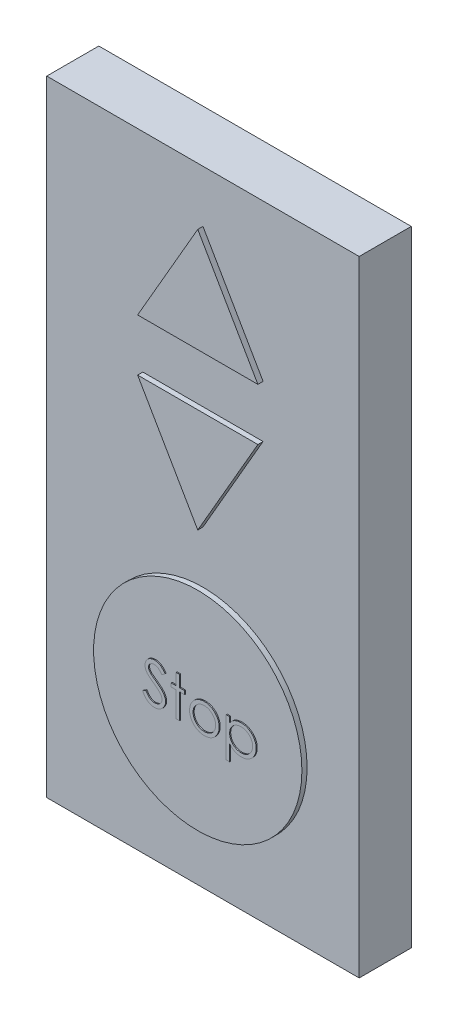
ISO-10303-21;
HEADER;
FILE_DESCRIPTION(('STEP AP214'),'2;1');
FILE_NAME('part.step','',(''),(''),'','','');
FILE_SCHEMA(('AUTOMOTIVE_DESIGN { 1 0 10303 214 1 1 1 1 }'));
ENDSEC;
DATA;
#1=APPLICATION_CONTEXT('core data for automotive mechanical design processes');
#2=APPLICATION_PROTOCOL_DEFINITION('international standard','automotive_design',2000,#1);
#3=PRODUCT_CONTEXT('',#1,'mechanical');
#4=PRODUCT('Part','Part','',(#3));
#5=PRODUCT_RELATED_PRODUCT_CATEGORY('part','',(#4));
#6=PRODUCT_DEFINITION_FORMATION('','',#4);
#7=PRODUCT_DEFINITION_CONTEXT('part definition',#1,'design');
#8=PRODUCT_DEFINITION('design','',#6,#7);
#9=PRODUCT_DEFINITION_SHAPE('','',#8);
#10=(LENGTH_UNIT() NAMED_UNIT(*) SI_UNIT(.MILLI.,.METRE.));
#11=(NAMED_UNIT(*) PLANE_ANGLE_UNIT() SI_UNIT($,.RADIAN.));
#12=(NAMED_UNIT(*) SI_UNIT($,.STERADIAN.) SOLID_ANGLE_UNIT());
#13=UNCERTAINTY_MEASURE_WITH_UNIT(LENGTH_MEASURE(1.E-05),#10,'distance_accuracy_value','');
#14=(GEOMETRIC_REPRESENTATION_CONTEXT(3) GLOBAL_UNCERTAINTY_ASSIGNED_CONTEXT((#13)) GLOBAL_UNIT_ASSIGNED_CONTEXT((#10,
#11,#12)) REPRESENTATION_CONTEXT('',''));
#15=CARTESIAN_POINT('',(0.,0.,0.));
#16=DIRECTION('',(0.,0.,1.));
#17=DIRECTION('',(1.,0.,0.));
#18=AXIS2_PLACEMENT_3D('',#15,#16,#17);
#19=CARTESIAN_POINT('',(-3.77757103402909,-85.115409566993,13.97));
#20=DIRECTION('',(0.,0.,1.));
#21=DIRECTION('',(1.,0.,0.));
#22=AXIS2_PLACEMENT_3D('',#19,#20,#21);
#23=PLANE('',#22);
#24=DIRECTION('',(0.,1.,0.));
#25=VECTOR('',#24,1.);
#26=CARTESIAN_POINT('',(3.40141439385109,-91.8244213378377,13.97));
#27=LINE('',#26,#25);
#28=CARTESIAN_POINT('',(3.40141439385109,-91.8244213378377,13.97));
#29=VERTEX_POINT('',#28);
#30=CARTESIAN_POINT('',(3.40141439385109,-82.2994213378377,13.97));
#31=VERTEX_POINT('',#30);
#32=EDGE_CURVE('E443',#29,#31,#27,.T.);
#33=ORIENTED_EDGE('',*,*,#32,.T.);
#34=DIRECTION('',(1.,0.,0.));
#35=VECTOR('',#34,1.);
#36=CARTESIAN_POINT('',(3.40141439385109,-82.2994213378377,13.97));
#37=LINE('',#36,#35);
#38=CARTESIAN_POINT('',(4.25622208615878,-82.2994213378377,13.97));
#39=VERTEX_POINT('',#38);
#40=EDGE_CURVE('E518',#31,#39,#37,.T.);
#41=ORIENTED_EDGE('',*,*,#40,.T.);
#42=DIRECTION('',(0.,-1.,0.));
#43=VECTOR('',#42,1.);
#44=CARTESIAN_POINT('',(4.25622208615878,-82.2994213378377,13.97));
#45=LINE('',#44,#43);
#46=CARTESIAN_POINT('',(4.25622208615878,-83.5873570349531,13.97));
#47=VERTEX_POINT('',#46);
#48=EDGE_CURVE('E520',#39,#47,#45,.T.);
#49=ORIENTED_EDGE('',*,*,#48,.T.);
#50=CARTESIAN_POINT('',(4.25622208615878,-83.5873570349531,13.97));
#51=CARTESIAN_POINT('',(4.34700209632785,-83.4705050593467,13.97));
#52=CARTESIAN_POINT('',(4.52341487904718,-83.2434266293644,13.97));
#53=CARTESIAN_POINT('',(4.82746622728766,-82.9495392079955,13.97));
#54=CARTESIAN_POINT('',(5.14839561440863,-82.7016842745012,13.97));
#55=CARTESIAN_POINT('',(5.4944617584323,-82.5074218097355,13.97));
#56=CARTESIAN_POINT('',(5.86028622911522,-82.3609523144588,13.97));
#57=CARTESIAN_POINT('',(6.24436775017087,-82.2526953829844,13.97));
#58=CARTESIAN_POINT('',(6.64996610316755,-82.1889010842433,13.97));
#59=CARTESIAN_POINT('',(6.92727002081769,-82.1812221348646,13.97));
#60=CARTESIAN_POINT('',(7.06869203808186,-82.1773059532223,13.97));
#61=B_SPLINE_CURVE_WITH_KNOTS('',3,(#50,#51,#52,#53,#54,#55,#56,#57,#58,#59,#60),.UNSPECIFIED.,
.F.,.F.,(4,1,1,1,1,1,1,1,4),(0.,0.135359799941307,0.263044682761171,0.386061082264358,
0.505770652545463,0.625178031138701,0.746147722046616,0.870538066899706,1.),.UNSPECIFIED.);
#62=CARTESIAN_POINT('',(7.06869203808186,-82.1773059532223,13.97));
#63=VERTEX_POINT('',#62);
#64=EDGE_CURVE('E522',#47,#63,#61,.T.);
#65=ORIENTED_EDGE('',*,*,#64,.T.);
#66=CARTESIAN_POINT('',(7.06869203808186,-82.1773059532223,13.97));
#67=CARTESIAN_POINT('',(7.1922220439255,-82.1808796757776,13.97));
#68=CARTESIAN_POINT('',(7.43638558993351,-82.1879433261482,13.97));
#69=CARTESIAN_POINT('',(7.79578623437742,-82.2357671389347,13.97));
#70=CARTESIAN_POINT('',(8.14188495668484,-82.3177302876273,13.97));
#71=CARTESIAN_POINT('',(8.47272373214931,-82.435842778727,13.97));
#72=CARTESIAN_POINT('',(8.79184678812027,-82.5818623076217,13.97));
#73=CARTESIAN_POINT('',(9.09452978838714,-82.7661493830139,13.97));
#74=CARTESIAN_POINT('',(9.38548739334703,-82.9795262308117,13.97));
#75=CARTESIAN_POINT('',(9.65740216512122,-83.2250865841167,13.97));
#76=CARTESIAN_POINT('',(9.90864817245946,-83.4907749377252,13.97));
#77=CARTESIAN_POINT('',(10.1259438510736,-83.7765856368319,13.97));
#78=CARTESIAN_POINT('',(10.3133738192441,-84.073119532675,13.97));
#79=CARTESIAN_POINT('',(10.4648765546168,-84.3849737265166,13.97));
#80=CARTESIAN_POINT('',(10.5835535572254,-84.7096924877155,13.97));
#81=CARTESIAN_POINT('',(10.6679577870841,-85.0485877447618,13.97));
#82=CARTESIAN_POINT('',(10.7181889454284,-85.400402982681,13.97));
#83=CARTESIAN_POINT('',(10.7249284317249,-85.6396239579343,13.97));
#84=CARTESIAN_POINT('',(10.7283374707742,-85.76062927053,13.97));
#85=B_SPLINE_CURVE_WITH_KNOTS('',3,(#66,#67,#68,#69,#70,#71,#72,#73,#74,#75,#76,#77,#78,#79,#80,
#81,#82,#83,#84),.UNSPECIFIED.,.F.,.F.,(4,1,1,1,1,1,1,1,1,1,1,1,1,1,1,1,4),(0.,
0.0650810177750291,0.12863605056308,0.190652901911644,0.25212503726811,0.313446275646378,
0.375227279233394,0.438498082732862,0.503285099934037,0.56800968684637,0.630878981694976,
0.692153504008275,0.752552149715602,0.81319109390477,0.873985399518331,0.936257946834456,1.),.UNSPECIFIED.);
#86=CARTESIAN_POINT('',(10.7283374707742,-85.76062927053,13.97));
#87=VERTEX_POINT('',#86);
#88=EDGE_CURVE('E526',#63,#87,#85,.T.);
#89=ORIENTED_EDGE('',*,*,#88,.T.);
#90=CARTESIAN_POINT('',(10.7283374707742,-85.76062927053,13.97));
#91=CARTESIAN_POINT('',(10.725002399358,-85.8841884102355,13.97));
#92=CARTESIAN_POINT('',(10.7184251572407,-86.127864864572,13.97));
#93=CARTESIAN_POINT('',(10.6674119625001,-86.4856976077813,13.97));
#94=CARTESIAN_POINT('',(10.585886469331,-86.8299239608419,13.97));
#95=CARTESIAN_POINT('',(10.4687066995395,-87.1599713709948,13.97));
#96=CARTESIAN_POINT('',(10.3172823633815,-87.4756125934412,13.97));
#97=CARTESIAN_POINT('',(10.1330292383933,-87.7766199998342,13.97));
#98=CARTESIAN_POINT('',(9.91562392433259,-88.0628971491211,13.97));
#99=CARTESIAN_POINT('',(9.66715442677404,-88.3305575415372,13.97));
#100=CARTESIAN_POINT('',(9.39758893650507,-88.5771171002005,13.97));
#101=CARTESIAN_POINT('',(9.10945091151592,-88.7927578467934,13.97));
#102=CARTESIAN_POINT('',(8.80721197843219,-88.9738454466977,13.97));
#103=CARTESIAN_POINT('',(8.49241843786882,-89.1251105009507,13.97));
#104=CARTESIAN_POINT('',(8.16237545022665,-89.2391170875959,13.97));
#105=CARTESIAN_POINT('',(7.81862288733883,-89.3213526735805,13.97));
#106=CARTESIAN_POINT('',(7.46134790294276,-89.3720651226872,13.97));
#107=CARTESIAN_POINT('',(7.21832119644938,-89.3787384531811,13.97));
#108=CARTESIAN_POINT('',(7.09540477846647,-89.38211364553,13.97));
#109=B_SPLINE_CURVE_WITH_KNOTS('',3,(#90,#91,#92,#93,#94,#95,#96,#97,#98,#99,#100,#101,#102,
#103,#104,#105,#106,#107,#108),.UNSPECIFIED.,.F.,.F.,(4,1,1,1,1,1,1,1,1,1,1,1,1,1,1,1,4),(0.,
0.064921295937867,0.128034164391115,0.18957372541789,0.250579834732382,0.311733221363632,
0.373250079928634,0.435762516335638,0.500345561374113,0.56494936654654,0.627527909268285,
0.68915728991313,0.749865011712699,0.810760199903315,0.87229976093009,0.935412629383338,1.),.UNSPECIFIED.);
#110=CARTESIAN_POINT('',(7.09540477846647,-89.38211364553,13.97));
#111=VERTEX_POINT('',#110);
#112=EDGE_CURVE('E533',#87,#111,#109,.T.);
#113=ORIENTED_EDGE('',*,*,#112,.T.);
#114=CARTESIAN_POINT('',(7.09540477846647,-89.38211364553,13.97));
#115=CARTESIAN_POINT('',(6.95708117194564,-89.3785899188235,13.97));
#116=CARTESIAN_POINT('',(6.68385149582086,-89.3716295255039,13.97));
#117=CARTESIAN_POINT('',(6.28435212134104,-89.3010917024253,13.97));
#118=CARTESIAN_POINT('',(5.89987726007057,-89.1956718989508,13.97));
#119=CARTESIAN_POINT('',(5.53468651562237,-89.0413696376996,13.97));
#120=CARTESIAN_POINT('',(5.1858869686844,-88.8447314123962,13.97));
#121=CARTESIAN_POINT('',(4.85545164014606,-88.60494578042,13.97));
#122=CARTESIAN_POINT('',(4.54162533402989,-88.3225142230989,13.97));
#123=CARTESIAN_POINT('',(4.35273435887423,-88.1082512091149,13.97));
#124=CARTESIAN_POINT('',(4.25622208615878,-87.9987753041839,13.97));
#125=B_SPLINE_CURVE_WITH_KNOTS('',3,(#114,#115,#116,#117,#118,#119,#120,#121,#122,#123,#124),
.UNSPECIFIED.,.F.,.F.,(4,1,1,1,1,1,1,1,4),(0.,0.1268408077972,0.250547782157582,
0.371230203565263,0.492115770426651,0.613400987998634,0.737997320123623,0.866131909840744,1.),.UNSPECIFIED.);
#126=CARTESIAN_POINT('',(4.25622208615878,-87.9987753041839,13.97));
#127=VERTEX_POINT('',#126);
#128=EDGE_CURVE('E540',#111,#127,#125,.T.);
#129=ORIENTED_EDGE('',*,*,#128,.T.);
#130=DIRECTION('',(0.,-1.,0.));
#131=VECTOR('',#130,1.);
#132=CARTESIAN_POINT('',(4.25622208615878,-87.9987753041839,13.97));
#133=LINE('',#132,#131);
#134=CARTESIAN_POINT('',(4.25622208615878,-91.8244213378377,13.97));
#135=VERTEX_POINT('',#134);
#136=EDGE_CURVE('E55',#127,#135,#133,.T.);
#137=ORIENTED_EDGE('',*,*,#136,.T.);
#138=DIRECTION('',(-1.,0.,0.));
#139=VECTOR('',#138,1.);
#140=CARTESIAN_POINT('',(4.25622208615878,-91.8244213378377,13.97));
#141=LINE('',#140,#139);
#142=EDGE_CURVE('E50',#135,#29,#141,.T.);
#143=ORIENTED_EDGE('',*,*,#142,.T.);
#144=EDGE_LOOP('',(#33,#41,#49,#65,#89,#113,#129,#137,#143));
#145=FACE_BOUND('',#144,.T.);
#146=DIRECTION('',(0.,1.,0.));
#147=VECTOR('',#146,1.);
#148=CARTESIAN_POINT('',(-8.81012406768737,-82.2994213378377,13.97));
#149=LINE('',#148,#147);
#150=CARTESIAN_POINT('',(-8.81012406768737,-82.2994213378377,13.97));
#151=VERTEX_POINT('',#150);
#152=CARTESIAN_POINT('',(-8.81012406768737,-79.4907674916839,13.97));
#153=VERTEX_POINT('',#152);
#154=EDGE_CURVE('E677',#151,#153,#149,.T.);
#155=ORIENTED_EDGE('',*,*,#154,.T.);
#156=DIRECTION('',(1.,0.,0.));
#157=VECTOR('',#156,1.);
#158=CARTESIAN_POINT('',(-8.81012406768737,-79.4907674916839,13.97));
#159=LINE('',#158,#157);
#160=CARTESIAN_POINT('',(-7.95531637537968,-79.4907674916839,13.97));
#161=VERTEX_POINT('',#160);
#162=EDGE_CURVE('E731',#153,#161,#159,.T.);
#163=ORIENTED_EDGE('',*,*,#162,.T.);
#164=DIRECTION('',(0.,-1.,0.));
#165=VECTOR('',#164,1.);
#166=CARTESIAN_POINT('',(-7.95531637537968,-79.4907674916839,13.97));
#167=LINE('',#166,#165);
#168=CARTESIAN_POINT('',(-7.95531637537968,-82.2994213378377,13.97));
#169=VERTEX_POINT('',#168);
#170=EDGE_CURVE('E733',#161,#169,#167,.T.);
#171=ORIENTED_EDGE('',*,*,#170,.T.);
#172=DIRECTION('',(1.,0.,0.));
#173=VECTOR('',#172,1.);
#174=CARTESIAN_POINT('',(-7.95531637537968,-82.2994213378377,13.97));
#175=LINE('',#174,#173);
#176=CARTESIAN_POINT('',(-6.73416252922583,-82.2994213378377,13.97));
#177=VERTEX_POINT('',#176);
#178=EDGE_CURVE('E735',#169,#177,#175,.T.);
#179=ORIENTED_EDGE('',*,*,#178,.T.);
#180=DIRECTION('',(0.,-1.,0.));
#181=VECTOR('',#180,1.);
#182=CARTESIAN_POINT('',(-6.73416252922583,-82.2994213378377,13.97));
#183=LINE('',#182,#181);
#184=CARTESIAN_POINT('',(-6.73416252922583,-83.1542290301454,13.97));
#185=VERTEX_POINT('',#184);
#186=EDGE_CURVE('E737',#177,#185,#183,.T.);
#187=ORIENTED_EDGE('',*,*,#186,.T.);
#188=DIRECTION('',(-1.,0.,0.));
#189=VECTOR('',#188,1.);
#190=CARTESIAN_POINT('',(-6.73416252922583,-83.1542290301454,13.97));
#191=LINE('',#190,#189);
#192=CARTESIAN_POINT('',(-7.95531637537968,-83.1542290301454,13.97));
#193=VERTEX_POINT('',#192);
#194=EDGE_CURVE('E739',#185,#193,#191,.T.);
#195=ORIENTED_EDGE('',*,*,#194,.T.);
#196=DIRECTION('',(0.,-1.,0.));
#197=VECTOR('',#196,1.);
#198=CARTESIAN_POINT('',(-7.95531637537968,-83.1542290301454,13.97));
#199=LINE('',#198,#197);
#200=CARTESIAN_POINT('',(-7.95531637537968,-89.2599982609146,13.97));
#201=VERTEX_POINT('',#200);
#202=EDGE_CURVE('E741',#193,#201,#199,.T.);
#203=ORIENTED_EDGE('',*,*,#202,.T.);
#204=DIRECTION('',(-1.,0.,0.));
#205=VECTOR('',#204,1.);
#206=CARTESIAN_POINT('',(-7.95531637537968,-89.2599982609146,13.97));
#207=LINE('',#206,#205);
#208=CARTESIAN_POINT('',(-8.81012406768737,-89.2599982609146,13.97));
#209=VERTEX_POINT('',#208);
#210=EDGE_CURVE('E743',#201,#209,#207,.T.);
#211=ORIENTED_EDGE('',*,*,#210,.T.);
#212=DIRECTION('',(0.,1.,0.));
#213=VECTOR('',#212,1.);
#214=CARTESIAN_POINT('',(-8.81012406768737,-89.2599982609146,13.97));
#215=LINE('',#214,#213);
#216=CARTESIAN_POINT('',(-8.81012406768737,-83.1542290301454,13.97));
#217=VERTEX_POINT('',#216);
#218=EDGE_CURVE('E745',#209,#217,#215,.T.);
#219=ORIENTED_EDGE('',*,*,#218,.T.);
#220=DIRECTION('',(-1.,0.,0.));
#221=VECTOR('',#220,1.);
#222=CARTESIAN_POINT('',(-8.81012406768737,-83.1542290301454,13.97));
#223=LINE('',#222,#221);
#224=CARTESIAN_POINT('',(-10.0312779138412,-83.1542290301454,13.97));
#225=VERTEX_POINT('',#224);
#226=EDGE_CURVE('E747',#217,#225,#223,.T.);
#227=ORIENTED_EDGE('',*,*,#226,.T.);
#228=DIRECTION('',(0.,1.,0.));
#229=VECTOR('',#228,1.);
#230=CARTESIAN_POINT('',(-10.0312779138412,-83.1542290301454,13.97));
#231=LINE('',#230,#229);
#232=CARTESIAN_POINT('',(-10.0312779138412,-82.2994213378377,13.97));
#233=VERTEX_POINT('',#232);
#234=EDGE_CURVE('E749',#225,#233,#231,.T.);
#235=ORIENTED_EDGE('',*,*,#234,.T.);
#236=DIRECTION('',(1.,0.,0.));
#237=VECTOR('',#236,1.);
#238=CARTESIAN_POINT('',(-10.0312779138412,-82.2994213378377,13.97));
#239=LINE('',#238,#237);
#240=EDGE_CURVE('E696',#233,#151,#239,.T.);
#241=ORIENTED_EDGE('',*,*,#240,.T.);
#242=EDGE_LOOP('',(#155,#163,#171,#179,#187,#195,#203,#211,#219,#227,#235,#241));
#243=FACE_BOUND('',#242,.T.);
#244=CARTESIAN_POINT('',(-14.095430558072,-89.5042290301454,13.97));
#245=CARTESIAN_POINT('',(-14.1673724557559,-89.502837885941,13.97));
#246=CARTESIAN_POINT('',(-14.3103502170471,-89.5000731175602,13.97));
#247=CARTESIAN_POINT('',(-14.5218310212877,-89.4756312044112,13.97));
#248=CARTESIAN_POINT('',(-14.7290394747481,-89.4410497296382,13.97));
#249=CARTESIAN_POINT('',(-14.929375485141,-89.3861474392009,13.97));
#250=CARTESIAN_POINT('',(-15.1254201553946,-89.3195350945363,13.97));
#251=CARTESIAN_POINT('',(-15.3163208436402,-89.2375157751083,13.97));
#252=CARTESIAN_POINT('',(-15.5021700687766,-89.1392253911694,13.97));
#253=CARTESIAN_POINT('',(-15.6840093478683,-89.0268439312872,13.97));
#254=CARTESIAN_POINT('',(-15.8613762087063,-88.8960582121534,13.97));
#255=CARTESIAN_POINT('',(-16.032607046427,-88.7437303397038,13.97));
#256=CARTESIAN_POINT('',(-16.2033200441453,-88.5740615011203,13.97));
#257=CARTESIAN_POINT('',(-16.3684764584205,-88.3824441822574,13.97));
#258=CARTESIAN_POINT('',(-16.5314169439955,-88.1719741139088,13.97));
#259=CARTESIAN_POINT('',(-16.688928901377,-87.9406821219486,13.97));
#260=CARTESIAN_POINT('',(-16.8442727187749,-87.6898280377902,13.97));
#261=CARTESIAN_POINT('',(-16.9417419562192,-87.5133023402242,13.97));
#262=CARTESIAN_POINT('',(-16.9918548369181,-87.42254333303,13.97));
#263=B_SPLINE_CURVE_WITH_KNOTS('',3,(#244,#245,#246,#247,#248,#249,#250,#251,#252,#253,#254,
#255,#256,#257,#258,#259,#260,#261,#262),.UNSPECIFIED.,.F.,.F.,(4,1,1,1,1,1,1,1,1,1,1,1,1,1,1,1,
4),(0.,0.0572082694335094,0.113696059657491,0.169177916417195,0.224159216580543,
0.278719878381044,0.33379421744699,0.389241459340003,0.445822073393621,0.50370428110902,
0.564293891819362,0.627975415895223,0.69503825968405,0.765372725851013,0.839611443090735,
0.917537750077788,1.),.UNSPECIFIED.);
#264=CARTESIAN_POINT('',(-14.095430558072,-89.5042290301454,13.97));
#265=VERTEX_POINT('',#264);
#266=CARTESIAN_POINT('',(-16.9918548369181,-87.42254333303,13.97));
#267=VERTEX_POINT('',#266);
#268=EDGE_CURVE('E755',#265,#267,#263,.T.);
#269=ORIENTED_EDGE('',*,*,#268,.T.);
#270=DIRECTION('',(0.857672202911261,0.514196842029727,0.));
#271=VECTOR('',#270,1.);
#272=CARTESIAN_POINT('',(-16.9918548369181,-87.42254333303,13.97));
#273=LINE('',#272,#271);
#274=CARTESIAN_POINT('',(-16.1866565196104,-86.9398059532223,13.97));
#275=VERTEX_POINT('',#274);
#276=EDGE_CURVE('E1107',#267,#275,#273,.T.);
#277=ORIENTED_EDGE('',*,*,#276,.T.);
#278=CARTESIAN_POINT('',(-16.1866565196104,-86.9398059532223,13.97));
#279=CARTESIAN_POINT('',(-16.1117676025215,-87.0651668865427,13.97));
#280=CARTESIAN_POINT('',(-15.9682833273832,-87.3053535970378,13.97));
#281=CARTESIAN_POINT('',(-15.7289299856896,-87.6299058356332,13.97));
#282=CARTESIAN_POINT('',(-15.4809182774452,-87.9057557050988,13.97));
#283=CARTESIAN_POINT('',(-15.2224115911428,-88.1312984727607,13.97));
#284=CARTESIAN_POINT('',(-14.9549878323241,-88.3088686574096,13.97));
#285=CARTESIAN_POINT('',(-14.6769012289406,-88.4346047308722,13.97));
#286=CARTESIAN_POINT('',(-14.3890889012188,-88.5130253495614,13.97));
#287=CARTESIAN_POINT('',(-14.1932172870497,-88.5225505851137,13.97));
#288=CARTESIAN_POINT('',(-14.095430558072,-88.5273059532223,13.97));
#289=B_SPLINE_CURVE_WITH_KNOTS('',3,(#278,#279,#280,#281,#282,#283,#284,#285,#286,#287,#288),
.UNSPECIFIED.,.F.,.F.,(4,1,1,1,1,1,1,1,4),(0.,0.159004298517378,0.304646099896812,
0.43854690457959,0.562322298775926,0.67743254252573,0.786897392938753,0.893610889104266,1.),.UNSPECIFIED.);
#290=CARTESIAN_POINT('',(-14.095430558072,-88.5273059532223,13.97));
#291=VERTEX_POINT('',#290);
#292=EDGE_CURVE('E1112',#275,#291,#289,.T.);
#293=ORIENTED_EDGE('',*,*,#292,.T.);
#294=CARTESIAN_POINT('',(-14.095430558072,-88.5273059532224,13.97));
#295=CARTESIAN_POINT('',(-14.0119184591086,-88.5249800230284,13.97));
#296=CARTESIAN_POINT('',(-13.8463555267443,-88.5203688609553,13.97));
#297=CARTESIAN_POINT('',(-13.6026182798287,-88.4760618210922,13.97));
#298=CARTESIAN_POINT('',(-13.3659035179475,-88.4079930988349,13.97));
#299=CARTESIAN_POINT('',(-13.1410900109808,-88.3105089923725,13.97));
#300=CARTESIAN_POINT('',(-12.9312798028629,-88.1925663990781,13.97));
#301=CARTESIAN_POINT('',(-12.7472930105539,-88.0501100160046,13.97));
#302=CARTESIAN_POINT('',(-12.5882360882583,-87.8906174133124,13.97));
#303=CARTESIAN_POINT('',(-12.4581269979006,-87.712683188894,13.97));
#304=CARTESIAN_POINT('',(-12.3583049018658,-87.5213200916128,13.97));
#305=CARTESIAN_POINT('',(-12.2815822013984,-87.3248983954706,13.97));
#306=CARTESIAN_POINT('',(-12.2390052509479,-87.1203325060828,13.97));
#307=CARTESIAN_POINT('',(-12.232591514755,-86.9825997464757,13.97));
#308=CARTESIAN_POINT('',(-12.2293548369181,-86.9130932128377,13.97));
#309=B_SPLINE_CURVE_WITH_KNOTS('',3,(#294,#295,#296,#297,#298,#299,#300,#301,#302,#303,#304,
#305,#306,#307,#308),.UNSPECIFIED.,.F.,.F.,(4,1,1,1,1,1,1,1,1,1,1,1,4),(0.,0.0912636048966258,
0.180930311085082,0.270088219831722,0.360156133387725,0.448342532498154,0.532665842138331,
0.613833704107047,0.693981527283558,0.772715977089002,0.849335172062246,0.923967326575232,1.),.UNSPECIFIED.);
#310=CARTESIAN_POINT('',(-12.2293548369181,-86.9130932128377,13.97));
#311=VERTEX_POINT('',#310);
#312=EDGE_CURVE('E1116',#291,#311,#309,.T.);
#313=ORIENTED_EDGE('',*,*,#312,.T.);
#314=CARTESIAN_POINT('',(-12.2293548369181,-86.9130932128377,13.97));
#315=CARTESIAN_POINT('',(-12.2333670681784,-86.8337884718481,13.97));
#316=CARTESIAN_POINT('',(-12.2415233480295,-86.6725735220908,13.97));
#317=CARTESIAN_POINT('',(-12.3104611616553,-86.434721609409,13.97));
#318=CARTESIAN_POINT('',(-12.4189080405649,-86.1993382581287,13.97));
#319=CARTESIAN_POINT('',(-12.5189549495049,-86.0537383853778,13.97));
#320=CARTESIAN_POINT('',(-12.5708963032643,-85.9781472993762,13.97));
#321=B_SPLINE_CURVE_WITH_KNOTS('',3,(#314,#315,#316,#317,#318,#319,#320),.UNSPECIFIED.,.F.,.F.,
(4,1,1,1,4),(0.,0.234723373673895,0.477158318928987,0.728556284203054,1.),.UNSPECIFIED.);
#322=CARTESIAN_POINT('',(-12.5708963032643,-85.9781472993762,13.97));
#323=VERTEX_POINT('',#322);
#324=EDGE_CURVE('E1123',#311,#323,#321,.T.);
#325=ORIENTED_EDGE('',*,*,#324,.T.);
#326=CARTESIAN_POINT('',(-12.5708963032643,-85.9781472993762,13.97));
#327=CARTESIAN_POINT('',(-12.6135427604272,-85.9235913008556,13.97));
#328=CARTESIAN_POINT('',(-12.7030736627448,-85.8090578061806,13.97));
#329=CARTESIAN_POINT('',(-12.8569908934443,-85.6385732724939,13.97));
#330=CARTESIAN_POINT('',(-13.0376015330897,-85.4627188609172,13.97));
#331=CARTESIAN_POINT('',(-13.2387247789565,-85.2747795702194,13.97));
#332=CARTESIAN_POINT('',(-13.4676869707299,-85.0834963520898,13.97));
#333=CARTESIAN_POINT('',(-13.7173168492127,-84.8797476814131,13.97));
#334=CARTESIAN_POINT('',(-13.9939877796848,-84.6712819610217,13.97));
#335=CARTESIAN_POINT('',(-14.1880242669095,-84.5314751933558,13.97));
#336=CARTESIAN_POINT('',(-14.2881438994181,-84.4593372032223,13.97));
#337=B_SPLINE_CURVE_WITH_KNOTS('',3,(#326,#327,#328,#329,#330,#331,#332,#333,#334,#335,#336),
.UNSPECIFIED.,.F.,.F.,(4,1,1,1,1,1,1,1,4),(0.,0.0902792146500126,0.189529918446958,
0.299197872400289,0.418925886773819,0.548376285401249,0.68813636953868,0.839083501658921,1.),.UNSPECIFIED.);
#338=CARTESIAN_POINT('',(-14.2881438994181,-84.4593372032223,13.97));
#339=VERTEX_POINT('',#338);
#340=EDGE_CURVE('E1130',#323,#339,#337,.T.);
#341=ORIENTED_EDGE('',*,*,#340,.T.);
#342=CARTESIAN_POINT('',(-14.2881438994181,-84.4593372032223,13.97));
#343=CARTESIAN_POINT('',(-14.388357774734,-84.3879579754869,13.97));
#344=CARTESIAN_POINT('',(-14.5799590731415,-84.2514863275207,13.97));
#345=CARTESIAN_POINT('',(-14.8479070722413,-84.0489459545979,13.97));
#346=CARTESIAN_POINT('',(-15.0875137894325,-83.863769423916,13.97));
#347=CARTESIAN_POINT('',(-15.2977142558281,-83.6942135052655,13.97));
#348=CARTESIAN_POINT('',(-15.4784160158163,-83.5402552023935,13.97));
#349=CARTESIAN_POINT('',(-15.6310430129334,-83.403372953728,13.97));
#350=CARTESIAN_POINT('',(-15.7517072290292,-83.2798648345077,13.97));
#351=CARTESIAN_POINT('',(-15.8188056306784,-83.1997423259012,13.97));
#352=CARTESIAN_POINT('',(-15.8489311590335,-83.1637692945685,13.97));
#353=B_SPLINE_CURVE_WITH_KNOTS('',3,(#342,#343,#344,#345,#346,#347,#348,#349,#350,#351,#352),
.UNSPECIFIED.,.F.,.F.,(4,1,1,1,1,1,1,1,4),(0.,0.181535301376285,0.347081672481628,
0.495567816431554,0.628357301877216,0.745519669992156,0.845830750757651,0.930781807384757,1.),.UNSPECIFIED.);
#354=CARTESIAN_POINT('',(-15.8489311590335,-83.1637692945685,13.97));
#355=VERTEX_POINT('',#354);
#356=EDGE_CURVE('E1137',#339,#355,#353,.T.);
#357=ORIENTED_EDGE('',*,*,#356,.T.);
#358=CARTESIAN_POINT('',(-15.8489311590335,-83.1637692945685,13.97));
#359=CARTESIAN_POINT('',(-15.8910385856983,-83.1077050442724,13.97));
#360=CARTESIAN_POINT('',(-15.9738484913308,-82.9974471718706,13.97));
#361=CARTESIAN_POINT('',(-16.0831574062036,-82.8251130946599,13.97));
#362=CARTESIAN_POINT('',(-16.1760646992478,-82.6487012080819,13.97));
#363=CARTESIAN_POINT('',(-16.2488964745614,-82.467737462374,13.97));
#364=CARTESIAN_POINT('',(-16.3102271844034,-82.2847624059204,13.97));
#365=CARTESIAN_POINT('',(-16.3514784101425,-82.0973886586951,13.97));
#366=CARTESIAN_POINT('',(-16.3773085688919,-81.9064569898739,13.97));
#367=CARTESIAN_POINT('',(-16.3799537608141,-81.7779688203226,13.97));
#368=CARTESIAN_POINT('',(-16.3812779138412,-81.7136491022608,13.97));
#369=B_SPLINE_CURVE_WITH_KNOTS('',3,(#358,#359,#360,#361,#362,#363,#364,#365,#366,#367,#368),
.UNSPECIFIED.,.F.,.F.,(4,1,1,1,1,1,1,1,4),(0.,0.13350676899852,0.26255897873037,
0.388264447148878,0.512667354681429,0.633722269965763,0.755393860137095,0.877552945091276,1.),.UNSPECIFIED.);
#370=CARTESIAN_POINT('',(-16.3812779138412,-81.7136491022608,13.97));
#371=VERTEX_POINT('',#370);
#372=EDGE_CURVE('E1144',#355,#371,#369,.T.);
#373=ORIENTED_EDGE('',*,*,#372,.T.);
#374=CARTESIAN_POINT('',(-16.3812779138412,-81.7136491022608,13.97));
#375=CARTESIAN_POINT('',(-16.377725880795,-81.6128752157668,13.97));
#376=CARTESIAN_POINT('',(-16.3706977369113,-81.4134814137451,13.97));
#377=CARTESIAN_POINT('',(-16.3112603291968,-81.1222046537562,13.97));
#378=CARTESIAN_POINT('',(-16.2174448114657,-80.8441116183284,13.97));
#379=CARTESIAN_POINT('',(-16.0860137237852,-80.5819554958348,13.97));
#380=CARTESIAN_POINT('',(-15.916584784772,-80.3425623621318,13.97));
#381=CARTESIAN_POINT('',(-15.7205168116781,-80.1231785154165,13.97));
#382=CARTESIAN_POINT('',(-15.4869869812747,-79.9387511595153,13.97));
#383=CARTESIAN_POINT('',(-15.2307573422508,-79.7776097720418,13.97));
#384=CARTESIAN_POINT('',(-14.9502967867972,-79.651482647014,13.97));
#385=CARTESIAN_POINT('',(-14.6564072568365,-79.5563388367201,13.97));
#386=CARTESIAN_POINT('',(-14.3486216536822,-79.5024293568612,13.97));
#387=CARTESIAN_POINT('',(-14.140151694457,-79.494692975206,13.97));
#388=CARTESIAN_POINT('',(-14.0343728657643,-79.4907674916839,13.97));
#389=B_SPLINE_CURVE_WITH_KNOTS('',3,(#374,#375,#376,#377,#378,#379,#380,#381,#382,#383,#384,
#385,#386,#387,#388),.UNSPECIFIED.,.F.,.F.,(4,1,1,1,1,1,1,1,1,1,1,1,4),(0.,0.08378537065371,
0.165779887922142,0.246280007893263,0.32746092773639,0.408796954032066,0.489715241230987,
0.571376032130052,0.655523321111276,0.741019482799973,0.826546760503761,0.911988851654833,1.),.UNSPECIFIED.);
#390=CARTESIAN_POINT('',(-14.0343728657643,-79.4907674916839,13.97));
#391=VERTEX_POINT('',#390);
#392=EDGE_CURVE('E1151',#371,#391,#389,.T.);
#393=ORIENTED_EDGE('',*,*,#392,.T.);
#394=CARTESIAN_POINT('',(-14.0343728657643,-79.4907674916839,13.97));
#395=CARTESIAN_POINT('',(-13.9221299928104,-79.4946388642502,13.97));
#396=CARTESIAN_POINT('',(-13.6989147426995,-79.5023377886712,13.97));
#397=CARTESIAN_POINT('',(-13.3705765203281,-79.5692782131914,13.97));
#398=CARTESIAN_POINT('',(-13.0544534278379,-79.6800421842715,13.97));
#399=CARTESIAN_POINT('',(-12.8001542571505,-79.8057413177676,13.97));
#400=CARTESIAN_POINT('',(-12.6011286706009,-79.9312846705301,13.97));
#401=CARTESIAN_POINT('',(-12.4493471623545,-80.045638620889,13.97));
#402=CARTESIAN_POINT('',(-12.2955389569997,-80.1772880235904,13.97));
#403=CARTESIAN_POINT('',(-12.1384633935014,-80.3265835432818,13.97));
#404=CARTESIAN_POINT('',(-11.9807820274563,-80.4948950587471,13.97));
#405=CARTESIAN_POINT('',(-11.8201539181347,-80.6810698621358,13.97));
#406=CARTESIAN_POINT('',(-11.6562034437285,-80.8839702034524,13.97));
#407=CARTESIAN_POINT('',(-11.550732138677,-81.0288168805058,13.97));
#408=CARTESIAN_POINT('',(-11.4966625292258,-81.1030721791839,13.97));
#409=B_SPLINE_CURVE_WITH_KNOTS('',3,(#394,#395,#396,#397,#398,#399,#400,#401,#402,#403,#404,
#405,#406,#407,#408),.UNSPECIFIED.,.F.,.F.,(4,1,1,1,1,1,1,1,1,1,1,1,4),(0.,0.107232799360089,
0.213251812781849,0.318830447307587,0.426793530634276,0.483645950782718,0.543603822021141,
0.608307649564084,0.677126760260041,0.750685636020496,0.828713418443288,0.912190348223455,1.),.UNSPECIFIED.);
#410=CARTESIAN_POINT('',(-11.4966625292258,-81.1030721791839,13.97));
#411=VERTEX_POINT('',#410);
#412=EDGE_CURVE('E1158',#391,#411,#409,.T.);
#413=ORIENTED_EDGE('',*,*,#412,.T.);
#414=DIRECTION('',(-0.796919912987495,-0.604084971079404,0.));
#415=VECTOR('',#414,1.);
#416=CARTESIAN_POINT('',(-11.4966625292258,-81.1030721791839,13.97));
#417=LINE('',#416,#415);
#418=CARTESIAN_POINT('',(-12.2694239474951,-81.6888444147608,13.97));
#419=VERTEX_POINT('',#418);
#420=EDGE_CURVE('E1165',#411,#419,#417,.T.);
#421=ORIENTED_EDGE('',*,*,#420,.T.);
#422=CARTESIAN_POINT('',(-12.2694239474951,-81.6888444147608,13.97));
#423=CARTESIAN_POINT('',(-12.316085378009,-81.6287316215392,13.97));
#424=CARTESIAN_POINT('',(-12.4059443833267,-81.5129684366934,13.97));
#425=CARTESIAN_POINT('',(-12.54236820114,-81.3508493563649,13.97));
#426=CARTESIAN_POINT('',(-12.6709520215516,-81.2027587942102,13.97));
#427=CARTESIAN_POINT('',(-12.7976356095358,-81.0741301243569,13.97));
#428=CARTESIAN_POINT('',(-12.9157282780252,-80.9579193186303,13.97));
#429=CARTESIAN_POINT('',(-13.0303468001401,-80.8584245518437,13.97));
#430=CARTESIAN_POINT('',(-13.1398417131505,-80.7746709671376,13.97));
#431=CARTESIAN_POINT('',(-13.2778641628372,-80.6852895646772,13.97));
#432=CARTESIAN_POINT('',(-13.4512673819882,-80.5966893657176,13.97));
#433=CARTESIAN_POINT('',(-13.6689395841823,-80.5217165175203,13.97));
#434=CARTESIAN_POINT('',(-13.8964136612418,-80.4766630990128,13.97));
#435=CARTESIAN_POINT('',(-14.0513435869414,-80.470706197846,13.97));
#436=CARTESIAN_POINT('',(-14.1297755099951,-80.467690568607,13.97));
#437=B_SPLINE_CURVE_WITH_KNOTS('',3,(#422,#423,#424,#425,#426,#427,#428,#429,#430,#431,#432,
#433,#434,#435,#436),.UNSPECIFIED.,.F.,.F.,(4,1,1,1,1,1,1,1,1,1,1,1,4),(0.,0.0984694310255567,
0.189629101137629,0.274184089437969,0.352183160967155,0.423198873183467,0.488550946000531,
0.548473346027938,0.601440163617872,0.701198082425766,0.799591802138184,0.898545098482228,1.),.UNSPECIFIED.);
#438=CARTESIAN_POINT('',(-14.1297755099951,-80.467690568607,13.97));
#439=VERTEX_POINT('',#438);
#440=EDGE_CURVE('E1170',#419,#439,#437,.T.);
#441=ORIENTED_EDGE('',*,*,#440,.T.);
#442=CARTESIAN_POINT('',(-14.1297755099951,-80.467690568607,13.97));
#443=CARTESIAN_POINT('',(-14.2281729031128,-80.470988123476,13.97));
#444=CARTESIAN_POINT('',(-14.4179230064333,-80.4773471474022,13.97));
#445=CARTESIAN_POINT('',(-14.6873178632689,-80.5467979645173,13.97));
#446=CARTESIAN_POINT('',(-14.9297806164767,-80.6561500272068,13.97));
#447=CARTESIAN_POINT('',(-15.1381129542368,-80.8094072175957,13.97));
#448=CARTESIAN_POINT('',(-15.3115685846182,-80.9909836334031,13.97));
#449=CARTESIAN_POINT('',(-15.4370412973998,-81.1999318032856,13.97));
#450=CARTESIAN_POINT('',(-15.5125613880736,-81.4306610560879,13.97));
#451=CARTESIAN_POINT('',(-15.5217769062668,-81.5916108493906,13.97));
#452=CARTESIAN_POINT('',(-15.5264702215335,-81.6735799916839,13.97));
#453=B_SPLINE_CURVE_WITH_KNOTS('',3,(#442,#443,#444,#445,#446,#447,#448,#449,#450,#451,#452),
.UNSPECIFIED.,.F.,.F.,(4,1,1,1,1,1,1,1,4),(0.,0.143073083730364,0.27590296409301,
0.402370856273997,0.528413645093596,0.650356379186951,0.765895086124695,0.880774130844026,1.),.UNSPECIFIED.);
#454=CARTESIAN_POINT('',(-15.5264702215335,-81.6735799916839,13.97));
#455=VERTEX_POINT('',#454);
#456=EDGE_CURVE('E1174',#439,#455,#453,.T.);
#457=ORIENTED_EDGE('',*,*,#456,.T.);
#458=CARTESIAN_POINT('',(-15.5264702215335,-81.6735799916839,13.97));
#459=CARTESIAN_POINT('',(-15.5254003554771,-81.7246108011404,13.97));
#460=CARTESIAN_POINT('',(-15.5232588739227,-81.8267558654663,13.97));
#461=CARTESIAN_POINT('',(-15.4933917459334,-81.9776629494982,13.97));
#462=CARTESIAN_POINT('',(-15.4550214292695,-82.128188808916,13.97));
#463=CARTESIAN_POINT('',(-15.3942175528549,-82.2776566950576,13.97));
#464=CARTESIAN_POINT('',(-15.3102742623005,-82.4286806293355,13.97));
#465=CARTESIAN_POINT('',(-15.2000423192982,-82.5838612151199,13.97));
#466=CARTESIAN_POINT('',(-15.0612132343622,-82.7445662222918,13.97));
#467=CARTESIAN_POINT('',(-14.954867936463,-82.8490891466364,13.97));
#468=CARTESIAN_POINT('',(-14.8987208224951,-82.9042741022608,13.97));
#469=B_SPLINE_CURVE_WITH_KNOTS('',3,(#458,#459,#460,#461,#462,#463,#464,#465,#466,#467,#468),
.UNSPECIFIED.,.F.,.F.,(4,1,1,1,1,1,1,1,4),(0.,0.107285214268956,0.214745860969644,
0.32293855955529,0.434116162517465,0.553412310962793,0.686072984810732,0.834255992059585,1.),.UNSPECIFIED.);
#470=CARTESIAN_POINT('',(-14.8987208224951,-82.9042741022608,13.97));
#471=VERTEX_POINT('',#470);
#472=EDGE_CURVE('E1181',#455,#471,#469,.T.);
#473=ORIENTED_EDGE('',*,*,#472,.T.);
#474=CARTESIAN_POINT('',(-14.8987208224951,-82.9042741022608,13.97));
#475=CARTESIAN_POINT('',(-14.8778709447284,-82.9228805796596,13.97));
#476=CARTESIAN_POINT('',(-14.8283364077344,-82.9670853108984,13.97));
#477=CARTESIAN_POINT('',(-14.7377783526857,-83.0394543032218,13.97));
#478=CARTESIAN_POINT('',(-14.6181911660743,-83.1287247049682,13.97));
#479=CARTESIAN_POINT('',(-14.4726976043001,-83.2391801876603,13.97));
#480=CARTESIAN_POINT('',(-14.2986149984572,-83.3673090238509,13.97));
#481=CARTESIAN_POINT('',(-14.0959242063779,-83.5114729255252,13.97));
#482=CARTESIAN_POINT('',(-13.8668846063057,-83.6763519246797,13.97));
#483=CARTESIAN_POINT('',(-13.7043556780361,-83.791624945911,13.97));
#484=CARTESIAN_POINT('',(-13.6184173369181,-83.8525763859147,13.97));
#485=B_SPLINE_CURVE_WITH_KNOTS('',3,(#474,#475,#476,#477,#478,#479,#480,#481,#482,#483,#484),
.UNSPECIFIED.,.F.,.F.,(4,1,1,1,1,1,1,1,4),(0.,0.0525942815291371,0.124951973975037,
0.218093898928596,0.333502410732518,0.468789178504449,0.624937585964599,0.801683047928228,1.),.UNSPECIFIED.);
#486=CARTESIAN_POINT('',(-13.6184173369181,-83.8525763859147,13.97));
#487=VERTEX_POINT('',#486);
#488=EDGE_CURVE('E1188',#471,#487,#485,.T.);
#489=ORIENTED_EDGE('',*,*,#488,.T.);
#490=CARTESIAN_POINT('',(-13.6184173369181,-83.8525763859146,13.97));
#491=CARTESIAN_POINT('',(-13.5150413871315,-83.9278003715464,13.97));
#492=CARTESIAN_POINT('',(-13.3148681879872,-84.0734611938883,13.97));
#493=CARTESIAN_POINT('',(-13.0300500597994,-84.2923067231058,13.97));
#494=CARTESIAN_POINT('',(-12.7718033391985,-84.506341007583,13.97));
#495=CARTESIAN_POINT('',(-12.5392213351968,-84.7141972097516,13.97));
#496=CARTESIAN_POINT('',(-12.3300063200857,-84.9142986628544,13.97));
#497=CARTESIAN_POINT('',(-12.1464793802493,-85.1090527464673,13.97));
#498=CARTESIAN_POINT('',(-11.9867704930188,-85.2970641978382,13.97));
#499=CARTESIAN_POINT('',(-11.8148327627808,-85.5381081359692,13.97));
#500=CARTESIAN_POINT('',(-11.6391432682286,-85.8341480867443,13.97));
#501=CARTESIAN_POINT('',(-11.4882631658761,-86.1968552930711,13.97));
#502=CARTESIAN_POINT('',(-11.3931265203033,-86.5609724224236,13.97));
#503=CARTESIAN_POINT('',(-11.3806854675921,-86.805701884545,13.97));
#504=CARTESIAN_POINT('',(-11.3745471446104,-86.92644958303,13.97));
#505=B_SPLINE_CURVE_WITH_KNOTS('',3,(#490,#491,#492,#493,#494,#495,#496,#497,#498,#499,#500,
#501,#502,#503,#504),.UNSPECIFIED.,.F.,.F.,(4,1,1,1,1,1,1,1,1,1,1,1,4),(0.,0.0969723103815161,
0.187773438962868,0.272396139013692,0.351320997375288,0.424334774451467,0.491908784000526,
0.5542332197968,0.611267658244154,0.716347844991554,0.814540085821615,0.908495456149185,1.),.UNSPECIFIED.);
#506=CARTESIAN_POINT('',(-11.3745471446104,-86.92644958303,13.97));
#507=VERTEX_POINT('',#506);
#508=EDGE_CURVE('E1195',#487,#507,#505,.T.);
#509=ORIENTED_EDGE('',*,*,#508,.T.);
#510=CARTESIAN_POINT('',(-11.3745471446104,-86.92644958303,13.97));
#511=CARTESIAN_POINT('',(-11.3763354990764,-87.0118435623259,13.97));
#512=CARTESIAN_POINT('',(-11.3798774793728,-87.1809732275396,13.97));
#513=CARTESIAN_POINT('',(-11.4205925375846,-87.4293174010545,13.97));
#514=CARTESIAN_POINT('',(-11.4802453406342,-87.670519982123,13.97));
#515=CARTESIAN_POINT('',(-11.5701538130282,-87.9015995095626,13.97));
#516=CARTESIAN_POINT('',(-11.6798904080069,-88.1267834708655,13.97));
#517=CARTESIAN_POINT('',(-11.8191356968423,-88.3401649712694,13.97));
#518=CARTESIAN_POINT('',(-11.9805373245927,-88.5464666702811,13.97));
#519=CARTESIAN_POINT('',(-12.1656863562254,-88.740187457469,13.97));
#520=CARTESIAN_POINT('',(-12.3682855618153,-88.9180224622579,13.97));
#521=CARTESIAN_POINT('',(-12.5824176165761,-89.0762165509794,13.97));
#522=CARTESIAN_POINT('',(-12.8084330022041,-89.2081196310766,13.97));
#523=CARTESIAN_POINT('',(-13.0451056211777,-89.3157544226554,13.97));
#524=CARTESIAN_POINT('',(-13.292489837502,-89.3999377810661,13.97));
#525=CARTESIAN_POINT('',(-13.550502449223,-89.4609328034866,13.97));
#526=CARTESIAN_POINT('',(-13.8195687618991,-89.4983679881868,13.97));
#527=CARTESIAN_POINT('',(-14.0024500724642,-89.5022535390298,13.97));
#528=CARTESIAN_POINT('',(-14.095430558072,-89.5042290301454,13.97));
#529=B_SPLINE_CURVE_WITH_KNOTS('',3,(#510,#511,#512,#513,#514,#515,#516,#517,#518,#519,#520,
#521,#522,#523,#524,#525,#526,#527,#528),.UNSPECIFIED.,.F.,.F.,(4,1,1,1,1,1,1,1,1,1,1,1,1,1,1,1,
4),(0.,0.0614842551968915,0.121774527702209,0.18091955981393,0.24025611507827,0.30011444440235,
0.361145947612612,0.423500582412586,0.48866936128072,0.553954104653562,0.617581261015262,
0.680238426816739,0.742187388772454,0.804663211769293,0.868258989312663,0.933020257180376,1.),.UNSPECIFIED.);
#530=EDGE_CURVE('E795',#507,#265,#529,.T.);
#531=ORIENTED_EDGE('',*,*,#530,.T.);
#532=EDGE_LOOP('',(#269,#277,#293,#313,#325,#341,#357,#373,#393,#413,#421,#441,#457,#473,#489,
#509,#531));
#533=FACE_BOUND('',#532,.T.);
#534=CARTESIAN_POINT('',(-3.77757103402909,-85.115409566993,13.97));
#535=DIRECTION('',(0.,0.,1.));
#536=DIRECTION('',(1.,0.,0.));
#537=AXIS2_PLACEMENT_3D('',#534,#535,#536);
#538=CIRCLE('',#537,25.4);
#539=CARTESIAN_POINT('',(21.6224289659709,-85.115409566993,13.97));
#540=VERTEX_POINT('',#539);
#541=EDGE_CURVE('E1262',#540,#540,#538,.T.);
#542=ORIENTED_EDGE('',*,*,#541,.T.);
#543=EDGE_LOOP('',(#542));
#544=FACE_BOUND('',#543,.T.);
#545=CARTESIAN_POINT('',(-4.55898224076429,-83.32976989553,13.97));
#546=CARTESIAN_POINT('',(-4.47067571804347,-83.237309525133,13.97));
#547=CARTESIAN_POINT('',(-4.29700540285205,-83.0554699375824,13.97));
#548=CARTESIAN_POINT('',(-4.00486350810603,-82.8226992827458,13.97));
#549=CARTESIAN_POINT('',(-3.69871960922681,-82.6215419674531,13.97));
#550=CARTESIAN_POINT('',(-3.37289677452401,-82.4596816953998,13.97));
#551=CARTESIAN_POINT('',(-3.03085985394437,-82.3322140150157,13.97));
#552=CARTESIAN_POINT('',(-2.67103462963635,-82.2435892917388,13.97));
#553=CARTESIAN_POINT('',(-2.29472769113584,-82.1857498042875,13.97));
#554=CARTESIAN_POINT('',(-2.03739043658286,-82.1801486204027,13.97));
#555=CARTESIAN_POINT('',(-1.90678873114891,-82.1773059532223,13.97));
#556=B_SPLINE_CURVE_WITH_KNOTS('',3,(#545,#546,#547,#548,#549,#550,#551,#552,#553,#554,#555),
.UNSPECIFIED.,.F.,.F.,(4,1,1,1,1,1,1,1,4),(0.,0.12849752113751,0.252712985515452,
0.374819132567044,0.496436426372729,0.617910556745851,0.741287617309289,0.868700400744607,1.),.UNSPECIFIED.);
#557=CARTESIAN_POINT('',(-4.55898224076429,-83.32976989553,13.97));
#558=VERTEX_POINT('',#557);
#559=CARTESIAN_POINT('',(-1.90678873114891,-82.1773059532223,13.97));
#560=VERTEX_POINT('',#559);
#561=EDGE_CURVE('E627',#558,#560,#556,.T.);
#562=ORIENTED_EDGE('',*,*,#561,.T.);
#563=CARTESIAN_POINT('',(-1.90678873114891,-82.1773059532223,13.97));
#564=CARTESIAN_POINT('',(-1.77618391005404,-82.1800869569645,13.97));
#565=CARTESIAN_POINT('',(-1.52009977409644,-82.1855398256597,13.97));
#566=CARTESIAN_POINT('',(-1.14506545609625,-82.2438191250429,13.97));
#567=CARTESIAN_POINT('',(-0.787074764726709,-82.332938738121,13.97));
#568=CARTESIAN_POINT('',(-0.444756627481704,-82.4561420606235,13.97));
#569=CARTESIAN_POINT('',(-0.12249513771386,-82.6212836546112,13.97));
#570=CARTESIAN_POINT('',(0.184403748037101,-82.8183403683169,13.97));
#571=CARTESIAN_POINT('',(0.475098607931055,-83.0517915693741,13.97));
#572=CARTESIAN_POINT('',(0.649332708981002,-83.2323803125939,13.97));
#573=CARTESIAN_POINT('',(0.737772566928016,-83.3240457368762,13.97));
#574=B_SPLINE_CURVE_WITH_KNOTS('',3,(#563,#564,#565,#566,#567,#568,#569,#570,#571,#572,#573),
.UNSPECIFIED.,.F.,.F.,(4,1,1,1,1,1,1,1,4),(0.,0.131751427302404,0.258332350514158,
0.382133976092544,0.503804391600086,0.624692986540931,0.746870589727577,0.871513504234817,1.),.UNSPECIFIED.);
#575=CARTESIAN_POINT('',(0.737772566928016,-83.3240457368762,13.97));
#576=VERTEX_POINT('',#575);
#577=EDGE_CURVE('E634',#560,#576,#574,.T.);
#578=ORIENTED_EDGE('',*,*,#577,.T.);
#579=CARTESIAN_POINT('',(0.737772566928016,-83.3240457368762,13.97));
#580=CARTESIAN_POINT('',(0.813923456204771,-83.4117137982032,13.97));
#581=CARTESIAN_POINT('',(0.964751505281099,-83.5853533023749,13.97));
#582=CARTESIAN_POINT('',(1.15815178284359,-83.8669003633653,13.97));
#583=CARTESIAN_POINT('',(1.32476188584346,-84.1584744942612,13.97));
#584=CARTESIAN_POINT('',(1.45828322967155,-84.4639475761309,13.97));
#585=CARTESIAN_POINT('',(1.56356175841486,-84.7806529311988,13.97));
#586=CARTESIAN_POINT('',(1.63830768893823,-85.1096791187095,13.97));
#587=CARTESIAN_POINT('',(1.68276749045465,-85.4502995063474,13.97));
#588=CARTESIAN_POINT('',(1.68876270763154,-85.6816313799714,13.97));
#589=CARTESIAN_POINT('',(1.69179900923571,-85.7987903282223,13.97));
#590=B_SPLINE_CURVE_WITH_KNOTS('',3,(#579,#580,#581,#582,#583,#584,#585,#586,#587,#588,#589),
.UNSPECIFIED.,.F.,.F.,(4,1,1,1,1,1,1,1,4),(0.,0.128157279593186,0.253834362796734,
0.376505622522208,0.498533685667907,0.621367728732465,0.744564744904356,0.870633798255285,1.),.UNSPECIFIED.);
#591=CARTESIAN_POINT('',(1.69179900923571,-85.7987903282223,13.97));
#592=VERTEX_POINT('',#591);
#593=EDGE_CURVE('E642',#576,#592,#590,.T.);
#594=ORIENTED_EDGE('',*,*,#593,.T.);
#595=CARTESIAN_POINT('',(1.69179900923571,-85.7987903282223,13.97));
#596=CARTESIAN_POINT('',(1.68912836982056,-85.916628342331,13.97));
#597=CARTESIAN_POINT('',(1.68385106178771,-86.1494817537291,13.97));
#598=CARTESIAN_POINT('',(1.63393022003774,-86.4924344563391,13.97));
#599=CARTESIAN_POINT('',(1.55628490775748,-86.8249789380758,13.97));
#600=CARTESIAN_POINT('',(1.44516397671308,-87.1457229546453,13.97));
#601=CARTESIAN_POINT('',(1.30267512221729,-87.4556469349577,13.97));
#602=CARTESIAN_POINT('',(1.12880117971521,-87.7533972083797,13.97));
#603=CARTESIAN_POINT('',(0.922321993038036,-88.0395612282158,13.97));
#604=CARTESIAN_POINT('',(0.688268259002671,-88.3117090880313,13.97));
#605=CARTESIAN_POINT('',(0.429591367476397,-88.5625328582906,13.97));
#606=CARTESIAN_POINT('',(0.148968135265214,-88.7811405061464,13.97));
#607=CARTESIAN_POINT('',(-0.148086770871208,-88.9684333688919,13.97));
#608=CARTESIAN_POINT('',(-0.465523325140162,-89.1192996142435,13.97));
#609=CARTESIAN_POINT('',(-0.800442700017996,-89.2382524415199,13.97));
#610=CARTESIAN_POINT('',(-1.15356729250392,-89.3218003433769,13.97));
#611=CARTESIAN_POINT('',(-1.52434851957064,-89.3723146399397,13.97));
#612=CARTESIAN_POINT('',(-1.77751545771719,-89.3788013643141,13.97));
#613=CARTESIAN_POINT('',(-1.90678873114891,-89.38211364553,13.97));
#614=B_SPLINE_CURVE_WITH_KNOTS('',3,(#595,#596,#597,#598,#599,#600,#601,#602,#603,#604,#605,
#606,#607,#608,#609,#610,#611,#612,#613),.UNSPECIFIED.,.F.,.F.,(4,1,1,1,1,1,1,1,1,1,1,1,1,1,1,1,
4),(0.,0.0624160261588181,0.123336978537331,0.183265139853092,0.243172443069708,
0.302898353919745,0.36377359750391,0.425605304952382,0.489659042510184,0.553784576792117,
0.616221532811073,0.677854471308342,0.739516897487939,0.802096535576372,0.865865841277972,
0.931507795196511,1.),.UNSPECIFIED.);
#615=CARTESIAN_POINT('',(-1.90678873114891,-89.38211364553,13.97));
#616=VERTEX_POINT('',#615);
#617=EDGE_CURVE('E649',#592,#616,#614,.T.);
#618=ORIENTED_EDGE('',*,*,#617,.T.);
#619=CARTESIAN_POINT('',(-1.90678873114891,-89.38211364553,13.97));
#620=CARTESIAN_POINT('',(-2.03669536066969,-89.3787902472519,13.97));
#621=CARTESIAN_POINT('',(-2.2911240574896,-89.3722812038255,13.97));
#622=CARTESIAN_POINT('',(-2.66321405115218,-89.3219965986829,13.97));
#623=CARTESIAN_POINT('',(-3.01697151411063,-89.2382909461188,13.97));
#624=CARTESIAN_POINT('',(-3.35232934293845,-89.1189086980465,13.97));
#625=CARTESIAN_POINT('',(-3.67113067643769,-88.9684285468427,13.97));
#626=CARTESIAN_POINT('',(-3.96990678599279,-88.7817067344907,13.97));
#627=CARTESIAN_POINT('',(-4.25075798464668,-88.5624680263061,13.97));
#628=CARTESIAN_POINT('',(-4.5094895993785,-88.3117266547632,13.97));
#629=CARTESIAN_POINT('',(-4.74352866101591,-88.0395567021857,13.97));
#630=CARTESIAN_POINT('',(-4.95001163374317,-87.7533983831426,13.97));
#631=CARTESIAN_POINT('',(-5.12388459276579,-87.4556466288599,13.97));
#632=CARTESIAN_POINT('',(-5.26637370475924,-87.1457230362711,13.97));
#633=CARTESIAN_POINT('',(-5.37749456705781,-86.8249789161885,13.97));
#634=CARTESIAN_POINT('',(-5.45513989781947,-86.4924344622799,13.97));
#635=CARTESIAN_POINT('',(-5.50506073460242,-86.1494817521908,13.97));
#636=CARTESIAN_POINT('',(-5.51033804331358,-85.9166283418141,13.97));
#637=CARTESIAN_POINT('',(-5.51300868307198,-85.7987903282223,13.97));
#638=B_SPLINE_CURVE_WITH_KNOTS('',3,(#619,#620,#621,#622,#623,#624,#625,#626,#627,#628,#629,
#630,#631,#632,#633,#634,#635,#636,#637),.UNSPECIFIED.,.F.,.F.,(4,1,1,1,1,1,1,1,1,1,1,1,1,1,1,1,
4),(0.,0.0687422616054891,0.134635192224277,0.198324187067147,0.260825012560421,
0.322713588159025,0.38455453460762,0.446912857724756,0.51095763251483,0.574930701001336,
0.636684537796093,0.697483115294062,0.757133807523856,0.816965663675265,0.876818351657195,
0.937662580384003,1.),.UNSPECIFIED.);
#639=CARTESIAN_POINT('',(-5.51300868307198,-85.7987903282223,13.97));
#640=VERTEX_POINT('',#639);
#641=EDGE_CURVE('E656',#616,#640,#638,.T.);
#642=ORIENTED_EDGE('',*,*,#641,.T.);
#643=CARTESIAN_POINT('',(-5.51300868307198,-85.7987903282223,13.97));
#644=CARTESIAN_POINT('',(-5.50995167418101,-85.6822681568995,13.97));
#645=CARTESIAN_POINT('',(-5.50389932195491,-85.4515742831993,13.97));
#646=CARTESIAN_POINT('',(-5.45948422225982,-85.1115942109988,13.97));
#647=CARTESIAN_POINT('',(-5.38502986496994,-84.7831248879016,13.97));
#648=CARTESIAN_POINT('',(-5.27962513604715,-84.4676419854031,13.97));
#649=CARTESIAN_POINT('',(-5.14487308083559,-84.1635075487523,13.97));
#650=CARTESIAN_POINT('',(-4.98060414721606,-83.8712129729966,13.97));
#651=CARTESIAN_POINT('',(-4.7852310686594,-83.5909390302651,13.97));
#652=CARTESIAN_POINT('',(-4.6350029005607,-83.4175239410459,13.97));
#653=CARTESIAN_POINT('',(-4.55898224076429,-83.32976989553,13.97));
#654=B_SPLINE_CURVE_WITH_KNOTS('',3,(#643,#644,#645,#646,#647,#648,#649,#650,#651,#652,#653),
.UNSPECIFIED.,.F.,.F.,(4,1,1,1,1,1,1,1,4),(0.,0.128919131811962,0.255237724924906,
0.378678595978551,0.50108788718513,0.622713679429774,0.746240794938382,0.87158904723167,1.),.UNSPECIFIED.);
#655=EDGE_CURVE('E663',#640,#558,#654,.T.);
#656=ORIENTED_EDGE('',*,*,#655,.T.);
#657=EDGE_LOOP('',(#562,#578,#594,#618,#642,#656));
#658=FACE_BOUND('',#657,.T.);
#659=ADVANCED_FACE('F35',(#145,#243,#533,#544,#658),#23,.T.);
#660=CARTESIAN_POINT('',(-41.8775710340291,-123.215409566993,12.7));
#661=DIRECTION('',(0.,0.,1.));
#662=DIRECTION('',(1.,0.,0.));
#663=AXIS2_PLACEMENT_3D('',#660,#661,#662);
#664=PLANE('',#663);
#665=DIRECTION('',(-0.500000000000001,0.866025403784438,0.));
#666=VECTOR('',#665,1.);
#667=CARTESIAN_POINT('',(81.1676037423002,-130.644768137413,12.7));
#668=LINE('',#667,#666);
#669=CARTESIAN_POINT('',(10.8871258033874,-8.91540956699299,12.7));
#670=VERTEX_POINT('',#669);
#671=CARTESIAN_POINT('',(-3.77757103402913,16.484590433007,12.7));
#672=VERTEX_POINT('',#671);
#673=EDGE_CURVE('E1303',#670,#672,#668,.T.);
#674=ORIENTED_EDGE('',*,*,#673,.F.);
#675=DIRECTION('',(1.,0.,0.));
#676=VECTOR('',#675,1.);
#677=CARTESIAN_POINT('',(-3.77757103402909,-8.91540956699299,12.7));
#678=LINE('',#677,#676);
#679=CARTESIAN_POINT('',(-18.4422678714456,-8.91540956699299,12.7));
#680=VERTEX_POINT('',#679);
#681=EDGE_CURVE('E1291',#680,#670,#678,.T.);
#682=ORIENTED_EDGE('',*,*,#681,.F.);
#683=DIRECTION('',(-0.5,-0.866025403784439,0.));
#684=VECTOR('',#683,1.);
#685=CARTESIAN_POINT('',(-88.7227458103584,-130.644768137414,12.7));
#686=LINE('',#685,#684);
#687=EDGE_CURVE('E1296',#672,#680,#686,.T.);
#688=ORIENTED_EDGE('',*,*,#687,.F.);
#689=EDGE_LOOP('',(#674,#682,#688));
#690=FACE_BOUND('',#689,.T.);
#691=DIRECTION('',(0.,-1.,0.));
#692=VECTOR('',#691,1.);
#693=CARTESIAN_POINT('',(-41.8775710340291,29.184590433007,12.7));
#694=LINE('',#693,#692);
#695=CARTESIAN_POINT('',(-41.8775710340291,29.184590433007,12.7));
#696=VERTEX_POINT('',#695);
#697=CARTESIAN_POINT('',(-41.8775710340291,-123.215409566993,12.7));
#698=VERTEX_POINT('',#697);
#699=EDGE_CURVE('E1314',#696,#698,#694,.T.);
#700=ORIENTED_EDGE('',*,*,#699,.T.);
#701=DIRECTION('',(1.,0.,0.));
#702=VECTOR('',#701,1.);
#703=CARTESIAN_POINT('',(-41.8775710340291,-123.215409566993,12.7));
#704=LINE('',#703,#702);
#705=CARTESIAN_POINT('',(34.3224289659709,-123.215409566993,12.7));
#706=VERTEX_POINT('',#705);
#707=EDGE_CURVE('E1317',#698,#706,#704,.T.);
#708=ORIENTED_EDGE('',*,*,#707,.T.);
#709=DIRECTION('',(0.,1.,0.));
#710=VECTOR('',#709,1.);
#711=CARTESIAN_POINT('',(34.3224289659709,29.184590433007,12.7));
#712=LINE('',#711,#710);
#713=CARTESIAN_POINT('',(34.3224289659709,29.184590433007,12.7));
#714=VERTEX_POINT('',#713);
#715=EDGE_CURVE('E1320',#706,#714,#712,.T.);
#716=ORIENTED_EDGE('',*,*,#715,.T.);
#717=DIRECTION('',(-1.,0.,0.));
#718=VECTOR('',#717,1.);
#719=CARTESIAN_POINT('',(-41.8775710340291,29.184590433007,12.7));
#720=LINE('',#719,#718);
#721=EDGE_CURVE('E1322',#714,#696,#720,.T.);
#722=ORIENTED_EDGE('',*,*,#721,.T.);
#723=EDGE_LOOP('',(#700,#708,#716,#722));
#724=FACE_BOUND('',#723,.T.);
#725=DIRECTION('',(1.,0.,0.));
#726=VECTOR('',#725,1.);
#727=CARTESIAN_POINT('',(-3.77757103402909,-21.615409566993,12.7));
#728=LINE('',#727,#726);
#729=CARTESIAN_POINT('',(-18.4422678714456,-21.615409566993,12.7));
#730=VERTEX_POINT('',#729);
#731=CARTESIAN_POINT('',(10.8871258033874,-21.615409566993,12.7));
#732=VERTEX_POINT('',#731);
#733=EDGE_CURVE('E1265',#730,#732,#728,.T.);
#734=ORIENTED_EDGE('',*,*,#733,.T.);
#735=DIRECTION('',(-0.500000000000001,-0.866025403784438,0.));
#736=VECTOR('',#735,1.);
#737=CARTESIAN_POINT('',(-61.2264392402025,-146.519768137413,12.7));
#738=LINE('',#737,#736);
#739=CARTESIAN_POINT('',(-3.77757103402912,-47.015409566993,12.7));
#740=VERTEX_POINT('',#739);
#741=EDGE_CURVE('E1272',#732,#740,#738,.T.);
#742=ORIENTED_EDGE('',*,*,#741,.T.);
#743=DIRECTION('',(-0.5,0.866025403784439,0.));
#744=VECTOR('',#743,1.);
#745=CARTESIAN_POINT('',(53.6712971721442,-146.519768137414,12.7));
#746=LINE('',#745,#744);
#747=EDGE_CURVE('E1280',#740,#730,#746,.T.);
#748=ORIENTED_EDGE('',*,*,#747,.T.);
#749=EDGE_LOOP('',(#734,#742,#748));
#750=FACE_BOUND('',#749,.T.);
#751=CARTESIAN_POINT('',(-3.77757103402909,-85.115409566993,12.7));
#752=DIRECTION('',(0.,0.,1.));
#753=DIRECTION('',(1.,0.,0.));
#754=AXIS2_PLACEMENT_3D('',#751,#752,#753);
#755=CIRCLE('',#754,25.4);
#756=CARTESIAN_POINT('',(21.6224289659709,-85.115409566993,12.7));
#757=VERTEX_POINT('',#756);
#758=EDGE_CURVE('E1214',#757,#757,#755,.T.);
#759=ORIENTED_EDGE('',*,*,#758,.F.);
#760=EDGE_LOOP('',(#759));
#761=FACE_BOUND('',#760,.T.);
#762=ADVANCED_FACE('F851',(#690,#724,#750,#761),#664,.T.);
#763=CARTESIAN_POINT('',(-41.8775710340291,29.184590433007,12.7));
#764=DIRECTION('',(1.,0.,0.));
#765=DIRECTION('',(0.,1.,0.));
#766=AXIS2_PLACEMENT_3D('',#763,#764,#765);
#767=PLANE('',#766);
#768=DIRECTION('',(0.,-1.,0.));
#769=VECTOR('',#768,1.);
#770=CARTESIAN_POINT('',(-41.8775710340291,29.184590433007,0.));
#771=LINE('',#770,#769);
#772=CARTESIAN_POINT('',(-41.8775710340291,29.184590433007,0.));
#773=VERTEX_POINT('',#772);
#774=CARTESIAN_POINT('',(-41.8775710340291,-123.215409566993,0.));
#775=VERTEX_POINT('',#774);
#776=EDGE_CURVE('E1313',#773,#775,#771,.T.);
#777=ORIENTED_EDGE('',*,*,#776,.T.);
#778=DIRECTION('',(0.,0.,-1.));
#779=VECTOR('',#778,1.);
#780=CARTESIAN_POINT('',(-41.8775710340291,-123.215409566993,12.7));
#781=LINE('',#780,#779);
#782=EDGE_CURVE('E11',#698,#775,#781,.T.);
#783=ORIENTED_EDGE('',*,*,#782,.F.);
#784=ORIENTED_EDGE('',*,*,#699,.F.);
#785=DIRECTION('',(0.,0.,-1.));
#786=VECTOR('',#785,1.);
#787=CARTESIAN_POINT('',(-41.8775710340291,29.184590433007,12.7));
#788=LINE('',#787,#786);
#789=EDGE_CURVE('E1324',#696,#773,#788,.T.);
#790=ORIENTED_EDGE('',*,*,#789,.T.);
#791=EDGE_LOOP('',(#777,#783,#784,#790));
#792=FACE_BOUND('',#791,.T.);
#793=ADVANCED_FACE('F37',(#792),#767,.F.);
#794=CARTESIAN_POINT('',(-41.8775710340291,-123.215409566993,12.7));
#795=DIRECTION('',(0.,1.,0.));
#796=DIRECTION('',(0.,0.,1.));
#797=AXIS2_PLACEMENT_3D('',#794,#795,#796);
#798=PLANE('',#797);
#799=DIRECTION('',(1.,0.,0.));
#800=VECTOR('',#799,1.);
#801=CARTESIAN_POINT('',(-41.8775710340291,-123.215409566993,0.));
#802=LINE('',#801,#800);
#803=CARTESIAN_POINT('',(34.3224289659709,-123.215409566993,0.));
#804=VERTEX_POINT('',#803);
#805=EDGE_CURVE('E1327',#775,#804,#802,.T.);
#806=ORIENTED_EDGE('',*,*,#805,.T.);
#807=DIRECTION('',(0.,0.,-1.));
#808=VECTOR('',#807,1.);
#809=CARTESIAN_POINT('',(34.3224289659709,-123.215409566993,12.7));
#810=LINE('',#809,#808);
#811=EDGE_CURVE('E43',#706,#804,#810,.T.);
#812=ORIENTED_EDGE('',*,*,#811,.F.);
#813=ORIENTED_EDGE('',*,*,#707,.F.);
#814=ORIENTED_EDGE('',*,*,#782,.T.);
#815=EDGE_LOOP('',(#806,#812,#813,#814));
#816=FACE_BOUND('',#815,.T.);
#817=ADVANCED_FACE('F864',(#816),#798,.F.);
#818=CARTESIAN_POINT('',(34.3224289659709,29.184590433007,12.7));
#819=DIRECTION('',(-1.,0.,0.));
#820=DIRECTION('',(0.,-1.,0.));
#821=AXIS2_PLACEMENT_3D('',#818,#819,#820);
#822=PLANE('',#821);
#823=DIRECTION('',(0.,1.,0.));
#824=VECTOR('',#823,1.);
#825=CARTESIAN_POINT('',(34.3224289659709,29.184590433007,0.));
#826=LINE('',#825,#824);
#827=CARTESIAN_POINT('',(34.3224289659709,29.184590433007,0.));
#828=VERTEX_POINT('',#827);
#829=EDGE_CURVE('E1329',#804,#828,#826,.T.);
#830=ORIENTED_EDGE('',*,*,#829,.T.);
#831=DIRECTION('',(0.,0.,-1.));
#832=VECTOR('',#831,1.);
#833=CARTESIAN_POINT('',(34.3224289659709,29.184590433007,12.7));
#834=LINE('',#833,#832);
#835=EDGE_CURVE('E1334',#714,#828,#834,.T.);
#836=ORIENTED_EDGE('',*,*,#835,.F.);
#837=ORIENTED_EDGE('',*,*,#715,.F.);
#838=ORIENTED_EDGE('',*,*,#811,.T.);
#839=EDGE_LOOP('',(#830,#836,#837,#838));
#840=FACE_BOUND('',#839,.T.);
#841=ADVANCED_FACE('F861',(#840),#822,.F.);
#842=CARTESIAN_POINT('',(-41.8775710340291,29.184590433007,12.7));
#843=DIRECTION('',(0.,-1.,0.));
#844=DIRECTION('',(0.,0.,-1.));
#845=AXIS2_PLACEMENT_3D('',#842,#843,#844);
#846=PLANE('',#845);
#847=DIRECTION('',(-1.,0.,0.));
#848=VECTOR('',#847,1.);
#849=CARTESIAN_POINT('',(-41.8775710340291,29.184590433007,0.));
#850=LINE('',#849,#848);
#851=EDGE_CURVE('E1318',#828,#773,#850,.T.);
#852=ORIENTED_EDGE('',*,*,#851,.T.);
#853=ORIENTED_EDGE('',*,*,#789,.F.);
#854=ORIENTED_EDGE('',*,*,#721,.F.);
#855=ORIENTED_EDGE('',*,*,#835,.T.);
#856=EDGE_LOOP('',(#852,#853,#854,#855));
#857=FACE_BOUND('',#856,.T.);
#858=ADVANCED_FACE('F857',(#857),#846,.F.);
#859=CARTESIAN_POINT('',(-41.8775710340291,-123.215409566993,0.));
#860=DIRECTION('',(0.,0.,1.));
#861=DIRECTION('',(1.,0.,0.));
#862=AXIS2_PLACEMENT_3D('',#859,#860,#861);
#863=PLANE('',#862);
#864=ORIENTED_EDGE('',*,*,#776,.F.);
#865=ORIENTED_EDGE('',*,*,#851,.F.);
#866=ORIENTED_EDGE('',*,*,#829,.F.);
#867=ORIENTED_EDGE('',*,*,#805,.F.);
#868=EDGE_LOOP('',(#864,#865,#866,#867));
#869=FACE_BOUND('',#868,.T.);
#870=ADVANCED_FACE('F849',(#869),#863,.F.);
#871=CARTESIAN_POINT('',(-3.77757103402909,-8.91540956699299,13.97));
#872=DIRECTION('',(0.,1.,0.));
#873=DIRECTION('',(0.,0.,1.));
#874=AXIS2_PLACEMENT_3D('',#871,#872,#873);
#875=PLANE('',#874);
#876=ORIENTED_EDGE('',*,*,#681,.T.);
#877=DIRECTION('',(0.,0.,-1.));
#878=VECTOR('',#877,1.);
#879=CARTESIAN_POINT('',(10.8871258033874,-8.91540956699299,13.97));
#880=LINE('',#879,#878);
#881=CARTESIAN_POINT('',(10.8871258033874,-8.91540956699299,13.97));
#882=VERTEX_POINT('',#881);
#883=EDGE_CURVE('E1311',#882,#670,#880,.T.);
#884=ORIENTED_EDGE('',*,*,#883,.F.);
#885=DIRECTION('',(1.,0.,0.));
#886=VECTOR('',#885,1.);
#887=CARTESIAN_POINT('',(-3.77757103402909,-8.91540956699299,13.97));
#888=LINE('',#887,#886);
#889=CARTESIAN_POINT('',(-18.4422678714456,-8.91540956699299,13.97));
#890=VERTEX_POINT('',#889);
#891=EDGE_CURVE('E1292',#890,#882,#888,.T.);
#892=ORIENTED_EDGE('',*,*,#891,.F.);
#893=DIRECTION('',(0.,0.,-1.));
#894=VECTOR('',#893,1.);
#895=CARTESIAN_POINT('',(-18.4422678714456,-8.91540956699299,13.97));
#896=LINE('',#895,#894);
#897=EDGE_CURVE('E1300',#890,#680,#896,.T.);
#898=ORIENTED_EDGE('',*,*,#897,.T.);
#899=EDGE_LOOP('',(#876,#884,#892,#898));
#900=FACE_BOUND('',#899,.T.);
#901=ADVANCED_FACE('F845',(#900),#875,.F.);
#902=CARTESIAN_POINT('',(81.1676037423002,-130.644768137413,13.97));
#903=DIRECTION('',(-0.866025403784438,-0.500000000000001,0.));
#904=DIRECTION('',(0.500000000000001,-0.866025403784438,0.));
#905=AXIS2_PLACEMENT_3D('',#902,#903,#904);
#906=PLANE('',#905);
#907=ORIENTED_EDGE('',*,*,#673,.T.);
#908=DIRECTION('',(0.,0.,-1.));
#909=VECTOR('',#908,1.);
#910=CARTESIAN_POINT('',(-3.77757103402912,16.484590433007,13.97));
#911=LINE('',#910,#909);
#912=CARTESIAN_POINT('',(-3.77757103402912,16.484590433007,13.97));
#913=VERTEX_POINT('',#912);
#914=EDGE_CURVE('E1309',#913,#672,#911,.T.);
#915=ORIENTED_EDGE('',*,*,#914,.F.);
#916=DIRECTION('',(-0.500000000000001,0.866025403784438,0.));
#917=VECTOR('',#916,1.);
#918=CARTESIAN_POINT('',(81.1676037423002,-130.644768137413,13.97));
#919=LINE('',#918,#917);
#920=EDGE_CURVE('E1295',#882,#913,#919,.T.);
#921=ORIENTED_EDGE('',*,*,#920,.F.);
#922=ORIENTED_EDGE('',*,*,#883,.T.);
#923=EDGE_LOOP('',(#907,#915,#921,#922));
#924=FACE_BOUND('',#923,.T.);
#925=ADVANCED_FACE('F841',(#924),#906,.F.);
#926=CARTESIAN_POINT('',(-88.7227458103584,-130.644768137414,13.97));
#927=DIRECTION('',(0.866025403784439,-0.5,0.));
#928=DIRECTION('',(0.5,0.866025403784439,0.));
#929=AXIS2_PLACEMENT_3D('',#926,#927,#928);
#930=PLANE('',#929);
#931=ORIENTED_EDGE('',*,*,#687,.T.);
#932=ORIENTED_EDGE('',*,*,#897,.F.);
#933=DIRECTION('',(-0.5,-0.866025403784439,0.));
#934=VECTOR('',#933,1.);
#935=CARTESIAN_POINT('',(-88.7227458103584,-130.644768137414,13.97));
#936=LINE('',#935,#934);
#937=EDGE_CURVE('E1298',#913,#890,#936,.T.);
#938=ORIENTED_EDGE('',*,*,#937,.F.);
#939=ORIENTED_EDGE('',*,*,#914,.T.);
#940=EDGE_LOOP('',(#931,#932,#938,#939));
#941=FACE_BOUND('',#940,.T.);
#942=ADVANCED_FACE('F837',(#941),#930,.F.);
#943=CARTESIAN_POINT('',(-3.77757103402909,-179.687887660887,13.97));
#944=DIRECTION('',(0.,0.,1.));
#945=DIRECTION('',(1.,0.,0.));
#946=AXIS2_PLACEMENT_3D('',#943,#944,#945);
#947=PLANE('',#946);
#948=ORIENTED_EDGE('',*,*,#891,.T.);
#949=ORIENTED_EDGE('',*,*,#920,.T.);
#950=ORIENTED_EDGE('',*,*,#937,.T.);
#951=EDGE_LOOP('',(#948,#949,#950));
#952=FACE_BOUND('',#951,.T.);
#953=ADVANCED_FACE('F833',(#952),#947,.T.);
#954=CARTESIAN_POINT('',(-3.77757103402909,-21.615409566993,13.97));
#955=DIRECTION('',(0.,1.,0.));
#956=DIRECTION('',(0.,0.,1.));
#957=AXIS2_PLACEMENT_3D('',#954,#955,#956);
#958=PLANE('',#957);
#959=ORIENTED_EDGE('',*,*,#733,.F.);
#960=DIRECTION('',(0.,0.,-1.));
#961=VECTOR('',#960,1.);
#962=CARTESIAN_POINT('',(-18.4422678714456,-21.615409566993,13.97));
#963=LINE('',#962,#961);
#964=CARTESIAN_POINT('',(-18.4422678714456,-21.615409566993,13.97));
#965=VERTEX_POINT('',#964);
#966=EDGE_CURVE('E1288',#965,#730,#963,.T.);
#967=ORIENTED_EDGE('',*,*,#966,.F.);
#968=DIRECTION('',(1.,0.,0.));
#969=VECTOR('',#968,1.);
#970=CARTESIAN_POINT('',(-3.77757103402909,-21.615409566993,13.97));
#971=LINE('',#970,#969);
#972=CARTESIAN_POINT('',(10.8871258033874,-21.615409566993,13.97));
#973=VERTEX_POINT('',#972);
#974=EDGE_CURVE('E1268',#965,#973,#971,.T.);
#975=ORIENTED_EDGE('',*,*,#974,.T.);
#976=DIRECTION('',(0.,0.,-1.));
#977=VECTOR('',#976,1.);
#978=CARTESIAN_POINT('',(10.8871258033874,-21.615409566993,13.97));
#979=LINE('',#978,#977);
#980=EDGE_CURVE('E1278',#973,#732,#979,.T.);
#981=ORIENTED_EDGE('',*,*,#980,.T.);
#982=EDGE_LOOP('',(#959,#967,#975,#981));
#983=FACE_BOUND('',#982,.T.);
#984=ADVANCED_FACE('F829',(#983),#958,.T.);
#985=CARTESIAN_POINT('',(53.6712971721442,-146.519768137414,13.97));
#986=DIRECTION('',(-0.866025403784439,-0.5,0.));
#987=DIRECTION('',(0.5,-0.866025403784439,0.));
#988=AXIS2_PLACEMENT_3D('',#985,#986,#987);
#989=PLANE('',#988);
#990=ORIENTED_EDGE('',*,*,#747,.F.);
#991=DIRECTION('',(0.,0.,-1.));
#992=VECTOR('',#991,1.);
#993=CARTESIAN_POINT('',(-3.7775710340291,-47.015409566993,13.97));
#994=LINE('',#993,#992);
#995=CARTESIAN_POINT('',(-3.7775710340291,-47.015409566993,13.97));
#996=VERTEX_POINT('',#995);
#997=EDGE_CURVE('E1285',#996,#740,#994,.T.);
#998=ORIENTED_EDGE('',*,*,#997,.F.);
#999=DIRECTION('',(-0.5,0.866025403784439,0.));
#1000=VECTOR('',#999,1.);
#1001=CARTESIAN_POINT('',(53.6712971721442,-146.519768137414,13.97));
#1002=LINE('',#1001,#1000);
#1003=EDGE_CURVE('E1271',#996,#965,#1002,.T.);
#1004=ORIENTED_EDGE('',*,*,#1003,.T.);
#1005=ORIENTED_EDGE('',*,*,#966,.T.);
#1006=EDGE_LOOP('',(#990,#998,#1004,#1005));
#1007=FACE_BOUND('',#1006,.T.);
#1008=ADVANCED_FACE('F825',(#1007),#989,.T.);
#1009=CARTESIAN_POINT('',(-61.2264392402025,-146.519768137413,13.97));
#1010=DIRECTION('',(0.866025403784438,-0.500000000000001,0.));
#1011=DIRECTION('',(0.500000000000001,0.866025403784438,0.));
#1012=AXIS2_PLACEMENT_3D('',#1009,#1010,#1011);
#1013=PLANE('',#1012);
#1014=ORIENTED_EDGE('',*,*,#741,.F.);
#1015=ORIENTED_EDGE('',*,*,#980,.F.);
#1016=DIRECTION('',(-0.500000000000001,-0.866025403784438,0.));
#1017=VECTOR('',#1016,1.);
#1018=CARTESIAN_POINT('',(-61.2264392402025,-146.519768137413,13.97));
#1019=LINE('',#1018,#1017);
#1020=EDGE_CURVE('E1275',#973,#996,#1019,.T.);
#1021=ORIENTED_EDGE('',*,*,#1020,.T.);
#1022=ORIENTED_EDGE('',*,*,#997,.T.);
#1023=EDGE_LOOP('',(#1014,#1015,#1021,#1022));
#1024=FACE_BOUND('',#1023,.T.);
#1025=ADVANCED_FACE('F821',(#1024),#1013,.T.);
#1026=CARTESIAN_POINT('',(-3.77757103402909,-179.687887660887,13.97));
#1027=DIRECTION('',(0.,0.,1.));
#1028=DIRECTION('',(1.,0.,0.));
#1029=AXIS2_PLACEMENT_3D('',#1026,#1027,#1028);
#1030=PLANE('',#1029);
#1031=ORIENTED_EDGE('',*,*,#974,.F.);
#1032=ORIENTED_EDGE('',*,*,#1003,.F.);
#1033=ORIENTED_EDGE('',*,*,#1020,.F.);
#1034=EDGE_LOOP('',(#1031,#1032,#1033));
#1035=FACE_BOUND('',#1034,.T.);
#1036=ADVANCED_FACE('F817',(#1035),#1030,.T.);
#1037=CARTESIAN_POINT('',(-3.77757103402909,-85.115409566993,13.97));
#1038=DIRECTION('',(0.,0.,-1.));
#1039=DIRECTION('',(-1.,0.,0.));
#1040=AXIS2_PLACEMENT_3D('',#1037,#1038,#1039);
#1041=CYLINDRICAL_SURFACE('',#1040,25.4);
#1042=ORIENTED_EDGE('',*,*,#541,.F.);
#1043=EDGE_LOOP('',(#1042));
#1044=FACE_BOUND('',#1043,.T.);
#1045=ORIENTED_EDGE('',*,*,#758,.T.);
#1046=EDGE_LOOP('',(#1045));
#1047=FACE_BOUND('',#1046,.T.);
#1048=ADVANCED_FACE('F806',(#1044,#1047),#1041,.T.);
#1049=CARTESIAN_POINT('',(-14.095430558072,-89.5042290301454,14.224));
#1050=CARTESIAN_POINT('',(-14.1673724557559,-89.502837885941,14.224));
#1051=CARTESIAN_POINT('',(-14.3103502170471,-89.5000731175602,14.224));
#1052=CARTESIAN_POINT('',(-14.5218310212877,-89.4756312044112,14.224));
#1053=CARTESIAN_POINT('',(-14.7290394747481,-89.4410497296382,14.224));
#1054=CARTESIAN_POINT('',(-14.929375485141,-89.3861474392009,14.224));
#1055=CARTESIAN_POINT('',(-15.1254201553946,-89.3195350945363,14.224));
#1056=CARTESIAN_POINT('',(-15.3163208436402,-89.2375157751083,14.224));
#1057=CARTESIAN_POINT('',(-15.5021700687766,-89.1392253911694,14.224));
#1058=CARTESIAN_POINT('',(-15.6840093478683,-89.0268439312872,14.224));
#1059=CARTESIAN_POINT('',(-15.8613762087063,-88.8960582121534,14.224));
#1060=CARTESIAN_POINT('',(-16.032607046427,-88.7437303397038,14.224));
#1061=CARTESIAN_POINT('',(-16.2033200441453,-88.5740615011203,14.224));
#1062=CARTESIAN_POINT('',(-16.3684764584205,-88.3824441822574,14.224));
#1063=CARTESIAN_POINT('',(-16.5314169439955,-88.1719741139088,14.224));
#1064=CARTESIAN_POINT('',(-16.688928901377,-87.9406821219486,14.224));
#1065=CARTESIAN_POINT('',(-16.8442727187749,-87.6898280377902,14.224));
#1066=CARTESIAN_POINT('',(-16.9417419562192,-87.5133023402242,14.224));
#1067=CARTESIAN_POINT('',(-16.9918548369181,-87.42254333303,14.224));
#1068=B_SPLINE_CURVE_WITH_KNOTS('',3,(#1049,#1050,#1051,#1052,#1053,#1054,#1055,#1056,#1057,
#1058,#1059,#1060,#1061,#1062,#1063,#1064,#1065,#1066,#1067),.UNSPECIFIED.,.F.,.F.,(4,1,1,1,1,1,
1,1,1,1,1,1,1,1,1,1,4),(0.,0.0572082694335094,0.113696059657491,0.169177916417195,
0.224159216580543,0.278719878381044,0.33379421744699,0.389241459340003,0.445822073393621,
0.50370428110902,0.564293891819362,0.627975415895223,0.69503825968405,0.765372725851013,
0.839611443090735,0.917537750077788,1.),.UNSPECIFIED.);
#1069=DIRECTION('',(0.,0.,-1.));
#1070=VECTOR('',#1069,1.);
#1071=SURFACE_OF_LINEAR_EXTRUSION('',#1068,#1070);
#1072=ORIENTED_EDGE('',*,*,#268,.F.);
#1073=DIRECTION('',(0.,0.,-1.));
#1074=VECTOR('',#1073,1.);
#1075=CARTESIAN_POINT('',(-14.095430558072,-89.5042290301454,14.224));
#1076=LINE('',#1075,#1074);
#1077=CARTESIAN_POINT('',(-14.095430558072,-89.5042290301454,14.224));
#1078=VERTEX_POINT('',#1077);
#1079=EDGE_CURVE('E1208',#1078,#265,#1076,.T.);
#1080=ORIENTED_EDGE('',*,*,#1079,.F.);
#1081=CARTESIAN_POINT('',(-16.9918548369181,-87.42254333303,14.224));
#1082=VERTEX_POINT('',#1081);
#1083=EDGE_CURVE('E788',#1078,#1082,#1068,.T.);
#1084=ORIENTED_EDGE('',*,*,#1083,.T.);
#1085=DIRECTION('',(0.,0.,-1.));
#1086=VECTOR('',#1085,1.);
#1087=CARTESIAN_POINT('',(-16.9918548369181,-87.42254333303,14.224));
#1088=LINE('',#1087,#1086);
#1089=EDGE_CURVE('E1095',#1082,#267,#1088,.T.);
#1090=ORIENTED_EDGE('',*,*,#1089,.T.);
#1091=EDGE_LOOP('',(#1072,#1080,#1084,#1090));
#1092=FACE_BOUND('',#1091,.T.);
#1093=ADVANCED_FACE('F801',(#1092),#1071,.T.);
#1094=CARTESIAN_POINT('',(-11.3745471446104,-86.92644958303,14.224));
#1095=CARTESIAN_POINT('',(-11.3763354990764,-87.0118435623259,14.224));
#1096=CARTESIAN_POINT('',(-11.3798774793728,-87.1809732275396,14.224));
#1097=CARTESIAN_POINT('',(-11.4205925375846,-87.4293174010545,14.224));
#1098=CARTESIAN_POINT('',(-11.4802453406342,-87.670519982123,14.224));
#1099=CARTESIAN_POINT('',(-11.5701538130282,-87.9015995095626,14.224));
#1100=CARTESIAN_POINT('',(-11.6798904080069,-88.1267834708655,14.224));
#1101=CARTESIAN_POINT('',(-11.8191356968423,-88.3401649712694,14.224));
#1102=CARTESIAN_POINT('',(-11.9805373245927,-88.5464666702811,14.224));
#1103=CARTESIAN_POINT('',(-12.1656863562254,-88.740187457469,14.224));
#1104=CARTESIAN_POINT('',(-12.3682855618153,-88.9180224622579,14.224));
#1105=CARTESIAN_POINT('',(-12.5824176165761,-89.0762165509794,14.224));
#1106=CARTESIAN_POINT('',(-12.8084330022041,-89.2081196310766,14.224));
#1107=CARTESIAN_POINT('',(-13.0451056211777,-89.3157544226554,14.224));
#1108=CARTESIAN_POINT('',(-13.292489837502,-89.3999377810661,14.224));
#1109=CARTESIAN_POINT('',(-13.550502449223,-89.4609328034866,14.224));
#1110=CARTESIAN_POINT('',(-13.8195687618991,-89.4983679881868,14.224));
#1111=CARTESIAN_POINT('',(-14.0024500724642,-89.5022535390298,14.224));
#1112=CARTESIAN_POINT('',(-14.095430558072,-89.5042290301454,14.224));
#1113=B_SPLINE_CURVE_WITH_KNOTS('',3,(#1094,#1095,#1096,#1097,#1098,#1099,#1100,#1101,#1102,
#1103,#1104,#1105,#1106,#1107,#1108,#1109,#1110,#1111,#1112),.UNSPECIFIED.,.F.,.F.,(4,1,1,1,1,1,
1,1,1,1,1,1,1,1,1,1,4),(0.,0.0614842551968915,0.121774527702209,0.18091955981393,
0.24025611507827,0.30011444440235,0.361145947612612,0.423500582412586,0.48866936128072,
0.553954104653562,0.617581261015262,0.680238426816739,0.742187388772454,0.804663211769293,
0.868258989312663,0.933020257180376,1.),.UNSPECIFIED.);
#1114=DIRECTION('',(0.,0.,-1.));
#1115=VECTOR('',#1114,1.);
#1116=SURFACE_OF_LINEAR_EXTRUSION('',#1113,#1115);
#1117=ORIENTED_EDGE('',*,*,#530,.F.);
#1118=DIRECTION('',(0.,0.,-1.));
#1119=VECTOR('',#1118,1.);
#1120=CARTESIAN_POINT('',(-11.3745471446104,-86.92644958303,14.224));
#1121=LINE('',#1120,#1119);
#1122=CARTESIAN_POINT('',(-11.3745471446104,-86.92644958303,14.224));
#1123=VERTEX_POINT('',#1122);
#1124=EDGE_CURVE('E1215',#1123,#507,#1121,.T.);
#1125=ORIENTED_EDGE('',*,*,#1124,.F.);
#1126=EDGE_CURVE('E1089',#1123,#1078,#1113,.T.);
#1127=ORIENTED_EDGE('',*,*,#1126,.T.);
#1128=ORIENTED_EDGE('',*,*,#1079,.T.);
#1129=EDGE_LOOP('',(#1117,#1125,#1127,#1128));
#1130=FACE_BOUND('',#1129,.T.);
#1131=ADVANCED_FACE('F805',(#1130),#1116,.T.);
#1132=CARTESIAN_POINT('',(-13.6184173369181,-83.8525763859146,14.224));
#1133=CARTESIAN_POINT('',(-13.5150413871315,-83.9278003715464,14.224));
#1134=CARTESIAN_POINT('',(-13.3148681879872,-84.0734611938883,14.224));
#1135=CARTESIAN_POINT('',(-13.0300500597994,-84.2923067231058,14.224));
#1136=CARTESIAN_POINT('',(-12.7718033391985,-84.506341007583,14.224));
#1137=CARTESIAN_POINT('',(-12.5392213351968,-84.7141972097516,14.224));
#1138=CARTESIAN_POINT('',(-12.3300063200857,-84.9142986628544,14.224));
#1139=CARTESIAN_POINT('',(-12.1464793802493,-85.1090527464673,14.224));
#1140=CARTESIAN_POINT('',(-11.9867704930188,-85.2970641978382,14.224));
#1141=CARTESIAN_POINT('',(-11.8148327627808,-85.5381081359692,14.224));
#1142=CARTESIAN_POINT('',(-11.6391432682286,-85.8341480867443,14.224));
#1143=CARTESIAN_POINT('',(-11.4882631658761,-86.1968552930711,14.224));
#1144=CARTESIAN_POINT('',(-11.3931265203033,-86.5609724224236,14.224));
#1145=CARTESIAN_POINT('',(-11.3806854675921,-86.805701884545,14.224));
#1146=CARTESIAN_POINT('',(-11.3745471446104,-86.92644958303,14.224));
#1147=B_SPLINE_CURVE_WITH_KNOTS('',3,(#1132,#1133,#1134,#1135,#1136,#1137,#1138,#1139,#1140,
#1141,#1142,#1143,#1144,#1145,#1146),.UNSPECIFIED.,.F.,.F.,(4,1,1,1,1,1,1,1,1,1,1,1,4),(0.,
0.0969723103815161,0.187773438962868,0.272396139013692,0.351320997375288,0.424334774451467,
0.491908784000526,0.5542332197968,0.611267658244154,0.716347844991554,0.814540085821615,
0.908495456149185,1.),.UNSPECIFIED.);
#1148=DIRECTION('',(0.,0.,-1.));
#1149=VECTOR('',#1148,1.);
#1150=SURFACE_OF_LINEAR_EXTRUSION('',#1147,#1149);
#1151=ORIENTED_EDGE('',*,*,#508,.F.);
#1152=DIRECTION('',(0.,0.,-1.));
#1153=VECTOR('',#1152,1.);
#1154=CARTESIAN_POINT('',(-13.6184173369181,-83.8525763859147,14.224));
#1155=LINE('',#1154,#1153);
#1156=CARTESIAN_POINT('',(-13.6184173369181,-83.8525763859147,14.224));
#1157=VERTEX_POINT('',#1156);
#1158=EDGE_CURVE('E1218',#1157,#487,#1155,.T.);
#1159=ORIENTED_EDGE('',*,*,#1158,.F.);
#1160=EDGE_CURVE('E1096',#1157,#1123,#1147,.T.);
#1161=ORIENTED_EDGE('',*,*,#1160,.T.);
#1162=ORIENTED_EDGE('',*,*,#1124,.T.);
#1163=EDGE_LOOP('',(#1151,#1159,#1161,#1162));
#1164=FACE_BOUND('',#1163,.T.);
#1165=ADVANCED_FACE('F1085',(#1164),#1150,.T.);
#1166=CARTESIAN_POINT('',(-14.8987208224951,-82.9042741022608,14.224));
#1167=CARTESIAN_POINT('',(-14.8778709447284,-82.9228805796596,14.224));
#1168=CARTESIAN_POINT('',(-14.8283364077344,-82.9670853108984,14.224));
#1169=CARTESIAN_POINT('',(-14.7377783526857,-83.0394543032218,14.224));
#1170=CARTESIAN_POINT('',(-14.6181911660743,-83.1287247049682,14.224));
#1171=CARTESIAN_POINT('',(-14.4726976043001,-83.2391801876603,14.224));
#1172=CARTESIAN_POINT('',(-14.2986149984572,-83.3673090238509,14.224));
#1173=CARTESIAN_POINT('',(-14.0959242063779,-83.5114729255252,14.224));
#1174=CARTESIAN_POINT('',(-13.8668846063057,-83.6763519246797,14.224));
#1175=CARTESIAN_POINT('',(-13.7043556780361,-83.791624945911,14.224));
#1176=CARTESIAN_POINT('',(-13.6184173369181,-83.8525763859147,14.224));
#1177=B_SPLINE_CURVE_WITH_KNOTS('',3,(#1166,#1167,#1168,#1169,#1170,#1171,#1172,#1173,#1174,
#1175,#1176),.UNSPECIFIED.,.F.,.F.,(4,1,1,1,1,1,1,1,4),(0.,0.0525942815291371,0.124951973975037,
0.218093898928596,0.333502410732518,0.468789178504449,0.624937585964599,0.801683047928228,1.),.UNSPECIFIED.);
#1178=DIRECTION('',(0.,0.,-1.));
#1179=VECTOR('',#1178,1.);
#1180=SURFACE_OF_LINEAR_EXTRUSION('',#1177,#1179);
#1181=ORIENTED_EDGE('',*,*,#488,.F.);
#1182=DIRECTION('',(0.,0.,-1.));
#1183=VECTOR('',#1182,1.);
#1184=CARTESIAN_POINT('',(-14.8987208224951,-82.9042741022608,14.224));
#1185=LINE('',#1184,#1183);
#1186=CARTESIAN_POINT('',(-14.8987208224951,-82.9042741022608,14.224));
#1187=VERTEX_POINT('',#1186);
#1188=EDGE_CURVE('E1221',#1187,#471,#1185,.T.);
#1189=ORIENTED_EDGE('',*,*,#1188,.F.);
#1190=EDGE_CURVE('E1949',#1187,#1157,#1177,.T.);
#1191=ORIENTED_EDGE('',*,*,#1190,.T.);
#1192=ORIENTED_EDGE('',*,*,#1158,.T.);
#1193=EDGE_LOOP('',(#1181,#1189,#1191,#1192));
#1194=FACE_BOUND('',#1193,.T.);
#1195=ADVANCED_FACE('F1578',(#1194),#1180,.T.);
#1196=CARTESIAN_POINT('',(-15.5264702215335,-81.6735799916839,14.224));
#1197=CARTESIAN_POINT('',(-15.5254003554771,-81.7246108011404,14.224));
#1198=CARTESIAN_POINT('',(-15.5232588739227,-81.8267558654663,14.224));
#1199=CARTESIAN_POINT('',(-15.4933917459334,-81.9776629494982,14.224));
#1200=CARTESIAN_POINT('',(-15.4550214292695,-82.128188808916,14.224));
#1201=CARTESIAN_POINT('',(-15.3942175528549,-82.2776566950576,14.224));
#1202=CARTESIAN_POINT('',(-15.3102742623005,-82.4286806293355,14.224));
#1203=CARTESIAN_POINT('',(-15.2000423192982,-82.5838612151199,14.224));
#1204=CARTESIAN_POINT('',(-15.0612132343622,-82.7445662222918,14.224));
#1205=CARTESIAN_POINT('',(-14.954867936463,-82.8490891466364,14.224));
#1206=CARTESIAN_POINT('',(-14.8987208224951,-82.9042741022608,14.224));
#1207=B_SPLINE_CURVE_WITH_KNOTS('',3,(#1196,#1197,#1198,#1199,#1200,#1201,#1202,#1203,#1204,
#1205,#1206),.UNSPECIFIED.,.F.,.F.,(4,1,1,1,1,1,1,1,4),(0.,0.107285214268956,0.214745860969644,
0.32293855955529,0.434116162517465,0.553412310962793,0.686072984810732,0.834255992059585,1.),.UNSPECIFIED.);
#1208=DIRECTION('',(0.,0.,-1.));
#1209=VECTOR('',#1208,1.);
#1210=SURFACE_OF_LINEAR_EXTRUSION('',#1207,#1209);
#1211=ORIENTED_EDGE('',*,*,#472,.F.);
#1212=DIRECTION('',(0.,0.,-1.));
#1213=VECTOR('',#1212,1.);
#1214=CARTESIAN_POINT('',(-15.5264702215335,-81.6735799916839,14.224));
#1215=LINE('',#1214,#1213);
#1216=CARTESIAN_POINT('',(-15.5264702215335,-81.6735799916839,14.224));
#1217=VERTEX_POINT('',#1216);
#1218=EDGE_CURVE('E1224',#1217,#455,#1215,.T.);
#1219=ORIENTED_EDGE('',*,*,#1218,.F.);
#1220=EDGE_CURVE('E1952',#1217,#1187,#1207,.T.);
#1221=ORIENTED_EDGE('',*,*,#1220,.T.);
#1222=ORIENTED_EDGE('',*,*,#1188,.T.);
#1223=EDGE_LOOP('',(#1211,#1219,#1221,#1222));
#1224=FACE_BOUND('',#1223,.T.);
#1225=ADVANCED_FACE('F1570',(#1224),#1210,.T.);
#1226=CARTESIAN_POINT('',(-14.1297755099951,-80.467690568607,14.224));
#1227=CARTESIAN_POINT('',(-14.2281729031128,-80.470988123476,14.224));
#1228=CARTESIAN_POINT('',(-14.4179230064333,-80.4773471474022,14.224));
#1229=CARTESIAN_POINT('',(-14.6873178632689,-80.5467979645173,14.224));
#1230=CARTESIAN_POINT('',(-14.9297806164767,-80.6561500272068,14.224));
#1231=CARTESIAN_POINT('',(-15.1381129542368,-80.8094072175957,14.224));
#1232=CARTESIAN_POINT('',(-15.3115685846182,-80.9909836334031,14.224));
#1233=CARTESIAN_POINT('',(-15.4370412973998,-81.1999318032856,14.224));
#1234=CARTESIAN_POINT('',(-15.5125613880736,-81.4306610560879,14.224));
#1235=CARTESIAN_POINT('',(-15.5217769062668,-81.5916108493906,14.224));
#1236=CARTESIAN_POINT('',(-15.5264702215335,-81.6735799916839,14.224));
#1237=B_SPLINE_CURVE_WITH_KNOTS('',3,(#1226,#1227,#1228,#1229,#1230,#1231,#1232,#1233,#1234,
#1235,#1236),.UNSPECIFIED.,.F.,.F.,(4,1,1,1,1,1,1,1,4),(0.,0.143073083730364,0.27590296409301,
0.402370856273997,0.528413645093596,0.650356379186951,0.765895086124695,0.880774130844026,1.),.UNSPECIFIED.);
#1238=DIRECTION('',(0.,0.,-1.));
#1239=VECTOR('',#1238,1.);
#1240=SURFACE_OF_LINEAR_EXTRUSION('',#1237,#1239);
#1241=ORIENTED_EDGE('',*,*,#456,.F.);
#1242=DIRECTION('',(0.,0.,-1.));
#1243=VECTOR('',#1242,1.);
#1244=CARTESIAN_POINT('',(-14.1297755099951,-80.467690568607,14.224));
#1245=LINE('',#1244,#1243);
#1246=CARTESIAN_POINT('',(-14.1297755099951,-80.467690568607,14.224));
#1247=VERTEX_POINT('',#1246);
#1248=EDGE_CURVE('E1227',#1247,#439,#1245,.T.);
#1249=ORIENTED_EDGE('',*,*,#1248,.F.);
#1250=EDGE_CURVE('E1953',#1247,#1217,#1237,.T.);
#1251=ORIENTED_EDGE('',*,*,#1250,.T.);
#1252=ORIENTED_EDGE('',*,*,#1218,.T.);
#1253=EDGE_LOOP('',(#1241,#1249,#1251,#1252));
#1254=FACE_BOUND('',#1253,.T.);
#1255=ADVANCED_FACE('F1562',(#1254),#1240,.T.);
#1256=CARTESIAN_POINT('',(-12.2694239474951,-81.6888444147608,14.224));
#1257=CARTESIAN_POINT('',(-12.316085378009,-81.6287316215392,14.224));
#1258=CARTESIAN_POINT('',(-12.4059443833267,-81.5129684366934,14.224));
#1259=CARTESIAN_POINT('',(-12.54236820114,-81.3508493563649,14.224));
#1260=CARTESIAN_POINT('',(-12.6709520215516,-81.2027587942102,14.224));
#1261=CARTESIAN_POINT('',(-12.7976356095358,-81.0741301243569,14.224));
#1262=CARTESIAN_POINT('',(-12.9157282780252,-80.9579193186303,14.224));
#1263=CARTESIAN_POINT('',(-13.0303468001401,-80.8584245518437,14.224));
#1264=CARTESIAN_POINT('',(-13.1398417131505,-80.7746709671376,14.224));
#1265=CARTESIAN_POINT('',(-13.2778641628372,-80.6852895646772,14.224));
#1266=CARTESIAN_POINT('',(-13.4512673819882,-80.5966893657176,14.224));
#1267=CARTESIAN_POINT('',(-13.6689395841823,-80.5217165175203,14.224));
#1268=CARTESIAN_POINT('',(-13.8964136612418,-80.4766630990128,14.224));
#1269=CARTESIAN_POINT('',(-14.0513435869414,-80.470706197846,14.224));
#1270=CARTESIAN_POINT('',(-14.1297755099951,-80.467690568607,14.224));
#1271=B_SPLINE_CURVE_WITH_KNOTS('',3,(#1256,#1257,#1258,#1259,#1260,#1261,#1262,#1263,#1264,
#1265,#1266,#1267,#1268,#1269,#1270),.UNSPECIFIED.,.F.,.F.,(4,1,1,1,1,1,1,1,1,1,1,1,4),(0.,
0.0984694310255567,0.189629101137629,0.274184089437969,0.352183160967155,0.423198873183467,
0.488550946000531,0.548473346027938,0.601440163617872,0.701198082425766,0.799591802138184,
0.898545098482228,1.),.UNSPECIFIED.);
#1272=DIRECTION('',(0.,0.,-1.));
#1273=VECTOR('',#1272,1.);
#1274=SURFACE_OF_LINEAR_EXTRUSION('',#1271,#1273);
#1275=ORIENTED_EDGE('',*,*,#440,.F.);
#1276=DIRECTION('',(0.,0.,-1.));
#1277=VECTOR('',#1276,1.);
#1278=CARTESIAN_POINT('',(-12.2694239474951,-81.6888444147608,14.224));
#1279=LINE('',#1278,#1277);
#1280=CARTESIAN_POINT('',(-12.2694239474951,-81.6888444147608,14.224));
#1281=VERTEX_POINT('',#1280);
#1282=EDGE_CURVE('E1230',#1281,#419,#1279,.T.);
#1283=ORIENTED_EDGE('',*,*,#1282,.F.);
#1284=EDGE_CURVE('E1970',#1281,#1247,#1271,.T.);
#1285=ORIENTED_EDGE('',*,*,#1284,.T.);
#1286=ORIENTED_EDGE('',*,*,#1248,.T.);
#1287=EDGE_LOOP('',(#1275,#1283,#1285,#1286));
#1288=FACE_BOUND('',#1287,.T.);
#1289=ADVANCED_FACE('F1554',(#1288),#1274,.T.);
#1290=CARTESIAN_POINT('',(-11.4966625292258,-81.1030721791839,14.224));
#1291=DIRECTION('',(0.604084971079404,-0.796919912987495,0.));
#1292=DIRECTION('',(0.796919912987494,0.604084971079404,0.));
#1293=AXIS2_PLACEMENT_3D('',#1290,#1291,#1292);
#1294=PLANE('',#1293);
#1295=ORIENTED_EDGE('',*,*,#420,.F.);
#1296=DIRECTION('',(0.,0.,-1.));
#1297=VECTOR('',#1296,1.);
#1298=CARTESIAN_POINT('',(-11.4966625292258,-81.1030721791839,14.224));
#1299=LINE('',#1298,#1297);
#1300=CARTESIAN_POINT('',(-11.4966625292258,-81.1030721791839,14.224));
#1301=VERTEX_POINT('',#1300);
#1302=EDGE_CURVE('E1233',#1301,#411,#1299,.T.);
#1303=ORIENTED_EDGE('',*,*,#1302,.F.);
#1304=DIRECTION('',(-0.796919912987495,-0.604084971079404,0.));
#1305=VECTOR('',#1304,1.);
#1306=CARTESIAN_POINT('',(-11.4966625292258,-81.1030721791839,14.224));
#1307=LINE('',#1306,#1305);
#1308=EDGE_CURVE('E1979',#1301,#1281,#1307,.T.);
#1309=ORIENTED_EDGE('',*,*,#1308,.T.);
#1310=ORIENTED_EDGE('',*,*,#1282,.T.);
#1311=EDGE_LOOP('',(#1295,#1303,#1309,#1310));
#1312=FACE_BOUND('',#1311,.T.);
#1313=ADVANCED_FACE('F1546',(#1312),#1294,.T.);
#1314=CARTESIAN_POINT('',(-14.0343728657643,-79.4907674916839,14.224));
#1315=CARTESIAN_POINT('',(-13.9221299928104,-79.4946388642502,14.224));
#1316=CARTESIAN_POINT('',(-13.6989147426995,-79.5023377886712,14.224));
#1317=CARTESIAN_POINT('',(-13.3705765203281,-79.5692782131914,14.224));
#1318=CARTESIAN_POINT('',(-13.0544534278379,-79.6800421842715,14.224));
#1319=CARTESIAN_POINT('',(-12.8001542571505,-79.8057413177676,14.224));
#1320=CARTESIAN_POINT('',(-12.6011286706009,-79.9312846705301,14.224));
#1321=CARTESIAN_POINT('',(-12.4493471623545,-80.045638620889,14.224));
#1322=CARTESIAN_POINT('',(-12.2955389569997,-80.1772880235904,14.224));
#1323=CARTESIAN_POINT('',(-12.1384633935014,-80.3265835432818,14.224));
#1324=CARTESIAN_POINT('',(-11.9807820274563,-80.4948950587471,14.224));
#1325=CARTESIAN_POINT('',(-11.8201539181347,-80.6810698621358,14.224));
#1326=CARTESIAN_POINT('',(-11.6562034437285,-80.8839702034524,14.224));
#1327=CARTESIAN_POINT('',(-11.550732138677,-81.0288168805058,14.224));
#1328=CARTESIAN_POINT('',(-11.4966625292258,-81.1030721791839,14.224));
#1329=B_SPLINE_CURVE_WITH_KNOTS('',3,(#1314,#1315,#1316,#1317,#1318,#1319,#1320,#1321,#1322,
#1323,#1324,#1325,#1326,#1327,#1328),.UNSPECIFIED.,.F.,.F.,(4,1,1,1,1,1,1,1,1,1,1,1,4),(0.,
0.107232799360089,0.213251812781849,0.318830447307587,0.426793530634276,0.483645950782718,
0.543603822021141,0.608307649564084,0.677126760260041,0.750685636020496,0.828713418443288,
0.912190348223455,1.),.UNSPECIFIED.);
#1330=DIRECTION('',(0.,0.,-1.));
#1331=VECTOR('',#1330,1.);
#1332=SURFACE_OF_LINEAR_EXTRUSION('',#1329,#1331);
#1333=ORIENTED_EDGE('',*,*,#412,.F.);
#1334=DIRECTION('',(0.,0.,-1.));
#1335=VECTOR('',#1334,1.);
#1336=CARTESIAN_POINT('',(-14.0343728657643,-79.4907674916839,14.224));
#1337=LINE('',#1336,#1335);
#1338=CARTESIAN_POINT('',(-14.0343728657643,-79.4907674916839,14.224));
#1339=VERTEX_POINT('',#1338);
#1340=EDGE_CURVE('E1236',#1339,#391,#1337,.T.);
#1341=ORIENTED_EDGE('',*,*,#1340,.F.);
#1342=EDGE_CURVE('E1985',#1339,#1301,#1329,.T.);
#1343=ORIENTED_EDGE('',*,*,#1342,.T.);
#1344=ORIENTED_EDGE('',*,*,#1302,.T.);
#1345=EDGE_LOOP('',(#1333,#1341,#1343,#1344));
#1346=FACE_BOUND('',#1345,.T.);
#1347=ADVANCED_FACE('F1538',(#1346),#1332,.T.);
#1348=CARTESIAN_POINT('',(-16.3812779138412,-81.7136491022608,14.224));
#1349=CARTESIAN_POINT('',(-16.377725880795,-81.6128752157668,14.224));
#1350=CARTESIAN_POINT('',(-16.3706977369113,-81.4134814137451,14.224));
#1351=CARTESIAN_POINT('',(-16.3112603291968,-81.1222046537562,14.224));
#1352=CARTESIAN_POINT('',(-16.2174448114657,-80.8441116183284,14.224));
#1353=CARTESIAN_POINT('',(-16.0860137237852,-80.5819554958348,14.224));
#1354=CARTESIAN_POINT('',(-15.916584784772,-80.3425623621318,14.224));
#1355=CARTESIAN_POINT('',(-15.7205168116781,-80.1231785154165,14.224));
#1356=CARTESIAN_POINT('',(-15.4869869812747,-79.9387511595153,14.224));
#1357=CARTESIAN_POINT('',(-15.2307573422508,-79.7776097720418,14.224));
#1358=CARTESIAN_POINT('',(-14.9502967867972,-79.651482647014,14.224));
#1359=CARTESIAN_POINT('',(-14.6564072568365,-79.5563388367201,14.224));
#1360=CARTESIAN_POINT('',(-14.3486216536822,-79.5024293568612,14.224));
#1361=CARTESIAN_POINT('',(-14.140151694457,-79.494692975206,14.224));
#1362=CARTESIAN_POINT('',(-14.0343728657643,-79.4907674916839,14.224));
#1363=B_SPLINE_CURVE_WITH_KNOTS('',3,(#1348,#1349,#1350,#1351,#1352,#1353,#1354,#1355,#1356,
#1357,#1358,#1359,#1360,#1361,#1362),.UNSPECIFIED.,.F.,.F.,(4,1,1,1,1,1,1,1,1,1,1,1,4),(0.,
0.08378537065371,0.165779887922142,0.246280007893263,0.32746092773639,0.408796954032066,
0.489715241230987,0.571376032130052,0.655523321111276,0.741019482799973,0.826546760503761,
0.911988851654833,1.),.UNSPECIFIED.);
#1364=DIRECTION('',(0.,0.,-1.));
#1365=VECTOR('',#1364,1.);
#1366=SURFACE_OF_LINEAR_EXTRUSION('',#1363,#1365);
#1367=ORIENTED_EDGE('',*,*,#392,.F.);
#1368=DIRECTION('',(0.,0.,-1.));
#1369=VECTOR('',#1368,1.);
#1370=CARTESIAN_POINT('',(-16.3812779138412,-81.7136491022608,14.224));
#1371=LINE('',#1370,#1369);
#1372=CARTESIAN_POINT('',(-16.3812779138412,-81.7136491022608,14.224));
#1373=VERTEX_POINT('',#1372);
#1374=EDGE_CURVE('E1239',#1373,#371,#1371,.T.);
#1375=ORIENTED_EDGE('',*,*,#1374,.F.);
#1376=EDGE_CURVE('E1991',#1373,#1339,#1363,.T.);
#1377=ORIENTED_EDGE('',*,*,#1376,.T.);
#1378=ORIENTED_EDGE('',*,*,#1340,.T.);
#1379=EDGE_LOOP('',(#1367,#1375,#1377,#1378));
#1380=FACE_BOUND('',#1379,.T.);
#1381=ADVANCED_FACE('F1530',(#1380),#1366,.T.);
#1382=CARTESIAN_POINT('',(-15.8489311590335,-83.1637692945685,14.224));
#1383=CARTESIAN_POINT('',(-15.8910385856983,-83.1077050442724,14.224));
#1384=CARTESIAN_POINT('',(-15.9738484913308,-82.9974471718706,14.224));
#1385=CARTESIAN_POINT('',(-16.0831574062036,-82.8251130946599,14.224));
#1386=CARTESIAN_POINT('',(-16.1760646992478,-82.6487012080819,14.224));
#1387=CARTESIAN_POINT('',(-16.2488964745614,-82.467737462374,14.224));
#1388=CARTESIAN_POINT('',(-16.3102271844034,-82.2847624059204,14.224));
#1389=CARTESIAN_POINT('',(-16.3514784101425,-82.0973886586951,14.224));
#1390=CARTESIAN_POINT('',(-16.3773085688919,-81.9064569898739,14.224));
#1391=CARTESIAN_POINT('',(-16.3799537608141,-81.7779688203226,14.224));
#1392=CARTESIAN_POINT('',(-16.3812779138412,-81.7136491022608,14.224));
#1393=B_SPLINE_CURVE_WITH_KNOTS('',3,(#1382,#1383,#1384,#1385,#1386,#1387,#1388,#1389,#1390,
#1391,#1392),.UNSPECIFIED.,.F.,.F.,(4,1,1,1,1,1,1,1,4),(0.,0.13350676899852,0.26255897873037,
0.388264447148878,0.512667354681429,0.633722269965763,0.755393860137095,0.877552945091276,1.),.UNSPECIFIED.);
#1394=DIRECTION('',(0.,0.,-1.));
#1395=VECTOR('',#1394,1.);
#1396=SURFACE_OF_LINEAR_EXTRUSION('',#1393,#1395);
#1397=ORIENTED_EDGE('',*,*,#372,.F.);
#1398=DIRECTION('',(0.,0.,-1.));
#1399=VECTOR('',#1398,1.);
#1400=CARTESIAN_POINT('',(-15.8489311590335,-83.1637692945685,14.224));
#1401=LINE('',#1400,#1399);
#1402=CARTESIAN_POINT('',(-15.8489311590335,-83.1637692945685,14.224));
#1403=VERTEX_POINT('',#1402);
#1404=EDGE_CURVE('E1242',#1403,#355,#1401,.T.);
#1405=ORIENTED_EDGE('',*,*,#1404,.F.);
#1406=EDGE_CURVE('E2000',#1403,#1373,#1393,.T.);
#1407=ORIENTED_EDGE('',*,*,#1406,.T.);
#1408=ORIENTED_EDGE('',*,*,#1374,.T.);
#1409=EDGE_LOOP('',(#1397,#1405,#1407,#1408));
#1410=FACE_BOUND('',#1409,.T.);
#1411=ADVANCED_FACE('F1522',(#1410),#1396,.T.);
#1412=CARTESIAN_POINT('',(-14.2881438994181,-84.4593372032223,14.224));
#1413=CARTESIAN_POINT('',(-14.388357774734,-84.3879579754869,14.224));
#1414=CARTESIAN_POINT('',(-14.5799590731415,-84.2514863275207,14.224));
#1415=CARTESIAN_POINT('',(-14.8479070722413,-84.0489459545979,14.224));
#1416=CARTESIAN_POINT('',(-15.0875137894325,-83.863769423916,14.224));
#1417=CARTESIAN_POINT('',(-15.2977142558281,-83.6942135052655,14.224));
#1418=CARTESIAN_POINT('',(-15.4784160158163,-83.5402552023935,14.224));
#1419=CARTESIAN_POINT('',(-15.6310430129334,-83.403372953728,14.224));
#1420=CARTESIAN_POINT('',(-15.7517072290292,-83.2798648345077,14.224));
#1421=CARTESIAN_POINT('',(-15.8188056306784,-83.1997423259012,14.224));
#1422=CARTESIAN_POINT('',(-15.8489311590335,-83.1637692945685,14.224));
#1423=B_SPLINE_CURVE_WITH_KNOTS('',3,(#1412,#1413,#1414,#1415,#1416,#1417,#1418,#1419,#1420,
#1421,#1422),.UNSPECIFIED.,.F.,.F.,(4,1,1,1,1,1,1,1,4),(0.,0.181535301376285,0.347081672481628,
0.495567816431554,0.628357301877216,0.745519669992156,0.845830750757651,0.930781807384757,1.),.UNSPECIFIED.);
#1424=DIRECTION('',(0.,0.,-1.));
#1425=VECTOR('',#1424,1.);
#1426=SURFACE_OF_LINEAR_EXTRUSION('',#1423,#1425);
#1427=ORIENTED_EDGE('',*,*,#356,.F.);
#1428=DIRECTION('',(0.,0.,-1.));
#1429=VECTOR('',#1428,1.);
#1430=CARTESIAN_POINT('',(-14.2881438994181,-84.4593372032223,14.224));
#1431=LINE('',#1430,#1429);
#1432=CARTESIAN_POINT('',(-14.2881438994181,-84.4593372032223,14.224));
#1433=VERTEX_POINT('',#1432);
#1434=EDGE_CURVE('E1245',#1433,#339,#1431,.T.);
#1435=ORIENTED_EDGE('',*,*,#1434,.F.);
#1436=EDGE_CURVE('E2005',#1433,#1403,#1423,.T.);
#1437=ORIENTED_EDGE('',*,*,#1436,.T.);
#1438=ORIENTED_EDGE('',*,*,#1404,.T.);
#1439=EDGE_LOOP('',(#1427,#1435,#1437,#1438));
#1440=FACE_BOUND('',#1439,.T.);
#1441=ADVANCED_FACE('F1514',(#1440),#1426,.T.);
#1442=CARTESIAN_POINT('',(-12.5708963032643,-85.9781472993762,14.224));
#1443=CARTESIAN_POINT('',(-12.6135427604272,-85.9235913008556,14.224));
#1444=CARTESIAN_POINT('',(-12.7030736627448,-85.8090578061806,14.224));
#1445=CARTESIAN_POINT('',(-12.8569908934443,-85.6385732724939,14.224));
#1446=CARTESIAN_POINT('',(-13.0376015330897,-85.4627188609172,14.224));
#1447=CARTESIAN_POINT('',(-13.2387247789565,-85.2747795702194,14.224));
#1448=CARTESIAN_POINT('',(-13.4676869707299,-85.0834963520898,14.224));
#1449=CARTESIAN_POINT('',(-13.7173168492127,-84.8797476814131,14.224));
#1450=CARTESIAN_POINT('',(-13.9939877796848,-84.6712819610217,14.224));
#1451=CARTESIAN_POINT('',(-14.1880242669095,-84.5314751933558,14.224));
#1452=CARTESIAN_POINT('',(-14.2881438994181,-84.4593372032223,14.224));
#1453=B_SPLINE_CURVE_WITH_KNOTS('',3,(#1442,#1443,#1444,#1445,#1446,#1447,#1448,#1449,#1450,
#1451,#1452),.UNSPECIFIED.,.F.,.F.,(4,1,1,1,1,1,1,1,4),(0.,0.0902792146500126,0.189529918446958,
0.299197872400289,0.418925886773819,0.548376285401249,0.68813636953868,0.839083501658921,1.),.UNSPECIFIED.);
#1454=DIRECTION('',(0.,0.,-1.));
#1455=VECTOR('',#1454,1.);
#1456=SURFACE_OF_LINEAR_EXTRUSION('',#1453,#1455);
#1457=ORIENTED_EDGE('',*,*,#340,.F.);
#1458=DIRECTION('',(0.,0.,-1.));
#1459=VECTOR('',#1458,1.);
#1460=CARTESIAN_POINT('',(-12.5708963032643,-85.9781472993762,14.224));
#1461=LINE('',#1460,#1459);
#1462=CARTESIAN_POINT('',(-12.5708963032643,-85.9781472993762,14.224));
#1463=VERTEX_POINT('',#1462);
#1464=EDGE_CURVE('E1248',#1463,#323,#1461,.T.);
#1465=ORIENTED_EDGE('',*,*,#1464,.F.);
#1466=EDGE_CURVE('E2014',#1463,#1433,#1453,.T.);
#1467=ORIENTED_EDGE('',*,*,#1466,.T.);
#1468=ORIENTED_EDGE('',*,*,#1434,.T.);
#1469=EDGE_LOOP('',(#1457,#1465,#1467,#1468));
#1470=FACE_BOUND('',#1469,.T.);
#1471=ADVANCED_FACE('F1506',(#1470),#1456,.T.);
#1472=CARTESIAN_POINT('',(-12.2293548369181,-86.9130932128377,14.224));
#1473=CARTESIAN_POINT('',(-12.2333670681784,-86.8337884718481,14.224));
#1474=CARTESIAN_POINT('',(-12.2415233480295,-86.6725735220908,14.224));
#1475=CARTESIAN_POINT('',(-12.3104611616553,-86.434721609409,14.224));
#1476=CARTESIAN_POINT('',(-12.4189080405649,-86.1993382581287,14.224));
#1477=CARTESIAN_POINT('',(-12.5189549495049,-86.0537383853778,14.224));
#1478=CARTESIAN_POINT('',(-12.5708963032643,-85.9781472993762,14.224));
#1479=B_SPLINE_CURVE_WITH_KNOTS('',3,(#1472,#1473,#1474,#1475,#1476,#1477,#1478),.UNSPECIFIED.,
.F.,.F.,(4,1,1,1,4),(0.,0.234723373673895,0.477158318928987,0.728556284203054,1.),.UNSPECIFIED.);
#1480=DIRECTION('',(0.,0.,-1.));
#1481=VECTOR('',#1480,1.);
#1482=SURFACE_OF_LINEAR_EXTRUSION('',#1479,#1481);
#1483=ORIENTED_EDGE('',*,*,#324,.F.);
#1484=DIRECTION('',(0.,0.,-1.));
#1485=VECTOR('',#1484,1.);
#1486=CARTESIAN_POINT('',(-12.2293548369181,-86.9130932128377,14.224));
#1487=LINE('',#1486,#1485);
#1488=CARTESIAN_POINT('',(-12.2293548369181,-86.9130932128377,14.224));
#1489=VERTEX_POINT('',#1488);
#1490=EDGE_CURVE('E1251',#1489,#311,#1487,.T.);
#1491=ORIENTED_EDGE('',*,*,#1490,.F.);
#1492=EDGE_CURVE('E2023',#1489,#1463,#1479,.T.);
#1493=ORIENTED_EDGE('',*,*,#1492,.T.);
#1494=ORIENTED_EDGE('',*,*,#1464,.T.);
#1495=EDGE_LOOP('',(#1483,#1491,#1493,#1494));
#1496=FACE_BOUND('',#1495,.T.);
#1497=ADVANCED_FACE('F1498',(#1496),#1482,.T.);
#1498=CARTESIAN_POINT('',(-14.095430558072,-88.5273059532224,14.224));
#1499=CARTESIAN_POINT('',(-14.0119184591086,-88.5249800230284,14.224));
#1500=CARTESIAN_POINT('',(-13.8463555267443,-88.5203688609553,14.224));
#1501=CARTESIAN_POINT('',(-13.6026182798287,-88.4760618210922,14.224));
#1502=CARTESIAN_POINT('',(-13.3659035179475,-88.4079930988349,14.224));
#1503=CARTESIAN_POINT('',(-13.1410900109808,-88.3105089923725,14.224));
#1504=CARTESIAN_POINT('',(-12.9312798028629,-88.1925663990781,14.224));
#1505=CARTESIAN_POINT('',(-12.7472930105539,-88.0501100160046,14.224));
#1506=CARTESIAN_POINT('',(-12.5882360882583,-87.8906174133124,14.224));
#1507=CARTESIAN_POINT('',(-12.4581269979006,-87.712683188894,14.224));
#1508=CARTESIAN_POINT('',(-12.3583049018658,-87.5213200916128,14.224));
#1509=CARTESIAN_POINT('',(-12.2815822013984,-87.3248983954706,14.224));
#1510=CARTESIAN_POINT('',(-12.2390052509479,-87.1203325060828,14.224));
#1511=CARTESIAN_POINT('',(-12.232591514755,-86.9825997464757,14.224));
#1512=CARTESIAN_POINT('',(-12.2293548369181,-86.9130932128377,14.224));
#1513=B_SPLINE_CURVE_WITH_KNOTS('',3,(#1498,#1499,#1500,#1501,#1502,#1503,#1504,#1505,#1506,
#1507,#1508,#1509,#1510,#1511,#1512),.UNSPECIFIED.,.F.,.F.,(4,1,1,1,1,1,1,1,1,1,1,1,4),(0.,
0.0912636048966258,0.180930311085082,0.270088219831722,0.360156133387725,0.448342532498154,
0.532665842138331,0.613833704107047,0.693981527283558,0.772715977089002,0.849335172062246,
0.923967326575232,1.),.UNSPECIFIED.);
#1514=DIRECTION('',(0.,0.,-1.));
#1515=VECTOR('',#1514,1.);
#1516=SURFACE_OF_LINEAR_EXTRUSION('',#1513,#1515);
#1517=ORIENTED_EDGE('',*,*,#312,.F.);
#1518=DIRECTION('',(0.,0.,-1.));
#1519=VECTOR('',#1518,1.);
#1520=CARTESIAN_POINT('',(-14.095430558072,-88.5273059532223,14.224));
#1521=LINE('',#1520,#1519);
#1522=CARTESIAN_POINT('',(-14.095430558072,-88.5273059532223,14.224));
#1523=VERTEX_POINT('',#1522);
#1524=EDGE_CURVE('E1254',#1523,#291,#1521,.T.);
#1525=ORIENTED_EDGE('',*,*,#1524,.F.);
#1526=EDGE_CURVE('E2031',#1523,#1489,#1513,.T.);
#1527=ORIENTED_EDGE('',*,*,#1526,.T.);
#1528=ORIENTED_EDGE('',*,*,#1490,.T.);
#1529=EDGE_LOOP('',(#1517,#1525,#1527,#1528));
#1530=FACE_BOUND('',#1529,.T.);
#1531=ADVANCED_FACE('F1491',(#1530),#1516,.T.);
#1532=CARTESIAN_POINT('',(-16.1866565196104,-86.9398059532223,14.224));
#1533=CARTESIAN_POINT('',(-16.1117676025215,-87.0651668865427,14.224));
#1534=CARTESIAN_POINT('',(-15.9682833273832,-87.3053535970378,14.224));
#1535=CARTESIAN_POINT('',(-15.7289299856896,-87.6299058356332,14.224));
#1536=CARTESIAN_POINT('',(-15.4809182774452,-87.9057557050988,14.224));
#1537=CARTESIAN_POINT('',(-15.2224115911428,-88.1312984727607,14.224));
#1538=CARTESIAN_POINT('',(-14.9549878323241,-88.3088686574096,14.224));
#1539=CARTESIAN_POINT('',(-14.6769012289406,-88.4346047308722,14.224));
#1540=CARTESIAN_POINT('',(-14.3890889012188,-88.5130253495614,14.224));
#1541=CARTESIAN_POINT('',(-14.1932172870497,-88.5225505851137,14.224));
#1542=CARTESIAN_POINT('',(-14.095430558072,-88.5273059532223,14.224));
#1543=B_SPLINE_CURVE_WITH_KNOTS('',3,(#1532,#1533,#1534,#1535,#1536,#1537,#1538,#1539,#1540,
#1541,#1542),.UNSPECIFIED.,.F.,.F.,(4,1,1,1,1,1,1,1,4),(0.,0.159004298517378,0.304646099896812,
0.43854690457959,0.562322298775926,0.67743254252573,0.786897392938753,0.893610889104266,1.),.UNSPECIFIED.);
#1544=DIRECTION('',(0.,0.,-1.));
#1545=VECTOR('',#1544,1.);
#1546=SURFACE_OF_LINEAR_EXTRUSION('',#1543,#1545);
#1547=ORIENTED_EDGE('',*,*,#292,.F.);
#1548=DIRECTION('',(0.,0.,-1.));
#1549=VECTOR('',#1548,1.);
#1550=CARTESIAN_POINT('',(-16.1866565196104,-86.9398059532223,14.224));
#1551=LINE('',#1550,#1549);
#1552=CARTESIAN_POINT('',(-16.1866565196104,-86.9398059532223,14.224));
#1553=VERTEX_POINT('',#1552);
#1554=EDGE_CURVE('E1257',#1553,#275,#1551,.T.);
#1555=ORIENTED_EDGE('',*,*,#1554,.F.);
#1556=EDGE_CURVE('E2036',#1553,#1523,#1543,.T.);
#1557=ORIENTED_EDGE('',*,*,#1556,.T.);
#1558=ORIENTED_EDGE('',*,*,#1524,.T.);
#1559=EDGE_LOOP('',(#1547,#1555,#1557,#1558));
#1560=FACE_BOUND('',#1559,.T.);
#1561=ADVANCED_FACE('F1484',(#1560),#1546,.T.);
#1562=CARTESIAN_POINT('',(-16.9918548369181,-87.42254333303,14.224));
#1563=DIRECTION('',(-0.514196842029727,0.857672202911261,0.));
#1564=DIRECTION('',(-0.857672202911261,-0.514196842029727,0.));
#1565=AXIS2_PLACEMENT_3D('',#1562,#1563,#1564);
#1566=PLANE('',#1565);
#1567=ORIENTED_EDGE('',*,*,#276,.F.);
#1568=ORIENTED_EDGE('',*,*,#1089,.F.);
#1569=DIRECTION('',(0.857672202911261,0.514196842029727,0.));
#1570=VECTOR('',#1569,1.);
#1571=CARTESIAN_POINT('',(-16.9918548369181,-87.42254333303,14.224));
#1572=LINE('',#1571,#1570);
#1573=EDGE_CURVE('E794',#1082,#1553,#1572,.T.);
#1574=ORIENTED_EDGE('',*,*,#1573,.T.);
#1575=ORIENTED_EDGE('',*,*,#1554,.T.);
#1576=EDGE_LOOP('',(#1567,#1568,#1574,#1575));
#1577=FACE_BOUND('',#1576,.T.);
#1578=ADVANCED_FACE('F808',(#1577),#1566,.T.);
#1579=CARTESIAN_POINT('',(-15.8456756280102,-88.9043158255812,14.224));
#1580=DIRECTION('',(0.,-7.60884325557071E-13,1.));
#1581=DIRECTION('',(0.,-1.,-7.60884325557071E-13));
#1582=AXIS2_PLACEMENT_3D('',#1579,#1580,#1581);
#1583=PLANE('',#1582);
#1584=ORIENTED_EDGE('',*,*,#1083,.F.);
#1585=ORIENTED_EDGE('',*,*,#1126,.F.);
#1586=ORIENTED_EDGE('',*,*,#1160,.F.);
#1587=ORIENTED_EDGE('',*,*,#1190,.F.);
#1588=ORIENTED_EDGE('',*,*,#1220,.F.);
#1589=ORIENTED_EDGE('',*,*,#1250,.F.);
#1590=ORIENTED_EDGE('',*,*,#1284,.F.);
#1591=ORIENTED_EDGE('',*,*,#1308,.F.);
#1592=ORIENTED_EDGE('',*,*,#1342,.F.);
#1593=ORIENTED_EDGE('',*,*,#1376,.F.);
#1594=ORIENTED_EDGE('',*,*,#1406,.F.);
#1595=ORIENTED_EDGE('',*,*,#1436,.F.);
#1596=ORIENTED_EDGE('',*,*,#1466,.F.);
#1597=ORIENTED_EDGE('',*,*,#1492,.F.);
#1598=ORIENTED_EDGE('',*,*,#1526,.F.);
#1599=ORIENTED_EDGE('',*,*,#1556,.F.);
#1600=ORIENTED_EDGE('',*,*,#1573,.F.);
#1601=EDGE_LOOP('',(#1584,#1585,#1586,#1587,#1588,#1589,#1590,#1591,#1592,#1593,#1594,#1595,
#1596,#1597,#1598,#1599,#1600));
#1602=FACE_BOUND('',#1601,.T.);
#1603=ADVANCED_FACE('F1077',(#1602),#1583,.T.);
#1604=CARTESIAN_POINT('',(-8.81012406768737,-82.2994213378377,14.224));
#1605=DIRECTION('',(-1.,0.,0.));
#1606=DIRECTION('',(0.,0.,1.));
#1607=AXIS2_PLACEMENT_3D('',#1604,#1605,#1606);
#1608=PLANE('',#1607);
#1609=ORIENTED_EDGE('',*,*,#154,.F.);
#1610=DIRECTION('',(0.,0.,-1.));
#1611=VECTOR('',#1610,1.);
#1612=CARTESIAN_POINT('',(-8.81012406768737,-82.2994213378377,14.224));
#1613=LINE('',#1612,#1611);
#1614=CARTESIAN_POINT('',(-8.81012406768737,-82.2994213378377,14.224));
#1615=VERTEX_POINT('',#1614);
#1616=EDGE_CURVE('E752',#1615,#151,#1613,.T.);
#1617=ORIENTED_EDGE('',*,*,#1616,.F.);
#1618=DIRECTION('',(0.,1.,0.));
#1619=VECTOR('',#1618,1.);
#1620=CARTESIAN_POINT('',(-8.81012406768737,-82.2994213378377,14.224));
#1621=LINE('',#1620,#1619);
#1622=CARTESIAN_POINT('',(-8.81012406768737,-79.4907674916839,14.224));
#1623=VERTEX_POINT('',#1622);
#1624=EDGE_CURVE('E692',#1615,#1623,#1621,.T.);
#1625=ORIENTED_EDGE('',*,*,#1624,.T.);
#1626=DIRECTION('',(0.,0.,-1.));
#1627=VECTOR('',#1626,1.);
#1628=CARTESIAN_POINT('',(-8.81012406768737,-79.4907674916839,14.224));
#1629=LINE('',#1628,#1627);
#1630=EDGE_CURVE('E729',#1623,#153,#1629,.T.);
#1631=ORIENTED_EDGE('',*,*,#1630,.T.);
#1632=EDGE_LOOP('',(#1609,#1617,#1625,#1631));
#1633=FACE_BOUND('',#1632,.T.);
#1634=ADVANCED_FACE('F1035',(#1633),#1608,.T.);
#1635=CARTESIAN_POINT('',(-10.0312779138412,-82.2994213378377,14.224));
#1636=DIRECTION('',(0.,1.,0.));
#1637=DIRECTION('',(0.,0.,1.));
#1638=AXIS2_PLACEMENT_3D('',#1635,#1636,#1637);
#1639=PLANE('',#1638);
#1640=ORIENTED_EDGE('',*,*,#240,.F.);
#1641=DIRECTION('',(0.,0.,-1.));
#1642=VECTOR('',#1641,1.);
#1643=CARTESIAN_POINT('',(-10.0312779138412,-82.2994213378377,14.224));
#1644=LINE('',#1643,#1642);
#1645=CARTESIAN_POINT('',(-10.0312779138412,-82.2994213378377,14.224));
#1646=VERTEX_POINT('',#1645);
#1647=EDGE_CURVE('E756',#1646,#233,#1644,.T.);
#1648=ORIENTED_EDGE('',*,*,#1647,.F.);
#1649=DIRECTION('',(1.,0.,0.));
#1650=VECTOR('',#1649,1.);
#1651=CARTESIAN_POINT('',(-10.0312779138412,-82.2994213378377,14.224));
#1652=LINE('',#1651,#1650);
#1653=EDGE_CURVE('E726',#1646,#1615,#1652,.T.);
#1654=ORIENTED_EDGE('',*,*,#1653,.T.);
#1655=ORIENTED_EDGE('',*,*,#1616,.T.);
#1656=EDGE_LOOP('',(#1640,#1648,#1654,#1655));
#1657=FACE_BOUND('',#1656,.T.);
#1658=ADVANCED_FACE('F1031',(#1657),#1639,.T.);
#1659=CARTESIAN_POINT('',(-10.0312779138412,-83.1542290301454,14.224));
#1660=DIRECTION('',(-1.,0.,0.));
#1661=DIRECTION('',(0.,0.,1.));
#1662=AXIS2_PLACEMENT_3D('',#1659,#1660,#1661);
#1663=PLANE('',#1662);
#1664=ORIENTED_EDGE('',*,*,#234,.F.);
#1665=DIRECTION('',(0.,0.,-1.));
#1666=VECTOR('',#1665,1.);
#1667=CARTESIAN_POINT('',(-10.0312779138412,-83.1542290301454,14.224));
#1668=LINE('',#1667,#1666);
#1669=CARTESIAN_POINT('',(-10.0312779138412,-83.1542290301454,14.224));
#1670=VERTEX_POINT('',#1669);
#1671=EDGE_CURVE('E759',#1670,#225,#1668,.T.);
#1672=ORIENTED_EDGE('',*,*,#1671,.F.);
#1673=DIRECTION('',(0.,1.,0.));
#1674=VECTOR('',#1673,1.);
#1675=CARTESIAN_POINT('',(-10.0312779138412,-83.1542290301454,14.224));
#1676=LINE('',#1675,#1674);
#1677=EDGE_CURVE('E723',#1670,#1646,#1676,.T.);
#1678=ORIENTED_EDGE('',*,*,#1677,.T.);
#1679=ORIENTED_EDGE('',*,*,#1647,.T.);
#1680=EDGE_LOOP('',(#1664,#1672,#1678,#1679));
#1681=FACE_BOUND('',#1680,.T.);
#1682=ADVANCED_FACE('F1034',(#1681),#1663,.T.);
#1683=CARTESIAN_POINT('',(-8.81012406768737,-83.1542290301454,14.224));
#1684=DIRECTION('',(0.,-1.,0.));
#1685=DIRECTION('',(0.,0.,-1.));
#1686=AXIS2_PLACEMENT_3D('',#1683,#1684,#1685);
#1687=PLANE('',#1686);
#1688=ORIENTED_EDGE('',*,*,#226,.F.);
#1689=DIRECTION('',(0.,0.,-1.));
#1690=VECTOR('',#1689,1.);
#1691=CARTESIAN_POINT('',(-8.81012406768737,-83.1542290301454,14.224));
#1692=LINE('',#1691,#1690);
#1693=CARTESIAN_POINT('',(-8.81012406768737,-83.1542290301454,14.224));
#1694=VERTEX_POINT('',#1693);
#1695=EDGE_CURVE('E762',#1694,#217,#1692,.T.);
#1696=ORIENTED_EDGE('',*,*,#1695,.F.);
#1697=DIRECTION('',(-1.,0.,0.));
#1698=VECTOR('',#1697,1.);
#1699=CARTESIAN_POINT('',(-8.81012406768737,-83.1542290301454,14.224));
#1700=LINE('',#1699,#1698);
#1701=EDGE_CURVE('E720',#1694,#1670,#1700,.T.);
#1702=ORIENTED_EDGE('',*,*,#1701,.T.);
#1703=ORIENTED_EDGE('',*,*,#1671,.T.);
#1704=EDGE_LOOP('',(#1688,#1696,#1702,#1703));
#1705=FACE_BOUND('',#1704,.T.);
#1706=ADVANCED_FACE('F1039',(#1705),#1687,.T.);
#1707=CARTESIAN_POINT('',(-8.81012406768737,-89.2599982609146,14.224));
#1708=DIRECTION('',(-1.,0.,0.));
#1709=DIRECTION('',(0.,0.,1.));
#1710=AXIS2_PLACEMENT_3D('',#1707,#1708,#1709);
#1711=PLANE('',#1710);
#1712=ORIENTED_EDGE('',*,*,#218,.F.);
#1713=DIRECTION('',(0.,0.,-1.));
#1714=VECTOR('',#1713,1.);
#1715=CARTESIAN_POINT('',(-8.81012406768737,-89.2599982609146,14.224));
#1716=LINE('',#1715,#1714);
#1717=CARTESIAN_POINT('',(-8.81012406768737,-89.2599982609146,14.224));
#1718=VERTEX_POINT('',#1717);
#1719=EDGE_CURVE('E765',#1718,#209,#1716,.T.);
#1720=ORIENTED_EDGE('',*,*,#1719,.F.);
#1721=DIRECTION('',(0.,1.,0.));
#1722=VECTOR('',#1721,1.);
#1723=CARTESIAN_POINT('',(-8.81012406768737,-89.2599982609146,14.224));
#1724=LINE('',#1723,#1722);
#1725=EDGE_CURVE('E717',#1718,#1694,#1724,.T.);
#1726=ORIENTED_EDGE('',*,*,#1725,.T.);
#1727=ORIENTED_EDGE('',*,*,#1695,.T.);
#1728=EDGE_LOOP('',(#1712,#1720,#1726,#1727));
#1729=FACE_BOUND('',#1728,.T.);
#1730=ADVANCED_FACE('F1043',(#1729),#1711,.T.);
#1731=CARTESIAN_POINT('',(-7.95531637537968,-89.2599982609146,14.224));
#1732=DIRECTION('',(0.,-1.,0.));
#1733=DIRECTION('',(0.,0.,-1.));
#1734=AXIS2_PLACEMENT_3D('',#1731,#1732,#1733);
#1735=PLANE('',#1734);
#1736=ORIENTED_EDGE('',*,*,#210,.F.);
#1737=DIRECTION('',(0.,0.,-1.));
#1738=VECTOR('',#1737,1.);
#1739=CARTESIAN_POINT('',(-7.95531637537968,-89.2599982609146,14.224));
#1740=LINE('',#1739,#1738);
#1741=CARTESIAN_POINT('',(-7.95531637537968,-89.2599982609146,14.224));
#1742=VERTEX_POINT('',#1741);
#1743=EDGE_CURVE('E768',#1742,#201,#1740,.T.);
#1744=ORIENTED_EDGE('',*,*,#1743,.F.);
#1745=DIRECTION('',(-1.,0.,0.));
#1746=VECTOR('',#1745,1.);
#1747=CARTESIAN_POINT('',(-7.95531637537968,-89.2599982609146,14.224));
#1748=LINE('',#1747,#1746);
#1749=EDGE_CURVE('E714',#1742,#1718,#1748,.T.);
#1750=ORIENTED_EDGE('',*,*,#1749,.T.);
#1751=ORIENTED_EDGE('',*,*,#1719,.T.);
#1752=EDGE_LOOP('',(#1736,#1744,#1750,#1751));
#1753=FACE_BOUND('',#1752,.T.);
#1754=ADVANCED_FACE('F1047',(#1753),#1735,.T.);
#1755=CARTESIAN_POINT('',(-7.95531637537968,-83.1542290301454,14.224));
#1756=DIRECTION('',(1.,0.,0.));
#1757=DIRECTION('',(0.,0.,-1.));
#1758=AXIS2_PLACEMENT_3D('',#1755,#1756,#1757);
#1759=PLANE('',#1758);
#1760=ORIENTED_EDGE('',*,*,#202,.F.);
#1761=DIRECTION('',(0.,0.,-1.));
#1762=VECTOR('',#1761,1.);
#1763=CARTESIAN_POINT('',(-7.95531637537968,-83.1542290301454,14.224));
#1764=LINE('',#1763,#1762);
#1765=CARTESIAN_POINT('',(-7.95531637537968,-83.1542290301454,14.224));
#1766=VERTEX_POINT('',#1765);
#1767=EDGE_CURVE('E771',#1766,#193,#1764,.T.);
#1768=ORIENTED_EDGE('',*,*,#1767,.F.);
#1769=DIRECTION('',(0.,-1.,0.));
#1770=VECTOR('',#1769,1.);
#1771=CARTESIAN_POINT('',(-7.95531637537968,-83.1542290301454,14.224));
#1772=LINE('',#1771,#1770);
#1773=EDGE_CURVE('E711',#1766,#1742,#1772,.T.);
#1774=ORIENTED_EDGE('',*,*,#1773,.T.);
#1775=ORIENTED_EDGE('',*,*,#1743,.T.);
#1776=EDGE_LOOP('',(#1760,#1768,#1774,#1775));
#1777=FACE_BOUND('',#1776,.T.);
#1778=ADVANCED_FACE('F1051',(#1777),#1759,.T.);
#1779=CARTESIAN_POINT('',(-6.73416252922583,-83.1542290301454,14.224));
#1780=DIRECTION('',(0.,-1.,0.));
#1781=DIRECTION('',(0.,0.,-1.));
#1782=AXIS2_PLACEMENT_3D('',#1779,#1780,#1781);
#1783=PLANE('',#1782);
#1784=ORIENTED_EDGE('',*,*,#194,.F.);
#1785=DIRECTION('',(0.,0.,-1.));
#1786=VECTOR('',#1785,1.);
#1787=CARTESIAN_POINT('',(-6.73416252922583,-83.1542290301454,14.224));
#1788=LINE('',#1787,#1786);
#1789=CARTESIAN_POINT('',(-6.73416252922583,-83.1542290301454,14.224));
#1790=VERTEX_POINT('',#1789);
#1791=EDGE_CURVE('E774',#1790,#185,#1788,.T.);
#1792=ORIENTED_EDGE('',*,*,#1791,.F.);
#1793=DIRECTION('',(-1.,0.,0.));
#1794=VECTOR('',#1793,1.);
#1795=CARTESIAN_POINT('',(-6.73416252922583,-83.1542290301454,14.224));
#1796=LINE('',#1795,#1794);
#1797=EDGE_CURVE('E708',#1790,#1766,#1796,.T.);
#1798=ORIENTED_EDGE('',*,*,#1797,.T.);
#1799=ORIENTED_EDGE('',*,*,#1767,.T.);
#1800=EDGE_LOOP('',(#1784,#1792,#1798,#1799));
#1801=FACE_BOUND('',#1800,.T.);
#1802=ADVANCED_FACE('F1055',(#1801),#1783,.T.);
#1803=CARTESIAN_POINT('',(-6.73416252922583,-82.2994213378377,14.224));
#1804=DIRECTION('',(1.,0.,0.));
#1805=DIRECTION('',(0.,0.,-1.));
#1806=AXIS2_PLACEMENT_3D('',#1803,#1804,#1805);
#1807=PLANE('',#1806);
#1808=ORIENTED_EDGE('',*,*,#186,.F.);
#1809=DIRECTION('',(0.,0.,-1.));
#1810=VECTOR('',#1809,1.);
#1811=CARTESIAN_POINT('',(-6.73416252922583,-82.2994213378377,14.224));
#1812=LINE('',#1811,#1810);
#1813=CARTESIAN_POINT('',(-6.73416252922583,-82.2994213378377,14.224));
#1814=VERTEX_POINT('',#1813);
#1815=EDGE_CURVE('E777',#1814,#177,#1812,.T.);
#1816=ORIENTED_EDGE('',*,*,#1815,.F.);
#1817=DIRECTION('',(0.,-1.,0.));
#1818=VECTOR('',#1817,1.);
#1819=CARTESIAN_POINT('',(-6.73416252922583,-82.2994213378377,14.224));
#1820=LINE('',#1819,#1818);
#1821=EDGE_CURVE('E705',#1814,#1790,#1820,.T.);
#1822=ORIENTED_EDGE('',*,*,#1821,.T.);
#1823=ORIENTED_EDGE('',*,*,#1791,.T.);
#1824=EDGE_LOOP('',(#1808,#1816,#1822,#1823));
#1825=FACE_BOUND('',#1824,.T.);
#1826=ADVANCED_FACE('F1059',(#1825),#1807,.T.);
#1827=CARTESIAN_POINT('',(-7.95531637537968,-82.2994213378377,14.224));
#1828=DIRECTION('',(0.,1.,0.));
#1829=DIRECTION('',(0.,0.,1.));
#1830=AXIS2_PLACEMENT_3D('',#1827,#1828,#1829);
#1831=PLANE('',#1830);
#1832=ORIENTED_EDGE('',*,*,#178,.F.);
#1833=DIRECTION('',(0.,0.,-1.));
#1834=VECTOR('',#1833,1.);
#1835=CARTESIAN_POINT('',(-7.95531637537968,-82.2994213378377,14.224));
#1836=LINE('',#1835,#1834);
#1837=CARTESIAN_POINT('',(-7.95531637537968,-82.2994213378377,14.224));
#1838=VERTEX_POINT('',#1837);
#1839=EDGE_CURVE('E780',#1838,#169,#1836,.T.);
#1840=ORIENTED_EDGE('',*,*,#1839,.F.);
#1841=DIRECTION('',(1.,0.,0.));
#1842=VECTOR('',#1841,1.);
#1843=CARTESIAN_POINT('',(-7.95531637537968,-82.2994213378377,14.224));
#1844=LINE('',#1843,#1842);
#1845=EDGE_CURVE('E702',#1838,#1814,#1844,.T.);
#1846=ORIENTED_EDGE('',*,*,#1845,.T.);
#1847=ORIENTED_EDGE('',*,*,#1815,.T.);
#1848=EDGE_LOOP('',(#1832,#1840,#1846,#1847));
#1849=FACE_BOUND('',#1848,.T.);
#1850=ADVANCED_FACE('F1063',(#1849),#1831,.T.);
#1851=CARTESIAN_POINT('',(-7.95531637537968,-79.4907674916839,14.224));
#1852=DIRECTION('',(1.,0.,0.));
#1853=DIRECTION('',(0.,0.,-1.));
#1854=AXIS2_PLACEMENT_3D('',#1851,#1852,#1853);
#1855=PLANE('',#1854);
#1856=ORIENTED_EDGE('',*,*,#170,.F.);
#1857=DIRECTION('',(0.,0.,-1.));
#1858=VECTOR('',#1857,1.);
#1859=CARTESIAN_POINT('',(-7.95531637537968,-79.4907674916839,14.224));
#1860=LINE('',#1859,#1858);
#1861=CARTESIAN_POINT('',(-7.95531637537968,-79.4907674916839,14.224));
#1862=VERTEX_POINT('',#1861);
#1863=EDGE_CURVE('E783',#1862,#161,#1860,.T.);
#1864=ORIENTED_EDGE('',*,*,#1863,.F.);
#1865=DIRECTION('',(0.,-1.,0.));
#1866=VECTOR('',#1865,1.);
#1867=CARTESIAN_POINT('',(-7.95531637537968,-79.4907674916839,14.224));
#1868=LINE('',#1867,#1866);
#1869=EDGE_CURVE('E699',#1862,#1838,#1868,.T.);
#1870=ORIENTED_EDGE('',*,*,#1869,.T.);
#1871=ORIENTED_EDGE('',*,*,#1839,.T.);
#1872=EDGE_LOOP('',(#1856,#1864,#1870,#1871));
#1873=FACE_BOUND('',#1872,.T.);
#1874=ADVANCED_FACE('F1067',(#1873),#1855,.T.);
#1875=CARTESIAN_POINT('',(-8.81012406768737,-79.4907674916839,14.224));
#1876=DIRECTION('',(0.,1.,0.));
#1877=DIRECTION('',(0.,0.,1.));
#1878=AXIS2_PLACEMENT_3D('',#1875,#1876,#1877);
#1879=PLANE('',#1878);
#1880=ORIENTED_EDGE('',*,*,#162,.F.);
#1881=ORIENTED_EDGE('',*,*,#1630,.F.);
#1882=DIRECTION('',(1.,0.,0.));
#1883=VECTOR('',#1882,1.);
#1884=CARTESIAN_POINT('',(-8.81012406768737,-79.4907674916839,14.224));
#1885=LINE('',#1884,#1883);
#1886=EDGE_CURVE('E695',#1623,#1862,#1885,.T.);
#1887=ORIENTED_EDGE('',*,*,#1886,.T.);
#1888=ORIENTED_EDGE('',*,*,#1863,.T.);
#1889=EDGE_LOOP('',(#1880,#1881,#1887,#1888));
#1890=FACE_BOUND('',#1889,.T.);
#1891=ADVANCED_FACE('F1029',(#1890),#1879,.T.);
#1892=CARTESIAN_POINT('',(-8.81012406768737,-79.4907674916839,14.224));
#1893=DIRECTION('',(0.,0.,-1.));
#1894=DIRECTION('',(-1.,0.,0.));
#1895=AXIS2_PLACEMENT_3D('',#1892,#1893,#1894);
#1896=PLANE('',#1895);
#1897=ORIENTED_EDGE('',*,*,#1624,.F.);
#1898=ORIENTED_EDGE('',*,*,#1653,.F.);
#1899=ORIENTED_EDGE('',*,*,#1677,.F.);
#1900=ORIENTED_EDGE('',*,*,#1701,.F.);
#1901=ORIENTED_EDGE('',*,*,#1725,.F.);
#1902=ORIENTED_EDGE('',*,*,#1749,.F.);
#1903=ORIENTED_EDGE('',*,*,#1773,.F.);
#1904=ORIENTED_EDGE('',*,*,#1797,.F.);
#1905=ORIENTED_EDGE('',*,*,#1821,.F.);
#1906=ORIENTED_EDGE('',*,*,#1845,.F.);
#1907=ORIENTED_EDGE('',*,*,#1869,.F.);
#1908=ORIENTED_EDGE('',*,*,#1886,.F.);
#1909=EDGE_LOOP('',(#1897,#1898,#1899,#1900,#1901,#1902,#1903,#1904,#1905,#1906,#1907,#1908));
#1910=FACE_BOUND('',#1909,.T.);
#1911=ADVANCED_FACE('F605',(#1910),#1896,.F.);
#1912=CARTESIAN_POINT('',(-3.36050069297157,-82.4612088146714,14.224));
#1913=DIRECTION('',(1.61084131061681E-13,-1.72609117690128E-13,1.));
#1914=DIRECTION('',(0.,-1.,-1.72609117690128E-13));
#1915=AXIS2_PLACEMENT_3D('',#1912,#1913,#1914);
#1916=PLANE('',#1915);
#1917=CARTESIAN_POINT('',(-4.55898224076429,-83.32976989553,14.224));
#1918=CARTESIAN_POINT('',(-4.47067571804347,-83.237309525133,14.224));
#1919=CARTESIAN_POINT('',(-4.29700540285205,-83.0554699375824,14.224));
#1920=CARTESIAN_POINT('',(-4.00486350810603,-82.8226992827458,14.224));
#1921=CARTESIAN_POINT('',(-3.69871960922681,-82.6215419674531,14.224));
#1922=CARTESIAN_POINT('',(-3.37289677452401,-82.4596816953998,14.224));
#1923=CARTESIAN_POINT('',(-3.03085985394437,-82.3322140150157,14.224));
#1924=CARTESIAN_POINT('',(-2.67103462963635,-82.2435892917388,14.224));
#1925=CARTESIAN_POINT('',(-2.29472769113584,-82.1857498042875,14.224));
#1926=CARTESIAN_POINT('',(-2.03739043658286,-82.1801486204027,14.224));
#1927=CARTESIAN_POINT('',(-1.90678873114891,-82.1773059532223,14.224));
#1928=B_SPLINE_CURVE_WITH_KNOTS('',3,(#1917,#1918,#1919,#1920,#1921,#1922,#1923,#1924,#1925,
#1926,#1927),.UNSPECIFIED.,.F.,.F.,(4,1,1,1,1,1,1,1,4),(0.,0.12849752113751,0.252712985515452,
0.374819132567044,0.496436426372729,0.617910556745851,0.741287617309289,0.868700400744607,1.),.UNSPECIFIED.);
#1929=CARTESIAN_POINT('',(-4.55898224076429,-83.32976989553,14.224));
#1930=VERTEX_POINT('',#1929);
#1931=CARTESIAN_POINT('',(-1.90678873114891,-82.1773059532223,14.224));
#1932=VERTEX_POINT('',#1931);
#1933=EDGE_CURVE('E670',#1930,#1932,#1928,.T.);
#1934=ORIENTED_EDGE('',*,*,#1933,.F.);
#1935=CARTESIAN_POINT('',(-5.51300868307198,-85.7987903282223,14.224));
#1936=CARTESIAN_POINT('',(-5.50995167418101,-85.6822681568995,14.224));
#1937=CARTESIAN_POINT('',(-5.50389932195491,-85.4515742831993,14.224));
#1938=CARTESIAN_POINT('',(-5.45948422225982,-85.1115942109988,14.224));
#1939=CARTESIAN_POINT('',(-5.38502986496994,-84.7831248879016,14.224));
#1940=CARTESIAN_POINT('',(-5.27962513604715,-84.4676419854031,14.224));
#1941=CARTESIAN_POINT('',(-5.14487308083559,-84.1635075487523,14.224));
#1942=CARTESIAN_POINT('',(-4.98060414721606,-83.8712129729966,14.224));
#1943=CARTESIAN_POINT('',(-4.7852310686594,-83.5909390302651,14.224));
#1944=CARTESIAN_POINT('',(-4.6350029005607,-83.4175239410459,14.224));
#1945=CARTESIAN_POINT('',(-4.55898224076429,-83.32976989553,14.224));
#1946=B_SPLINE_CURVE_WITH_KNOTS('',3,(#1935,#1936,#1937,#1938,#1939,#1940,#1941,#1942,#1943,
#1944,#1945),.UNSPECIFIED.,.F.,.F.,(4,1,1,1,1,1,1,1,4),(0.,0.128919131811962,0.255237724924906,
0.378678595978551,0.50108788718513,0.622713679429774,0.746240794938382,0.87158904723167,1.),.UNSPECIFIED.);
#1947=CARTESIAN_POINT('',(-5.51300868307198,-85.7987903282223,14.224));
#1948=VERTEX_POINT('',#1947);
#1949=EDGE_CURVE('E615',#1948,#1930,#1946,.T.);
#1950=ORIENTED_EDGE('',*,*,#1949,.F.);
#1951=CARTESIAN_POINT('',(-1.90678873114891,-89.38211364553,14.224));
#1952=CARTESIAN_POINT('',(-2.03669536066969,-89.3787902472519,14.224));
#1953=CARTESIAN_POINT('',(-2.2911240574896,-89.3722812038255,14.224));
#1954=CARTESIAN_POINT('',(-2.66321405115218,-89.3219965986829,14.224));
#1955=CARTESIAN_POINT('',(-3.01697151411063,-89.2382909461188,14.224));
#1956=CARTESIAN_POINT('',(-3.35232934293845,-89.1189086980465,14.224));
#1957=CARTESIAN_POINT('',(-3.67113067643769,-88.9684285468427,14.224));
#1958=CARTESIAN_POINT('',(-3.96990678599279,-88.7817067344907,14.224));
#1959=CARTESIAN_POINT('',(-4.25075798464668,-88.5624680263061,14.224));
#1960=CARTESIAN_POINT('',(-4.5094895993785,-88.3117266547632,14.224));
#1961=CARTESIAN_POINT('',(-4.74352866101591,-88.0395567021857,14.224));
#1962=CARTESIAN_POINT('',(-4.95001163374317,-87.7533983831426,14.224));
#1963=CARTESIAN_POINT('',(-5.12388459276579,-87.4556466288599,14.224));
#1964=CARTESIAN_POINT('',(-5.26637370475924,-87.1457230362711,14.224));
#1965=CARTESIAN_POINT('',(-5.37749456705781,-86.8249789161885,14.224));
#1966=CARTESIAN_POINT('',(-5.45513989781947,-86.4924344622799,14.224));
#1967=CARTESIAN_POINT('',(-5.50506073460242,-86.1494817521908,14.224));
#1968=CARTESIAN_POINT('',(-5.51033804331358,-85.9166283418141,14.224));
#1969=CARTESIAN_POINT('',(-5.51300868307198,-85.7987903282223,14.224));
#1970=B_SPLINE_CURVE_WITH_KNOTS('',3,(#1951,#1952,#1953,#1954,#1955,#1956,#1957,#1958,#1959,
#1960,#1961,#1962,#1963,#1964,#1965,#1966,#1967,#1968,#1969),.UNSPECIFIED.,.F.,.F.,(4,1,1,1,1,1,
1,1,1,1,1,1,1,1,1,1,4),(0.,0.0687422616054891,0.134635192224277,0.198324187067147,
0.260825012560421,0.322713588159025,0.38455453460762,0.446912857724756,0.51095763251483,
0.574930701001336,0.636684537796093,0.697483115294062,0.757133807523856,0.816965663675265,
0.876818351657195,0.937662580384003,1.),.UNSPECIFIED.);
#1971=CARTESIAN_POINT('',(-1.90678873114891,-89.38211364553,14.224));
#1972=VERTEX_POINT('',#1971);
#1973=EDGE_CURVE('E622',#1972,#1948,#1970,.T.);
#1974=ORIENTED_EDGE('',*,*,#1973,.F.);
#1975=CARTESIAN_POINT('',(1.69179900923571,-85.7987903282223,14.224));
#1976=CARTESIAN_POINT('',(1.68912836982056,-85.916628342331,14.224));
#1977=CARTESIAN_POINT('',(1.68385106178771,-86.1494817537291,14.224));
#1978=CARTESIAN_POINT('',(1.63393022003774,-86.4924344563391,14.224));
#1979=CARTESIAN_POINT('',(1.55628490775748,-86.8249789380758,14.224));
#1980=CARTESIAN_POINT('',(1.44516397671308,-87.1457229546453,14.224));
#1981=CARTESIAN_POINT('',(1.30267512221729,-87.4556469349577,14.224));
#1982=CARTESIAN_POINT('',(1.12880117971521,-87.7533972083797,14.224));
#1983=CARTESIAN_POINT('',(0.922321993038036,-88.0395612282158,14.224));
#1984=CARTESIAN_POINT('',(0.688268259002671,-88.3117090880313,14.224));
#1985=CARTESIAN_POINT('',(0.429591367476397,-88.5625328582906,14.224));
#1986=CARTESIAN_POINT('',(0.148968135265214,-88.7811405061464,14.224));
#1987=CARTESIAN_POINT('',(-0.148086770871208,-88.9684333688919,14.224));
#1988=CARTESIAN_POINT('',(-0.465523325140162,-89.1192996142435,14.224));
#1989=CARTESIAN_POINT('',(-0.800442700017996,-89.2382524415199,14.224));
#1990=CARTESIAN_POINT('',(-1.15356729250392,-89.3218003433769,14.224));
#1991=CARTESIAN_POINT('',(-1.52434851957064,-89.3723146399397,14.224));
#1992=CARTESIAN_POINT('',(-1.77751545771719,-89.3788013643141,14.224));
#1993=CARTESIAN_POINT('',(-1.90678873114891,-89.38211364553,14.224));
#1994=B_SPLINE_CURVE_WITH_KNOTS('',3,(#1975,#1976,#1977,#1978,#1979,#1980,#1981,#1982,#1983,
#1984,#1985,#1986,#1987,#1988,#1989,#1990,#1991,#1992,#1993),.UNSPECIFIED.,.F.,.F.,(4,1,1,1,1,1,
1,1,1,1,1,1,1,1,1,1,4),(0.,0.0624160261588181,0.123336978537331,0.183265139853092,
0.243172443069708,0.302898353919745,0.36377359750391,0.425605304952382,0.489659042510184,
0.553784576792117,0.616221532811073,0.677854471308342,0.739516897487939,0.802096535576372,
0.865865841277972,0.931507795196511,1.),.UNSPECIFIED.);
#1995=CARTESIAN_POINT('',(1.69179900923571,-85.7987903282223,14.224));
#1996=VERTEX_POINT('',#1995);
#1997=EDGE_CURVE('E1387',#1996,#1972,#1994,.T.);
#1998=ORIENTED_EDGE('',*,*,#1997,.F.);
#1999=CARTESIAN_POINT('',(0.737772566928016,-83.3240457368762,14.224));
#2000=CARTESIAN_POINT('',(0.813923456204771,-83.4117137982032,14.224));
#2001=CARTESIAN_POINT('',(0.964751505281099,-83.5853533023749,14.224));
#2002=CARTESIAN_POINT('',(1.15815178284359,-83.8669003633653,14.224));
#2003=CARTESIAN_POINT('',(1.32476188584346,-84.1584744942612,14.224));
#2004=CARTESIAN_POINT('',(1.45828322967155,-84.4639475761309,14.224));
#2005=CARTESIAN_POINT('',(1.56356175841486,-84.7806529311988,14.224));
#2006=CARTESIAN_POINT('',(1.63830768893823,-85.1096791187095,14.224));
#2007=CARTESIAN_POINT('',(1.68276749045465,-85.4502995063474,14.224));
#2008=CARTESIAN_POINT('',(1.68876270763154,-85.6816313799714,14.224));
#2009=CARTESIAN_POINT('',(1.69179900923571,-85.7987903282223,14.224));
#2010=B_SPLINE_CURVE_WITH_KNOTS('',3,(#1999,#2000,#2001,#2002,#2003,#2004,#2005,#2006,#2007,
#2008,#2009),.UNSPECIFIED.,.F.,.F.,(4,1,1,1,1,1,1,1,4),(0.,0.128157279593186,0.253834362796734,
0.376505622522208,0.498533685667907,0.621367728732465,0.744564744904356,0.870633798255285,1.),.UNSPECIFIED.);
#2011=CARTESIAN_POINT('',(0.737772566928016,-83.3240457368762,14.224));
#2012=VERTEX_POINT('',#2011);
#2013=EDGE_CURVE('E1393',#2012,#1996,#2010,.T.);
#2014=ORIENTED_EDGE('',*,*,#2013,.F.);
#2015=CARTESIAN_POINT('',(-1.90678873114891,-82.1773059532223,14.224));
#2016=CARTESIAN_POINT('',(-1.77618391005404,-82.1800869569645,14.224));
#2017=CARTESIAN_POINT('',(-1.52009977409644,-82.1855398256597,14.224));
#2018=CARTESIAN_POINT('',(-1.14506545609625,-82.2438191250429,14.224));
#2019=CARTESIAN_POINT('',(-0.787074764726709,-82.332938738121,14.224));
#2020=CARTESIAN_POINT('',(-0.444756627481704,-82.4561420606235,14.224));
#2021=CARTESIAN_POINT('',(-0.12249513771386,-82.6212836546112,14.224));
#2022=CARTESIAN_POINT('',(0.184403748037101,-82.8183403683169,14.224));
#2023=CARTESIAN_POINT('',(0.475098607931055,-83.0517915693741,14.224));
#2024=CARTESIAN_POINT('',(0.649332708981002,-83.2323803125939,14.224));
#2025=CARTESIAN_POINT('',(0.737772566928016,-83.3240457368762,14.224));
#2026=B_SPLINE_CURVE_WITH_KNOTS('',3,(#2015,#2016,#2017,#2018,#2019,#2020,#2021,#2022,#2023,
#2024,#2025),.UNSPECIFIED.,.F.,.F.,(4,1,1,1,1,1,1,1,4),(0.,0.131751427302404,0.258332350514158,
0.382133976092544,0.503804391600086,0.624692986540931,0.746870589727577,0.871513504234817,1.),.UNSPECIFIED.);
#2027=EDGE_CURVE('E1013',#1932,#2012,#2026,.T.);
#2028=ORIENTED_EDGE('',*,*,#2027,.F.);
#2029=EDGE_LOOP('',(#1934,#1950,#1974,#1998,#2014,#2028));
#2030=FACE_BOUND('',#2029,.T.);
#2031=CARTESIAN_POINT('',(-1.91060483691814,-83.03211364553,14.224));
#2032=CARTESIAN_POINT('',(-2.00296362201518,-83.0347387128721,14.224));
#2033=CARTESIAN_POINT('',(-2.18529696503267,-83.0399210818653,14.224));
#2034=CARTESIAN_POINT('',(-2.4536831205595,-83.0793379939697,14.224));
#2035=CARTESIAN_POINT('',(-2.71205596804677,-83.1417879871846,14.224));
#2036=CARTESIAN_POINT('',(-2.9609056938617,-83.2305175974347,14.224));
#2037=CARTESIAN_POINT('',(-3.19939311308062,-83.3450867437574,14.224));
#2038=CARTESIAN_POINT('',(-3.42774655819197,-83.4858073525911,14.224));
#2039=CARTESIAN_POINT('',(-3.64663769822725,-83.6508156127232,14.224));
#2040=CARTESIAN_POINT('',(-3.85178459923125,-83.8398533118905,14.224));
#2041=CARTESIAN_POINT('',(-4.04005932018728,-84.0463525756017,14.224));
#2042=CARTESIAN_POINT('',(-4.20464581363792,-84.2663756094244,14.224));
#2043=CARTESIAN_POINT('',(-4.34459556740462,-84.4963535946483,14.224));
#2044=CARTESIAN_POINT('',(-4.46118199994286,-84.7365256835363,14.224));
#2045=CARTESIAN_POINT('',(-4.54801513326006,-84.9893257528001,14.224));
#2046=CARTESIAN_POINT('',(-4.61107885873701,-85.2518908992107,14.224));
#2047=CARTESIAN_POINT('',(-4.65045858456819,-85.5247560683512,14.224));
#2048=CARTESIAN_POINT('',(-4.65559222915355,-85.7102514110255,14.224));
#2049=CARTESIAN_POINT('',(-4.65820099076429,-85.8045144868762,14.224));
#2050=B_SPLINE_CURVE_WITH_KNOTS('',3,(#2031,#2032,#2033,#2034,#2035,#2036,#2037,#2038,#2039,
#2040,#2041,#2042,#2043,#2044,#2045,#2046,#2047,#2048,#2049),.UNSPECIFIED.,.F.,.F.,(4,1,1,1,1,1,
1,1,1,1,1,1,1,1,1,1,4),(0.,0.0638458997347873,0.126043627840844,0.187165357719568,
0.247399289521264,0.308380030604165,0.36977961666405,0.432583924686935,0.497640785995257,
0.562401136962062,0.625557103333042,0.687332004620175,0.748312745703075,0.809791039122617,
0.87176757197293,0.934836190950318,1.),.UNSPECIFIED.);
#2051=CARTESIAN_POINT('',(-1.91060483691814,-83.03211364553,14.224));
#2052=VERTEX_POINT('',#2051);
#2053=CARTESIAN_POINT('',(-4.65820099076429,-85.8045144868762,14.224));
#2054=VERTEX_POINT('',#2053);
#2055=EDGE_CURVE('E583',#2052,#2054,#2050,.T.);
#2056=ORIENTED_EDGE('',*,*,#2055,.F.);
#2057=CARTESIAN_POINT('',(0.836991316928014,-85.8045144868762,14.224));
#2058=CARTESIAN_POINT('',(0.834383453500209,-85.7102508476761,14.224));
#2059=CARTESIAN_POINT('',(0.82925157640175,-85.5247543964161,14.224));
#2060=CARTESIAN_POINT('',(0.789858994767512,-85.2518972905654,14.224));
#2061=CARTESIAN_POINT('',(0.726842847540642,-84.989302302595,14.224));
#2062=CARTESIAN_POINT('',(0.639834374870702,-84.736612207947,14.224));
#2063=CARTESIAN_POINT('',(0.523754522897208,-84.4957317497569,14.224));
#2064=CARTESIAN_POINT('',(0.381105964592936,-84.2670508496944,14.224));
#2065=CARTESIAN_POINT('',(0.217191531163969,-84.0455903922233,14.224));
#2066=CARTESIAN_POINT('',(0.0266449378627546,-83.8405208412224,14.224));
#2067=CARTESIAN_POINT('',(-0.178287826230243,-83.6507419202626,14.224));
#2068=CARTESIAN_POINT('',(-0.397267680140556,-83.4857433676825,14.224));
#2069=CARTESIAN_POINT('',(-0.625282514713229,-83.3457051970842,14.224));
#2070=CARTESIAN_POINT('',(-0.863077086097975,-83.2295376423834,14.224));
#2071=CARTESIAN_POINT('',(-1.11195871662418,-83.1425952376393,14.224));
#2072=CARTESIAN_POINT('',(-1.36996954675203,-83.0789774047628,14.224));
#2073=CARTESIAN_POINT('',(-1.63721059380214,-83.0400876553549,14.224));
#2074=CARTESIAN_POINT('',(-1.81889056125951,-83.0347886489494,14.224));
#2075=CARTESIAN_POINT('',(-1.91060483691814,-83.03211364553,14.224));
#2076=B_SPLINE_CURVE_WITH_KNOTS('',3,(#2057,#2058,#2059,#2060,#2061,#2062,#2063,#2064,#2065,
#2066,#2067,#2068,#2069,#2070,#2071,#2072,#2073,#2074,#2075),.UNSPECIFIED.,.F.,.F.,(4,1,1,1,1,1,
1,1,1,1,1,1,1,1,1,1,4),(0.,0.0651847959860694,0.128273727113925,0.190270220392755,
0.251768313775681,0.312768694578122,0.374793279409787,0.437969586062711,0.503047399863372,
0.56812521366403,0.630949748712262,0.692369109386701,0.752973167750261,0.813641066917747,
0.874355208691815,0.936572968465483,1.),.UNSPECIFIED.);
#2077=CARTESIAN_POINT('',(0.836991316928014,-85.8045144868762,14.224));
#2078=VERTEX_POINT('',#2077);
#2079=EDGE_CURVE('E578',#2078,#2052,#2076,.T.);
#2080=ORIENTED_EDGE('',*,*,#2079,.F.);
#2081=CARTESIAN_POINT('',(-1.91060483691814,-88.5273059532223,14.224));
#2082=CARTESIAN_POINT('',(-1.78752450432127,-88.5237401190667,14.224));
#2083=CARTESIAN_POINT('',(-1.54456734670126,-88.5167012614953,14.224));
#2084=CARTESIAN_POINT('',(-1.18953201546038,-88.4467093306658,14.224));
#2085=CARTESIAN_POINT('',(-0.849587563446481,-88.3375700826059,14.224));
#2086=CARTESIAN_POINT('',(-0.527829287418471,-88.1853817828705,14.224));
#2087=CARTESIAN_POINT('',(-0.229651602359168,-87.99212656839,14.224));
#2088=CARTESIAN_POINT('',(0.0407199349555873,-87.7623389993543,14.224));
#2089=CARTESIAN_POINT('',(0.274078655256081,-87.491791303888,14.224));
#2090=CARTESIAN_POINT('',(0.473650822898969,-87.1909168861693,14.224));
#2091=CARTESIAN_POINT('',(0.635703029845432,-86.8662930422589,14.224));
#2092=CARTESIAN_POINT('',(0.753223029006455,-86.5239632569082,14.224));
#2093=CARTESIAN_POINT('',(0.823973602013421,-86.1680492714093,14.224));
#2094=CARTESIAN_POINT('',(0.832630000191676,-85.9263093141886,14.224));
#2095=CARTESIAN_POINT('',(0.836991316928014,-85.8045144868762,14.224));
#2096=B_SPLINE_CURVE_WITH_KNOTS('',3,(#2081,#2082,#2083,#2084,#2085,#2086,#2087,#2088,#2089,
#2090,#2091,#2092,#2093,#2094,#2095),.UNSPECIFIED.,.F.,.F.,(4,1,1,1,1,1,1,1,1,1,1,1,4),(0.,
0.0856056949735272,0.168983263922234,0.25090758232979,0.333708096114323,0.416004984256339,
0.497659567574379,0.579893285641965,0.663902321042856,0.74846625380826,0.831790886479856,
0.915251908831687,1.),.UNSPECIFIED.);
#2097=CARTESIAN_POINT('',(-1.91060483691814,-88.5273059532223,14.224));
#2098=VERTEX_POINT('',#2097);
#2099=EDGE_CURVE('E959',#2098,#2078,#2096,.T.);
#2100=ORIENTED_EDGE('',*,*,#2099,.F.);
#2101=CARTESIAN_POINT('',(-4.65820099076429,-85.8045144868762,14.224));
#2102=CARTESIAN_POINT('',(-4.65382813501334,-85.9263039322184,14.224));
#2103=CARTESIAN_POINT('',(-4.64514883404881,-86.1680332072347,14.224));
#2104=CARTESIAN_POINT('',(-4.57456794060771,-86.5240263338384,14.224));
#2105=CARTESIAN_POINT('',(-4.45649527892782,-86.8657883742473,14.224));
#2106=CARTESIAN_POINT('',(-4.29705418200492,-87.1913158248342,14.224));
#2107=CARTESIAN_POINT('',(-4.09728440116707,-87.4925025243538,14.224));
#2108=CARTESIAN_POINT('',(-3.86191602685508,-87.7610299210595,14.224));
#2109=CARTESIAN_POINT('',(-3.59347512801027,-87.9928570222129,14.224));
#2110=CARTESIAN_POINT('',(-3.29516165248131,-88.1852098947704,14.224));
#2111=CARTESIAN_POINT('',(-2.9730688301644,-88.3380446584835,14.224));
#2112=CARTESIAN_POINT('',(-2.63219269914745,-88.4463547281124,14.224));
#2113=CARTESIAN_POINT('',(-2.27666338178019,-88.5167626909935,14.224));
#2114=CARTESIAN_POINT('',(-2.03369224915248,-88.5237607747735,14.224));
#2115=CARTESIAN_POINT('',(-1.91060483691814,-88.5273059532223,14.224));
#2116=B_SPLINE_CURVE_WITH_KNOTS('',3,(#2101,#2102,#2103,#2104,#2105,#2106,#2107,#2108,#2109,
#2110,#2111,#2112,#2113,#2114,#2115),.UNSPECIFIED.,.F.,.F.,(4,1,1,1,1,1,1,1,1,1,1,1,4),(0.,
0.0847327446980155,0.168178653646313,0.251488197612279,0.335840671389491,0.419834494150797,
0.502344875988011,0.583649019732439,0.665931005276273,0.748716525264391,0.831047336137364,
0.914409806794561,1.),.UNSPECIFIED.);
#2117=EDGE_CURVE('E965',#2054,#2098,#2116,.T.);
#2118=ORIENTED_EDGE('',*,*,#2117,.F.);
#2119=EDGE_LOOP('',(#2056,#2080,#2100,#2118));
#2120=FACE_BOUND('',#2119,.T.);
#2121=ADVANCED_FACE('F601',(#2030,#2120),#1916,.T.);
#2122=DIRECTION('',(0.,0.,-1.));
#2123=VECTOR('',#2122,1.);
#2124=SURFACE_OF_LINEAR_EXTRUSION('',#1928,#2123);
#2125=ORIENTED_EDGE('',*,*,#561,.F.);
#2126=DIRECTION('',(0.,0.,-1.));
#2127=VECTOR('',#2126,1.);
#2128=CARTESIAN_POINT('',(-4.55898224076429,-83.32976989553,14.224));
#2129=LINE('',#2128,#2127);
#2130=EDGE_CURVE('E671',#1930,#558,#2129,.T.);
#2131=ORIENTED_EDGE('',*,*,#2130,.F.);
#2132=ORIENTED_EDGE('',*,*,#1933,.T.);
#2133=DIRECTION('',(0.,0.,-1.));
#2134=VECTOR('',#2133,1.);
#2135=CARTESIAN_POINT('',(-1.90678873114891,-82.1773059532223,14.224));
#2136=LINE('',#2135,#2134);
#2137=EDGE_CURVE('E621',#1932,#560,#2136,.T.);
#2138=ORIENTED_EDGE('',*,*,#2137,.T.);
#2139=EDGE_LOOP('',(#2125,#2131,#2132,#2138));
#2140=FACE_BOUND('',#2139,.T.);
#2141=ADVANCED_FACE('F604',(#2140),#2124,.T.);
#2142=DIRECTION('',(0.,0.,-1.));
#2143=VECTOR('',#2142,1.);
#2144=SURFACE_OF_LINEAR_EXTRUSION('',#1946,#2143);
#2145=ORIENTED_EDGE('',*,*,#655,.F.);
#2146=DIRECTION('',(0.,0.,-1.));
#2147=VECTOR('',#2146,1.);
#2148=CARTESIAN_POINT('',(-5.51300868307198,-85.7987903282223,14.224));
#2149=LINE('',#2148,#2147);
#2150=EDGE_CURVE('E678',#1948,#640,#2149,.T.);
#2151=ORIENTED_EDGE('',*,*,#2150,.F.);
#2152=ORIENTED_EDGE('',*,*,#1949,.T.);
#2153=ORIENTED_EDGE('',*,*,#2130,.T.);
#2154=EDGE_LOOP('',(#2145,#2151,#2152,#2153));
#2155=FACE_BOUND('',#2154,.T.);
#2156=ADVANCED_FACE('F607',(#2155),#2144,.T.);
#2157=DIRECTION('',(0.,0.,-1.));
#2158=VECTOR('',#2157,1.);
#2159=SURFACE_OF_LINEAR_EXTRUSION('',#1970,#2158);
#2160=ORIENTED_EDGE('',*,*,#641,.F.);
#2161=DIRECTION('',(0.,0.,-1.));
#2162=VECTOR('',#2161,1.);
#2163=CARTESIAN_POINT('',(-1.90678873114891,-89.38211364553,14.224));
#2164=LINE('',#2163,#2162);
#2165=EDGE_CURVE('E681',#1972,#616,#2164,.T.);
#2166=ORIENTED_EDGE('',*,*,#2165,.F.);
#2167=ORIENTED_EDGE('',*,*,#1973,.T.);
#2168=ORIENTED_EDGE('',*,*,#2150,.T.);
#2169=EDGE_LOOP('',(#2160,#2166,#2167,#2168));
#2170=FACE_BOUND('',#2169,.T.);
#2171=ADVANCED_FACE('F611',(#2170),#2159,.T.);
#2172=DIRECTION('',(0.,0.,-1.));
#2173=VECTOR('',#2172,1.);
#2174=SURFACE_OF_LINEAR_EXTRUSION('',#1994,#2173);
#2175=ORIENTED_EDGE('',*,*,#617,.F.);
#2176=DIRECTION('',(0.,0.,-1.));
#2177=VECTOR('',#2176,1.);
#2178=CARTESIAN_POINT('',(1.69179900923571,-85.7987903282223,14.224));
#2179=LINE('',#2178,#2177);
#2180=EDGE_CURVE('E684',#1996,#592,#2179,.T.);
#2181=ORIENTED_EDGE('',*,*,#2180,.F.);
#2182=ORIENTED_EDGE('',*,*,#1997,.T.);
#2183=ORIENTED_EDGE('',*,*,#2165,.T.);
#2184=EDGE_LOOP('',(#2175,#2181,#2182,#2183));
#2185=FACE_BOUND('',#2184,.T.);
#2186=ADVANCED_FACE('F1385',(#2185),#2174,.T.);
#2187=DIRECTION('',(0.,0.,-1.));
#2188=VECTOR('',#2187,1.);
#2189=SURFACE_OF_LINEAR_EXTRUSION('',#2010,#2188);
#2190=ORIENTED_EDGE('',*,*,#593,.F.);
#2191=DIRECTION('',(0.,0.,-1.));
#2192=VECTOR('',#2191,1.);
#2193=CARTESIAN_POINT('',(0.737772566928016,-83.3240457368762,14.224));
#2194=LINE('',#2193,#2192);
#2195=EDGE_CURVE('E687',#2012,#576,#2194,.T.);
#2196=ORIENTED_EDGE('',*,*,#2195,.F.);
#2197=ORIENTED_EDGE('',*,*,#2013,.T.);
#2198=ORIENTED_EDGE('',*,*,#2180,.T.);
#2199=EDGE_LOOP('',(#2190,#2196,#2197,#2198));
#2200=FACE_BOUND('',#2199,.T.);
#2201=ADVANCED_FACE('F1380',(#2200),#2189,.T.);
#2202=DIRECTION('',(0.,0.,-1.));
#2203=VECTOR('',#2202,1.);
#2204=SURFACE_OF_LINEAR_EXTRUSION('',#2026,#2203);
#2205=ORIENTED_EDGE('',*,*,#577,.F.);
#2206=ORIENTED_EDGE('',*,*,#2137,.F.);
#2207=ORIENTED_EDGE('',*,*,#2027,.T.);
#2208=ORIENTED_EDGE('',*,*,#2195,.T.);
#2209=EDGE_LOOP('',(#2205,#2206,#2207,#2208));
#2210=FACE_BOUND('',#2209,.T.);
#2211=ADVANCED_FACE('F598',(#2210),#2204,.T.);
#2212=DIRECTION('',(0.,0.,-1.));
#2213=VECTOR('',#2212,1.);
#2214=SURFACE_OF_LINEAR_EXTRUSION('',#2076,#2213);
#2215=CARTESIAN_POINT('',(0.836991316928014,-85.8045144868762,13.97));
#2216=CARTESIAN_POINT('',(0.834383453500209,-85.7102508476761,13.97));
#2217=CARTESIAN_POINT('',(0.82925157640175,-85.5247543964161,13.97));
#2218=CARTESIAN_POINT('',(0.789858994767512,-85.2518972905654,13.97));
#2219=CARTESIAN_POINT('',(0.726842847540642,-84.989302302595,13.97));
#2220=CARTESIAN_POINT('',(0.639834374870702,-84.736612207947,13.97));
#2221=CARTESIAN_POINT('',(0.523754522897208,-84.4957317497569,13.97));
#2222=CARTESIAN_POINT('',(0.381105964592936,-84.2670508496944,13.97));
#2223=CARTESIAN_POINT('',(0.217191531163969,-84.0455903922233,13.97));
#2224=CARTESIAN_POINT('',(0.0266449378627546,-83.8405208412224,13.97));
#2225=CARTESIAN_POINT('',(-0.178287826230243,-83.6507419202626,13.97));
#2226=CARTESIAN_POINT('',(-0.397267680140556,-83.4857433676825,13.97));
#2227=CARTESIAN_POINT('',(-0.625282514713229,-83.3457051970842,13.97));
#2228=CARTESIAN_POINT('',(-0.863077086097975,-83.2295376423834,13.97));
#2229=CARTESIAN_POINT('',(-1.11195871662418,-83.1425952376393,13.97));
#2230=CARTESIAN_POINT('',(-1.36996954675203,-83.0789774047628,13.97));
#2231=CARTESIAN_POINT('',(-1.63721059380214,-83.0400876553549,13.97));
#2232=CARTESIAN_POINT('',(-1.81889056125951,-83.0347886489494,13.97));
#2233=CARTESIAN_POINT('',(-1.91060483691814,-83.03211364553,13.97));
#2234=B_SPLINE_CURVE_WITH_KNOTS('',3,(#2215,#2216,#2217,#2218,#2219,#2220,#2221,#2222,#2223,
#2224,#2225,#2226,#2227,#2228,#2229,#2230,#2231,#2232,#2233),.UNSPECIFIED.,.F.,.F.,(4,1,1,1,1,1,
1,1,1,1,1,1,1,1,1,1,4),(0.,0.0651847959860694,0.128273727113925,0.190270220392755,
0.251768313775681,0.312768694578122,0.374793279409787,0.437969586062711,0.503047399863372,
0.56812521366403,0.630949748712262,0.692369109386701,0.752973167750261,0.813641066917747,
0.874355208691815,0.936572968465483,1.),.UNSPECIFIED.);
#2235=CARTESIAN_POINT('',(0.836991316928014,-85.8045144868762,13.97));
#2236=VERTEX_POINT('',#2235);
#2237=CARTESIAN_POINT('',(-1.91060483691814,-83.03211364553,13.97));
#2238=VERTEX_POINT('',#2237);
#2239=EDGE_CURVE('E555',#2236,#2238,#2234,.T.);
#2240=ORIENTED_EDGE('',*,*,#2239,.F.);
#2241=DIRECTION('',(0.,0.,-1.));
#2242=VECTOR('',#2241,1.);
#2243=CARTESIAN_POINT('',(0.836991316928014,-85.8045144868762,14.224));
#2244=LINE('',#2243,#2242);
#2245=EDGE_CURVE('E964',#2078,#2236,#2244,.T.);
#2246=ORIENTED_EDGE('',*,*,#2245,.F.);
#2247=ORIENTED_EDGE('',*,*,#2079,.T.);
#2248=DIRECTION('',(0.,0.,-1.));
#2249=VECTOR('',#2248,1.);
#2250=CARTESIAN_POINT('',(-1.91060483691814,-83.03211364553,14.224));
#2251=LINE('',#2250,#2249);
#2252=EDGE_CURVE('E635',#2052,#2238,#2251,.T.);
#2253=ORIENTED_EDGE('',*,*,#2252,.T.);
#2254=EDGE_LOOP('',(#2240,#2246,#2247,#2253));
#2255=FACE_BOUND('',#2254,.T.);
#2256=ADVANCED_FACE('F593',(#2255),#2214,.T.);
#2257=DIRECTION('',(0.,0.,-1.));
#2258=VECTOR('',#2257,1.);
#2259=SURFACE_OF_LINEAR_EXTRUSION('',#2050,#2258);
#2260=CARTESIAN_POINT('',(-1.91060483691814,-83.03211364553,13.97));
#2261=CARTESIAN_POINT('',(-2.00296362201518,-83.0347387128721,13.97));
#2262=CARTESIAN_POINT('',(-2.18529696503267,-83.0399210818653,13.97));
#2263=CARTESIAN_POINT('',(-2.4536831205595,-83.0793379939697,13.97));
#2264=CARTESIAN_POINT('',(-2.71205596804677,-83.1417879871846,13.97));
#2265=CARTESIAN_POINT('',(-2.9609056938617,-83.2305175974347,13.97));
#2266=CARTESIAN_POINT('',(-3.19939311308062,-83.3450867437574,13.97));
#2267=CARTESIAN_POINT('',(-3.42774655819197,-83.4858073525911,13.97));
#2268=CARTESIAN_POINT('',(-3.64663769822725,-83.6508156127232,13.97));
#2269=CARTESIAN_POINT('',(-3.85178459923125,-83.8398533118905,13.97));
#2270=CARTESIAN_POINT('',(-4.04005932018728,-84.0463525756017,13.97));
#2271=CARTESIAN_POINT('',(-4.20464581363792,-84.2663756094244,13.97));
#2272=CARTESIAN_POINT('',(-4.34459556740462,-84.4963535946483,13.97));
#2273=CARTESIAN_POINT('',(-4.46118199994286,-84.7365256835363,13.97));
#2274=CARTESIAN_POINT('',(-4.54801513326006,-84.9893257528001,13.97));
#2275=CARTESIAN_POINT('',(-4.61107885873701,-85.2518908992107,13.97));
#2276=CARTESIAN_POINT('',(-4.65045858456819,-85.5247560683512,13.97));
#2277=CARTESIAN_POINT('',(-4.65559222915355,-85.7102514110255,13.97));
#2278=CARTESIAN_POINT('',(-4.65820099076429,-85.8045144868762,13.97));
#2279=B_SPLINE_CURVE_WITH_KNOTS('',3,(#2260,#2261,#2262,#2263,#2264,#2265,#2266,#2267,#2268,
#2269,#2270,#2271,#2272,#2273,#2274,#2275,#2276,#2277,#2278),.UNSPECIFIED.,.F.,.F.,(4,1,1,1,1,1,
1,1,1,1,1,1,1,1,1,1,4),(0.,0.0638458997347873,0.126043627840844,0.187165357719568,
0.247399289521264,0.308380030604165,0.36977961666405,0.432583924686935,0.497640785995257,
0.562401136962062,0.625557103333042,0.687332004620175,0.748312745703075,0.809791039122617,
0.87176757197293,0.934836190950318,1.),.UNSPECIFIED.);
#2280=CARTESIAN_POINT('',(-4.65820099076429,-85.8045144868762,13.97));
#2281=VERTEX_POINT('',#2280);
#2282=EDGE_CURVE('E975',#2238,#2281,#2279,.T.);
#2283=ORIENTED_EDGE('',*,*,#2282,.F.);
#2284=ORIENTED_EDGE('',*,*,#2252,.F.);
#2285=ORIENTED_EDGE('',*,*,#2055,.T.);
#2286=DIRECTION('',(0.,0.,-1.));
#2287=VECTOR('',#2286,1.);
#2288=CARTESIAN_POINT('',(-4.65820099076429,-85.8045144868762,14.224));
#2289=LINE('',#2288,#2287);
#2290=EDGE_CURVE('E1003',#2054,#2281,#2289,.T.);
#2291=ORIENTED_EDGE('',*,*,#2290,.T.);
#2292=EDGE_LOOP('',(#2283,#2284,#2285,#2291));
#2293=FACE_BOUND('',#2292,.T.);
#2294=ADVANCED_FACE('F597',(#2293),#2259,.T.);
#2295=DIRECTION('',(0.,0.,-1.));
#2296=VECTOR('',#2295,1.);
#2297=SURFACE_OF_LINEAR_EXTRUSION('',#2116,#2296);
#2298=CARTESIAN_POINT('',(-4.65820099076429,-85.8045144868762,13.97));
#2299=CARTESIAN_POINT('',(-4.65382813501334,-85.9263039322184,13.97));
#2300=CARTESIAN_POINT('',(-4.64514883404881,-86.1680332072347,13.97));
#2301=CARTESIAN_POINT('',(-4.57456794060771,-86.5240263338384,13.97));
#2302=CARTESIAN_POINT('',(-4.45649527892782,-86.8657883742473,13.97));
#2303=CARTESIAN_POINT('',(-4.29705418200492,-87.1913158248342,13.97));
#2304=CARTESIAN_POINT('',(-4.09728440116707,-87.4925025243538,13.97));
#2305=CARTESIAN_POINT('',(-3.86191602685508,-87.7610299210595,13.97));
#2306=CARTESIAN_POINT('',(-3.59347512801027,-87.9928570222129,13.97));
#2307=CARTESIAN_POINT('',(-3.29516165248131,-88.1852098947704,13.97));
#2308=CARTESIAN_POINT('',(-2.9730688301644,-88.3380446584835,13.97));
#2309=CARTESIAN_POINT('',(-2.63219269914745,-88.4463547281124,13.97));
#2310=CARTESIAN_POINT('',(-2.27666338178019,-88.5167626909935,13.97));
#2311=CARTESIAN_POINT('',(-2.03369224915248,-88.5237607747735,13.97));
#2312=CARTESIAN_POINT('',(-1.91060483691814,-88.5273059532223,13.97));
#2313=B_SPLINE_CURVE_WITH_KNOTS('',3,(#2298,#2299,#2300,#2301,#2302,#2303,#2304,#2305,#2306,
#2307,#2308,#2309,#2310,#2311,#2312),.UNSPECIFIED.,.F.,.F.,(4,1,1,1,1,1,1,1,1,1,1,1,4),(0.,
0.0847327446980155,0.168178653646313,0.251488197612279,0.335840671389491,0.419834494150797,
0.502344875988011,0.583649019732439,0.665931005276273,0.748716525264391,0.831047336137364,
0.914409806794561,1.),.UNSPECIFIED.);
#2314=CARTESIAN_POINT('',(-1.91060483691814,-88.5273059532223,13.97));
#2315=VERTEX_POINT('',#2314);
#2316=EDGE_CURVE('E982',#2281,#2315,#2313,.T.);
#2317=ORIENTED_EDGE('',*,*,#2316,.F.);
#2318=ORIENTED_EDGE('',*,*,#2290,.F.);
#2319=ORIENTED_EDGE('',*,*,#2117,.T.);
#2320=DIRECTION('',(0.,0.,-1.));
#2321=VECTOR('',#2320,1.);
#2322=CARTESIAN_POINT('',(-1.91060483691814,-88.5273059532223,14.224));
#2323=LINE('',#2322,#2321);
#2324=EDGE_CURVE('E1000',#2098,#2315,#2323,.T.);
#2325=ORIENTED_EDGE('',*,*,#2324,.T.);
#2326=EDGE_LOOP('',(#2317,#2318,#2319,#2325));
#2327=FACE_BOUND('',#2326,.T.);
#2328=ADVANCED_FACE('F957',(#2327),#2297,.T.);
#2329=DIRECTION('',(0.,0.,-1.));
#2330=VECTOR('',#2329,1.);
#2331=SURFACE_OF_LINEAR_EXTRUSION('',#2096,#2330);
#2332=CARTESIAN_POINT('',(-1.91060483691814,-88.5273059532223,13.97));
#2333=CARTESIAN_POINT('',(-1.78752450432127,-88.5237401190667,13.97));
#2334=CARTESIAN_POINT('',(-1.54456734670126,-88.5167012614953,13.97));
#2335=CARTESIAN_POINT('',(-1.18953201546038,-88.4467093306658,13.97));
#2336=CARTESIAN_POINT('',(-0.849587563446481,-88.3375700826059,13.97));
#2337=CARTESIAN_POINT('',(-0.527829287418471,-88.1853817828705,13.97));
#2338=CARTESIAN_POINT('',(-0.229651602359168,-87.99212656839,13.97));
#2339=CARTESIAN_POINT('',(0.0407199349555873,-87.7623389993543,13.97));
#2340=CARTESIAN_POINT('',(0.274078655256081,-87.491791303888,13.97));
#2341=CARTESIAN_POINT('',(0.473650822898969,-87.1909168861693,13.97));
#2342=CARTESIAN_POINT('',(0.635703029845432,-86.8662930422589,13.97));
#2343=CARTESIAN_POINT('',(0.753223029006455,-86.5239632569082,13.97));
#2344=CARTESIAN_POINT('',(0.823973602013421,-86.1680492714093,13.97));
#2345=CARTESIAN_POINT('',(0.832630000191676,-85.9263093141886,13.97));
#2346=CARTESIAN_POINT('',(0.836991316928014,-85.8045144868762,13.97));
#2347=B_SPLINE_CURVE_WITH_KNOTS('',3,(#2332,#2333,#2334,#2335,#2336,#2337,#2338,#2339,#2340,
#2341,#2342,#2343,#2344,#2345,#2346),.UNSPECIFIED.,.F.,.F.,(4,1,1,1,1,1,1,1,1,1,1,1,4),(0.,
0.0856056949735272,0.168983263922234,0.25090758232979,0.333708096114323,0.416004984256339,
0.497659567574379,0.579893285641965,0.663902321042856,0.74846625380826,0.831790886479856,
0.915251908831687,1.),.UNSPECIFIED.);
#2348=EDGE_CURVE('E584',#2315,#2236,#2347,.T.);
#2349=ORIENTED_EDGE('',*,*,#2348,.F.);
#2350=ORIENTED_EDGE('',*,*,#2324,.F.);
#2351=ORIENTED_EDGE('',*,*,#2099,.T.);
#2352=ORIENTED_EDGE('',*,*,#2245,.T.);
#2353=EDGE_LOOP('',(#2349,#2350,#2351,#2352));
#2354=FACE_BOUND('',#2353,.T.);
#2355=ADVANCED_FACE('F812',(#2354),#2331,.T.);
#2356=ORIENTED_EDGE('',*,*,#2239,.T.);
#2357=ORIENTED_EDGE('',*,*,#2282,.T.);
#2358=ORIENTED_EDGE('',*,*,#2316,.T.);
#2359=ORIENTED_EDGE('',*,*,#2348,.T.);
#2360=EDGE_LOOP('',(#2356,#2357,#2358,#2359));
#2361=FACE_BOUND('',#2360,.T.);
#2362=ADVANCED_FACE('F478',(#2361),#23,.T.);
#2363=CARTESIAN_POINT('',(5.48132339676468,-82.5232484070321,14.224));
#2364=DIRECTION('',(0.,0.,1.));
#2365=DIRECTION('',(1.,0.,0.));
#2366=AXIS2_PLACEMENT_3D('',#2363,#2364,#2365);
#2367=PLANE('',#2366);
#2368=DIRECTION('',(0.,1.,0.));
#2369=VECTOR('',#2368,1.);
#2370=CARTESIAN_POINT('',(3.40141439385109,-91.8244213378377,14.224));
#2371=LINE('',#2370,#2369);
#2372=CARTESIAN_POINT('',(3.40141439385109,-91.8244213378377,14.224));
#2373=VERTEX_POINT('',#2372);
#2374=CARTESIAN_POINT('',(3.40141439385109,-82.2994213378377,14.224));
#2375=VERTEX_POINT('',#2374);
#2376=EDGE_CURVE('E552',#2373,#2375,#2371,.T.);
#2377=ORIENTED_EDGE('',*,*,#2376,.F.);
#2378=DIRECTION('',(-1.,0.,0.));
#2379=VECTOR('',#2378,1.);
#2380=CARTESIAN_POINT('',(4.25622208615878,-91.8244213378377,14.224));
#2381=LINE('',#2380,#2379);
#2382=CARTESIAN_POINT('',(4.25622208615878,-91.8244213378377,14.224));
#2383=VERTEX_POINT('',#2382);
#2384=EDGE_CURVE('E513',#2383,#2373,#2381,.T.);
#2385=ORIENTED_EDGE('',*,*,#2384,.F.);
#2386=DIRECTION('',(0.,-1.,0.));
#2387=VECTOR('',#2386,1.);
#2388=CARTESIAN_POINT('',(4.25622208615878,-87.9987753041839,14.224));
#2389=LINE('',#2388,#2387);
#2390=CARTESIAN_POINT('',(4.25622208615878,-87.9987753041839,14.224));
#2391=VERTEX_POINT('',#2390);
#2392=EDGE_CURVE('E502',#2391,#2383,#2389,.T.);
#2393=ORIENTED_EDGE('',*,*,#2392,.F.);
#2394=CARTESIAN_POINT('',(7.09540477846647,-89.38211364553,14.224));
#2395=CARTESIAN_POINT('',(6.95708117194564,-89.3785899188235,14.224));
#2396=CARTESIAN_POINT('',(6.68385149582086,-89.3716295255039,14.224));
#2397=CARTESIAN_POINT('',(6.28435212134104,-89.3010917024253,14.224));
#2398=CARTESIAN_POINT('',(5.89987726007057,-89.1956718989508,14.224));
#2399=CARTESIAN_POINT('',(5.53468651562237,-89.0413696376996,14.224));
#2400=CARTESIAN_POINT('',(5.1858869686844,-88.8447314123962,14.224));
#2401=CARTESIAN_POINT('',(4.85545164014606,-88.60494578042,14.224));
#2402=CARTESIAN_POINT('',(4.54162533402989,-88.3225142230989,14.224));
#2403=CARTESIAN_POINT('',(4.35273435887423,-88.1082512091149,14.224));
#2404=CARTESIAN_POINT('',(4.25622208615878,-87.9987753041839,14.224));
#2405=B_SPLINE_CURVE_WITH_KNOTS('',3,(#2394,#2395,#2396,#2397,#2398,#2399,#2400,#2401,#2402,
#2403,#2404),.UNSPECIFIED.,.F.,.F.,(4,1,1,1,1,1,1,1,4),(0.,0.1268408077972,0.250547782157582,
0.371230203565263,0.492115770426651,0.613400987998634,0.737997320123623,0.866131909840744,1.),.UNSPECIFIED.);
#2406=CARTESIAN_POINT('',(7.09540477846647,-89.38211364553,14.224));
#2407=VERTEX_POINT('',#2406);
#2408=EDGE_CURVE('E496',#2407,#2391,#2405,.T.);
#2409=ORIENTED_EDGE('',*,*,#2408,.F.);
#2410=CARTESIAN_POINT('',(10.7283374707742,-85.76062927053,14.224));
#2411=CARTESIAN_POINT('',(10.725002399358,-85.8841884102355,14.224));
#2412=CARTESIAN_POINT('',(10.7184251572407,-86.127864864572,14.224));
#2413=CARTESIAN_POINT('',(10.6674119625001,-86.4856976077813,14.224));
#2414=CARTESIAN_POINT('',(10.585886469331,-86.8299239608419,14.224));
#2415=CARTESIAN_POINT('',(10.4687066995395,-87.1599713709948,14.224));
#2416=CARTESIAN_POINT('',(10.3172823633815,-87.4756125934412,14.224));
#2417=CARTESIAN_POINT('',(10.1330292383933,-87.7766199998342,14.224));
#2418=CARTESIAN_POINT('',(9.91562392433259,-88.0628971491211,14.224));
#2419=CARTESIAN_POINT('',(9.66715442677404,-88.3305575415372,14.224));
#2420=CARTESIAN_POINT('',(9.39758893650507,-88.5771171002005,14.224));
#2421=CARTESIAN_POINT('',(9.10945091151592,-88.7927578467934,14.224));
#2422=CARTESIAN_POINT('',(8.80721197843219,-88.9738454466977,14.224));
#2423=CARTESIAN_POINT('',(8.49241843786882,-89.1251105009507,14.224));
#2424=CARTESIAN_POINT('',(8.16237545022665,-89.2391170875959,14.224));
#2425=CARTESIAN_POINT('',(7.81862288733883,-89.3213526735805,14.224));
#2426=CARTESIAN_POINT('',(7.46134790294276,-89.3720651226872,14.224));
#2427=CARTESIAN_POINT('',(7.21832119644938,-89.3787384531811,14.224));
#2428=CARTESIAN_POINT('',(7.09540477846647,-89.38211364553,14.224));
#2429=B_SPLINE_CURVE_WITH_KNOTS('',3,(#2410,#2411,#2412,#2413,#2414,#2415,#2416,#2417,#2418,
#2419,#2420,#2421,#2422,#2423,#2424,#2425,#2426,#2427,#2428),.UNSPECIFIED.,.F.,.F.,(4,1,1,1,1,1,
1,1,1,1,1,1,1,1,1,1,4),(0.,0.064921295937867,0.128034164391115,0.18957372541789,
0.250579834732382,0.311733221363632,0.373250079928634,0.435762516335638,0.500345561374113,
0.56494936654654,0.627527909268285,0.68915728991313,0.749865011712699,0.810760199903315,
0.87229976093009,0.935412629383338,1.),.UNSPECIFIED.);
#2430=CARTESIAN_POINT('',(10.7283374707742,-85.76062927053,14.224));
#2431=VERTEX_POINT('',#2430);
#2432=EDGE_CURVE('E503',#2431,#2407,#2429,.T.);
#2433=ORIENTED_EDGE('',*,*,#2432,.F.);
#2434=CARTESIAN_POINT('',(7.06869203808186,-82.1773059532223,14.224));
#2435=CARTESIAN_POINT('',(7.1922220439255,-82.1808796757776,14.224));
#2436=CARTESIAN_POINT('',(7.43638558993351,-82.1879433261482,14.224));
#2437=CARTESIAN_POINT('',(7.79578623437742,-82.2357671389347,14.224));
#2438=CARTESIAN_POINT('',(8.14188495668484,-82.3177302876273,14.224));
#2439=CARTESIAN_POINT('',(8.47272373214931,-82.435842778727,14.224));
#2440=CARTESIAN_POINT('',(8.79184678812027,-82.5818623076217,14.224));
#2441=CARTESIAN_POINT('',(9.09452978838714,-82.7661493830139,14.224));
#2442=CARTESIAN_POINT('',(9.38548739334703,-82.9795262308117,14.224));
#2443=CARTESIAN_POINT('',(9.65740216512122,-83.2250865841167,14.224));
#2444=CARTESIAN_POINT('',(9.90864817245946,-83.4907749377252,14.224));
#2445=CARTESIAN_POINT('',(10.1259438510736,-83.7765856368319,14.224));
#2446=CARTESIAN_POINT('',(10.3133738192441,-84.073119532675,14.224));
#2447=CARTESIAN_POINT('',(10.4648765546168,-84.3849737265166,14.224));
#2448=CARTESIAN_POINT('',(10.5835535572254,-84.7096924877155,14.224));
#2449=CARTESIAN_POINT('',(10.6679577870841,-85.0485877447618,14.224));
#2450=CARTESIAN_POINT('',(10.7181889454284,-85.400402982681,14.224));
#2451=CARTESIAN_POINT('',(10.7249284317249,-85.6396239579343,14.224));
#2452=CARTESIAN_POINT('',(10.7283374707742,-85.76062927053,14.224));
#2453=B_SPLINE_CURVE_WITH_KNOTS('',3,(#2434,#2435,#2436,#2437,#2438,#2439,#2440,#2441,#2442,
#2443,#2444,#2445,#2446,#2447,#2448,#2449,#2450,#2451,#2452),.UNSPECIFIED.,.F.,.F.,(4,1,1,1,1,1,
1,1,1,1,1,1,1,1,1,1,4),(0.,0.0650810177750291,0.12863605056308,0.190652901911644,
0.25212503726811,0.313446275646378,0.375227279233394,0.438498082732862,0.503285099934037,
0.56800968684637,0.630878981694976,0.692153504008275,0.752552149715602,0.81319109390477,
0.873985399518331,0.936257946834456,1.),.UNSPECIFIED.);
#2454=CARTESIAN_POINT('',(7.06869203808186,-82.1773059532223,14.224));
#2455=VERTEX_POINT('',#2454);
#2456=EDGE_CURVE('E932',#2455,#2431,#2453,.T.);
#2457=ORIENTED_EDGE('',*,*,#2456,.F.);
#2458=CARTESIAN_POINT('',(4.25622208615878,-83.5873570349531,14.224));
#2459=CARTESIAN_POINT('',(4.34700209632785,-83.4705050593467,14.224));
#2460=CARTESIAN_POINT('',(4.52341487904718,-83.2434266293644,14.224));
#2461=CARTESIAN_POINT('',(4.82746622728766,-82.9495392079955,14.224));
#2462=CARTESIAN_POINT('',(5.14839561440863,-82.7016842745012,14.224));
#2463=CARTESIAN_POINT('',(5.4944617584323,-82.5074218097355,14.224));
#2464=CARTESIAN_POINT('',(5.86028622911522,-82.3609523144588,14.224));
#2465=CARTESIAN_POINT('',(6.24436775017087,-82.2526953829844,14.224));
#2466=CARTESIAN_POINT('',(6.64996610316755,-82.1889010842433,14.224));
#2467=CARTESIAN_POINT('',(6.92727002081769,-82.1812221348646,14.224));
#2468=CARTESIAN_POINT('',(7.06869203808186,-82.1773059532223,14.224));
#2469=B_SPLINE_CURVE_WITH_KNOTS('',3,(#2458,#2459,#2460,#2461,#2462,#2463,#2464,#2465,#2466,
#2467,#2468),.UNSPECIFIED.,.F.,.F.,(4,1,1,1,1,1,1,1,4),(0.,0.135359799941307,0.263044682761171,
0.386061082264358,0.505770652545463,0.625178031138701,0.746147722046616,0.870538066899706,1.),.UNSPECIFIED.);
#2470=CARTESIAN_POINT('',(4.25622208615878,-83.5873570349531,14.224));
#2471=VERTEX_POINT('',#2470);
#2472=EDGE_CURVE('E927',#2471,#2455,#2469,.T.);
#2473=ORIENTED_EDGE('',*,*,#2472,.F.);
#2474=DIRECTION('',(0.,-1.,0.));
#2475=VECTOR('',#2474,1.);
#2476=CARTESIAN_POINT('',(4.25622208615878,-82.2994213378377,14.224));
#2477=LINE('',#2476,#2475);
#2478=CARTESIAN_POINT('',(4.25622208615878,-82.2994213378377,14.224));
#2479=VERTEX_POINT('',#2478);
#2480=EDGE_CURVE('E924',#2479,#2471,#2477,.T.);
#2481=ORIENTED_EDGE('',*,*,#2480,.F.);
#2482=DIRECTION('',(1.,0.,0.));
#2483=VECTOR('',#2482,1.);
#2484=CARTESIAN_POINT('',(3.40141439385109,-82.2994213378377,14.224));
#2485=LINE('',#2484,#2483);
#2486=EDGE_CURVE('E921',#2375,#2479,#2485,.T.);
#2487=ORIENTED_EDGE('',*,*,#2486,.F.);
#2488=EDGE_LOOP('',(#2377,#2385,#2393,#2409,#2433,#2457,#2473,#2481,#2487));
#2489=FACE_BOUND('',#2488,.T.);
#2490=CARTESIAN_POINT('',(7.0610598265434,-83.03211364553,14.224));
#2491=CARTESIAN_POINT('',(6.96423258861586,-83.0338560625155,14.224));
#2492=CARTESIAN_POINT('',(6.77360471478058,-83.0372864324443,14.224));
#2493=CARTESIAN_POINT('',(6.49418960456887,-83.078036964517,14.224));
#2494=CARTESIAN_POINT('',(6.22505276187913,-83.1371946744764,14.224));
#2495=CARTESIAN_POINT('',(5.96890659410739,-83.226762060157,14.224));
#2496=CARTESIAN_POINT('',(5.72329598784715,-83.3367045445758,14.224));
#2497=CARTESIAN_POINT('',(5.49011265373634,-83.4740877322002,14.224));
#2498=CARTESIAN_POINT('',(5.26952027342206,-83.6364264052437,14.224));
#2499=CARTESIAN_POINT('',(5.06207385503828,-83.8206109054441,14.224));
#2500=CARTESIAN_POINT('',(4.87466732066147,-84.0235605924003,14.224));
#2501=CARTESIAN_POINT('',(4.70876106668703,-84.240153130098,14.224));
#2502=CARTESIAN_POINT('',(4.56940404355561,-84.4701142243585,14.224));
#2503=CARTESIAN_POINT('',(4.45373783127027,-84.7113018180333,14.224));
#2504=CARTESIAN_POINT('',(4.36571789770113,-84.9656064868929,14.224));
#2505=CARTESIAN_POINT('',(4.30324554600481,-85.2315798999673,14.224));
#2506=CARTESIAN_POINT('',(4.26397437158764,-85.5095131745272,14.224));
#2507=CARTESIAN_POINT('',(4.2588337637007,-85.6988048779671,14.224));
#2508=CARTESIAN_POINT('',(4.25622208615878,-85.7949742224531,14.224));
#2509=B_SPLINE_CURVE_WITH_KNOTS('',3,(#2490,#2491,#2492,#2493,#2494,#2495,#2496,#2497,#2498,
#2499,#2500,#2501,#2502,#2503,#2504,#2505,#2506,#2507,#2508),.UNSPECIFIED.,.F.,.F.,(4,1,1,1,1,1,
1,1,1,1,1,1,1,1,1,1,4),(0.,0.066044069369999,0.130023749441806,0.192374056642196,
0.253884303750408,0.31489608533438,0.375805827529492,0.438242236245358,0.501591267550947,
0.564880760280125,0.626533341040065,0.687515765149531,0.74810591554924,0.808795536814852,
0.870821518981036,0.934371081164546,1.),.UNSPECIFIED.);
#2510=CARTESIAN_POINT('',(7.0610598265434,-83.03211364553,14.224));
#2511=VERTEX_POINT('',#2510);
#2512=CARTESIAN_POINT('',(4.25622208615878,-85.7949742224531,14.224));
#2513=VERTEX_POINT('',#2512);
#2514=EDGE_CURVE('E434',#2511,#2513,#2509,.T.);
#2515=ORIENTED_EDGE('',*,*,#2514,.F.);
#2516=CARTESIAN_POINT('',(9.87352977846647,-85.7701695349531,14.224));
#2517=CARTESIAN_POINT('',(9.86957082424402,-85.6508213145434,14.224));
#2518=CARTESIAN_POINT('',(9.86168376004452,-85.4130547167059,14.224));
#2519=CARTESIAN_POINT('',(9.78399503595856,-85.0626356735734,14.224));
#2520=CARTESIAN_POINT('',(9.66724581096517,-84.7200405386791,14.224));
#2521=CARTESIAN_POINT('',(9.49699581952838,-84.3947738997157,14.224));
#2522=CARTESIAN_POINT('',(9.29506236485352,-84.0878672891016,14.224));
#2523=CARTESIAN_POINT('',(9.05082232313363,-83.81693851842,14.224));
#2524=CARTESIAN_POINT('',(8.77700253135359,-83.5797097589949,14.224));
#2525=CARTESIAN_POINT('',(8.47032702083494,-83.3837249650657,14.224));
#2526=CARTESIAN_POINT('',(8.14119629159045,-83.2278265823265,14.224));
#2527=CARTESIAN_POINT('',(7.79471784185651,-83.1138432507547,14.224));
#2528=CARTESIAN_POINT('',(7.43264918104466,-83.0453346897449,14.224));
#2529=CARTESIAN_POINT('',(7.18601249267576,-83.036559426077,14.224));
#2530=CARTESIAN_POINT('',(7.0610598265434,-83.03211364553,14.224));
#2531=B_SPLINE_CURVE_WITH_KNOTS('',3,(#2516,#2517,#2518,#2519,#2520,#2521,#2522,#2523,#2524,
#2525,#2526,#2527,#2528,#2529,#2530),.UNSPECIFIED.,.F.,.F.,(4,1,1,1,1,1,1,1,1,1,1,1,4),(0.,
0.0819940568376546,0.163349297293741,0.24582647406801,0.330367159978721,0.415198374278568,
0.497940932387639,0.580476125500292,0.663740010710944,0.747512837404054,0.830398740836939,
0.914075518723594,1.),.UNSPECIFIED.);
#2532=CARTESIAN_POINT('',(9.87352977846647,-85.7701695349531,14.224));
#2533=VERTEX_POINT('',#2532);
#2534=EDGE_CURVE('E424',#2533,#2511,#2531,.T.);
#2535=ORIENTED_EDGE('',*,*,#2534,.F.);
#2536=CARTESIAN_POINT('',(7.07441619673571,-88.5273059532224,14.224));
#2537=CARTESIAN_POINT('',(7.19561710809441,-88.5230703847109,14.224));
#2538=CARTESIAN_POINT('',(7.43617912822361,-88.5146635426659,14.224));
#2539=CARTESIAN_POINT('',(7.79039515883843,-88.4418974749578,14.224));
#2540=CARTESIAN_POINT('',(8.13463039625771,-88.3307406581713,14.224));
#2541=CARTESIAN_POINT('',(8.46169215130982,-88.1686535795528,14.224));
#2542=CARTESIAN_POINT('',(8.76873321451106,-87.9700163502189,14.224));
#2543=CARTESIAN_POINT('',(9.0459965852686,-87.7317279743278,14.224));
#2544=CARTESIAN_POINT('',(9.28822254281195,-87.4555303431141,14.224));
#2545=CARTESIAN_POINT('',(9.49468196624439,-87.1479857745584,14.224));
#2546=CARTESIAN_POINT('',(9.66104693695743,-86.8182156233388,14.224));
#2547=CARTESIAN_POINT('',(9.78604280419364,-86.4769991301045,14.224));
#2548=CARTESIAN_POINT('',(9.85818399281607,-86.1255390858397,14.224));
#2549=CARTESIAN_POINT('',(9.86840782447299,-85.8887810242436,14.224));
#2550=CARTESIAN_POINT('',(9.87352977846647,-85.7701695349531,14.224));
#2551=B_SPLINE_CURVE_WITH_KNOTS('',3,(#2536,#2537,#2538,#2539,#2540,#2541,#2542,#2543,#2544,
#2545,#2546,#2547,#2548,#2549,#2550),.UNSPECIFIED.,.F.,.F.,(4,1,1,1,1,1,1,1,1,1,1,1,4),(0.,
0.083420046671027,0.165573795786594,0.24815877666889,0.332033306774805,0.416257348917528,
0.499525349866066,0.583038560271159,0.668595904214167,0.754035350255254,0.836919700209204,
0.91829973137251,1.),.UNSPECIFIED.);
#2552=CARTESIAN_POINT('',(7.07441619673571,-88.5273059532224,14.224));
#2553=VERTEX_POINT('',#2552);
#2554=EDGE_CURVE('E451',#2553,#2533,#2551,.T.);
#2555=ORIENTED_EDGE('',*,*,#2554,.F.);
#2556=CARTESIAN_POINT('',(4.25622208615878,-85.7949742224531,14.224));
#2557=CARTESIAN_POINT('',(4.26055148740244,-85.9212161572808,14.224));
#2558=CARTESIAN_POINT('',(4.26903315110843,-86.1685347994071,14.224));
#2559=CARTESIAN_POINT('',(4.33798698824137,-86.5298973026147,14.224));
#2560=CARTESIAN_POINT('',(4.45020581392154,-86.8718493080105,14.224));
#2561=CARTESIAN_POINT('',(4.6094875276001,-87.1915111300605,14.224));
#2562=CARTESIAN_POINT('',(4.81073056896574,-87.4853787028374,14.224));
#2563=CARTESIAN_POINT('',(5.05320483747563,-87.7485152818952,14.224));
#2564=CARTESIAN_POINT('',(5.33471635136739,-87.9792668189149,14.224));
#2565=CARTESIAN_POINT('',(5.65058492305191,-88.1736346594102,14.224));
#2566=CARTESIAN_POINT('',(5.98919086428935,-88.3314450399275,14.224));
#2567=CARTESIAN_POINT('',(6.34239395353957,-88.4444229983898,14.224));
#2568=CARTESIAN_POINT('',(6.70533695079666,-88.5140159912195,14.224));
#2569=CARTESIAN_POINT('',(6.95072359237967,-88.5228519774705,14.224));
#2570=CARTESIAN_POINT('',(7.07441619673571,-88.5273059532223,14.224));
#2571=B_SPLINE_CURVE_WITH_KNOTS('',3,(#2556,#2557,#2558,#2559,#2560,#2561,#2562,#2563,#2564,
#2565,#2566,#2567,#2568,#2569,#2570),.UNSPECIFIED.,.F.,.F.,(4,1,1,1,1,1,1,1,1,1,1,1,4),(0.,
0.0864403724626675,0.169344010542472,0.251060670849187,0.332326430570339,0.413189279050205,
0.494299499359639,0.576653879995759,0.661784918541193,0.747764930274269,0.8319674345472,
0.915299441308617,1.),.UNSPECIFIED.);
#2572=EDGE_CURVE('E449',#2513,#2553,#2571,.T.);
#2573=ORIENTED_EDGE('',*,*,#2572,.F.);
#2574=EDGE_LOOP('',(#2515,#2535,#2555,#2573));
#2575=FACE_BOUND('',#2574,.T.);
#2576=ADVANCED_FACE('F447',(#2489,#2575),#2367,.T.);
#2577=CARTESIAN_POINT('',(3.40141439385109,-91.8244213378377,14.224));
#2578=DIRECTION('',(-1.,0.,0.));
#2579=DIRECTION('',(0.,0.,1.));
#2580=AXIS2_PLACEMENT_3D('',#2577,#2578,#2579);
#2581=PLANE('',#2580);
#2582=ORIENTED_EDGE('',*,*,#32,.F.);
#2583=DIRECTION('',(0.,0.,-1.));
#2584=VECTOR('',#2583,1.);
#2585=CARTESIAN_POINT('',(3.40141439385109,-91.8244213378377,14.224));
#2586=LINE('',#2585,#2584);
#2587=EDGE_CURVE('E553',#2373,#29,#2586,.T.);
#2588=ORIENTED_EDGE('',*,*,#2587,.F.);
#2589=ORIENTED_EDGE('',*,*,#2376,.T.);
#2590=DIRECTION('',(0.,0.,-1.));
#2591=VECTOR('',#2590,1.);
#2592=CARTESIAN_POINT('',(3.40141439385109,-82.2994213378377,14.224));
#2593=LINE('',#2592,#2591);
#2594=EDGE_CURVE('E516',#2375,#31,#2593,.T.);
#2595=ORIENTED_EDGE('',*,*,#2594,.T.);
#2596=EDGE_LOOP('',(#2582,#2588,#2589,#2595));
#2597=FACE_BOUND('',#2596,.T.);
#2598=ADVANCED_FACE('F477',(#2597),#2581,.T.);
#2599=CARTESIAN_POINT('',(4.25622208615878,-91.8244213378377,14.224));
#2600=DIRECTION('',(0.,-1.,0.));
#2601=DIRECTION('',(0.,0.,-1.));
#2602=AXIS2_PLACEMENT_3D('',#2599,#2600,#2601);
#2603=PLANE('',#2602);
#2604=ORIENTED_EDGE('',*,*,#142,.F.);
#2605=DIRECTION('',(0.,0.,-1.));
#2606=VECTOR('',#2605,1.);
#2607=CARTESIAN_POINT('',(4.25622208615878,-91.8244213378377,14.224));
#2608=LINE('',#2607,#2606);
#2609=EDGE_CURVE('E556',#2383,#135,#2608,.T.);
#2610=ORIENTED_EDGE('',*,*,#2609,.F.);
#2611=ORIENTED_EDGE('',*,*,#2384,.T.);
#2612=ORIENTED_EDGE('',*,*,#2587,.T.);
#2613=EDGE_LOOP('',(#2604,#2610,#2611,#2612));
#2614=FACE_BOUND('',#2613,.T.);
#2615=ADVANCED_FACE('F480',(#2614),#2603,.T.);
#2616=CARTESIAN_POINT('',(4.25622208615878,-87.9987753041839,14.224));
#2617=DIRECTION('',(1.,0.,0.));
#2618=DIRECTION('',(0.,0.,-1.));
#2619=AXIS2_PLACEMENT_3D('',#2616,#2617,#2618);
#2620=PLANE('',#2619);
#2621=ORIENTED_EDGE('',*,*,#136,.F.);
#2622=DIRECTION('',(0.,0.,-1.));
#2623=VECTOR('',#2622,1.);
#2624=CARTESIAN_POINT('',(4.25622208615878,-87.9987753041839,14.224));
#2625=LINE('',#2624,#2623);
#2626=EDGE_CURVE('E558',#2391,#127,#2625,.T.);
#2627=ORIENTED_EDGE('',*,*,#2626,.F.);
#2628=ORIENTED_EDGE('',*,*,#2392,.T.);
#2629=ORIENTED_EDGE('',*,*,#2609,.T.);
#2630=EDGE_LOOP('',(#2621,#2627,#2628,#2629));
#2631=FACE_BOUND('',#2630,.T.);
#2632=ADVANCED_FACE('F483',(#2631),#2620,.T.);
#2633=DIRECTION('',(0.,0.,-1.));
#2634=VECTOR('',#2633,1.);
#2635=SURFACE_OF_LINEAR_EXTRUSION('',#2405,#2634);
#2636=ORIENTED_EDGE('',*,*,#128,.F.);
#2637=DIRECTION('',(0.,0.,-1.));
#2638=VECTOR('',#2637,1.);
#2639=CARTESIAN_POINT('',(7.09540477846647,-89.38211364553,14.224));
#2640=LINE('',#2639,#2638);
#2641=EDGE_CURVE('E561',#2407,#111,#2640,.T.);
#2642=ORIENTED_EDGE('',*,*,#2641,.F.);
#2643=ORIENTED_EDGE('',*,*,#2408,.T.);
#2644=ORIENTED_EDGE('',*,*,#2626,.T.);
#2645=EDGE_LOOP('',(#2636,#2642,#2643,#2644));
#2646=FACE_BOUND('',#2645,.T.);
#2647=ADVANCED_FACE('F487',(#2646),#2635,.T.);
#2648=DIRECTION('',(0.,0.,-1.));
#2649=VECTOR('',#2648,1.);
#2650=SURFACE_OF_LINEAR_EXTRUSION('',#2429,#2649);
#2651=ORIENTED_EDGE('',*,*,#112,.F.);
#2652=DIRECTION('',(0.,0.,-1.));
#2653=VECTOR('',#2652,1.);
#2654=CARTESIAN_POINT('',(10.7283374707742,-85.76062927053,14.224));
#2655=LINE('',#2654,#2653);
#2656=EDGE_CURVE('E564',#2431,#87,#2655,.T.);
#2657=ORIENTED_EDGE('',*,*,#2656,.F.);
#2658=ORIENTED_EDGE('',*,*,#2432,.T.);
#2659=ORIENTED_EDGE('',*,*,#2641,.T.);
#2660=EDGE_LOOP('',(#2651,#2657,#2658,#2659));
#2661=FACE_BOUND('',#2660,.T.);
#2662=ADVANCED_FACE('F492',(#2661),#2650,.T.);
#2663=DIRECTION('',(0.,0.,-1.));
#2664=VECTOR('',#2663,1.);
#2665=SURFACE_OF_LINEAR_EXTRUSION('',#2453,#2664);
#2666=ORIENTED_EDGE('',*,*,#88,.F.);
#2667=DIRECTION('',(0.,0.,-1.));
#2668=VECTOR('',#2667,1.);
#2669=CARTESIAN_POINT('',(7.06869203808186,-82.1773059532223,14.224));
#2670=LINE('',#2669,#2668);
#2671=EDGE_CURVE('E567',#2455,#63,#2670,.T.);
#2672=ORIENTED_EDGE('',*,*,#2671,.F.);
#2673=ORIENTED_EDGE('',*,*,#2456,.T.);
#2674=ORIENTED_EDGE('',*,*,#2656,.T.);
#2675=EDGE_LOOP('',(#2666,#2672,#2673,#2674));
#2676=FACE_BOUND('',#2675,.T.);
#2677=ADVANCED_FACE('F944',(#2676),#2665,.T.);
#2678=DIRECTION('',(0.,0.,-1.));
#2679=VECTOR('',#2678,1.);
#2680=SURFACE_OF_LINEAR_EXTRUSION('',#2469,#2679);
#2681=ORIENTED_EDGE('',*,*,#64,.F.);
#2682=DIRECTION('',(0.,0.,-1.));
#2683=VECTOR('',#2682,1.);
#2684=CARTESIAN_POINT('',(4.25622208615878,-83.5873570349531,14.224));
#2685=LINE('',#2684,#2683);
#2686=EDGE_CURVE('E570',#2471,#47,#2685,.T.);
#2687=ORIENTED_EDGE('',*,*,#2686,.F.);
#2688=ORIENTED_EDGE('',*,*,#2472,.T.);
#2689=ORIENTED_EDGE('',*,*,#2671,.T.);
#2690=EDGE_LOOP('',(#2681,#2687,#2688,#2689));
#2691=FACE_BOUND('',#2690,.T.);
#2692=ADVANCED_FACE('F940',(#2691),#2680,.T.);
#2693=CARTESIAN_POINT('',(4.25622208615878,-82.2994213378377,14.224));
#2694=DIRECTION('',(1.,0.,0.));
#2695=DIRECTION('',(0.,0.,-1.));
#2696=AXIS2_PLACEMENT_3D('',#2693,#2694,#2695);
#2697=PLANE('',#2696);
#2698=ORIENTED_EDGE('',*,*,#48,.F.);
#2699=DIRECTION('',(0.,0.,-1.));
#2700=VECTOR('',#2699,1.);
#2701=CARTESIAN_POINT('',(4.25622208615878,-82.2994213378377,14.224));
#2702=LINE('',#2701,#2700);
#2703=EDGE_CURVE('E573',#2479,#39,#2702,.T.);
#2704=ORIENTED_EDGE('',*,*,#2703,.F.);
#2705=ORIENTED_EDGE('',*,*,#2480,.T.);
#2706=ORIENTED_EDGE('',*,*,#2686,.T.);
#2707=EDGE_LOOP('',(#2698,#2704,#2705,#2706));
#2708=FACE_BOUND('',#2707,.T.);
#2709=ADVANCED_FACE('F943',(#2708),#2697,.T.);
#2710=CARTESIAN_POINT('',(3.40141439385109,-82.2994213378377,14.224));
#2711=DIRECTION('',(0.,1.,0.));
#2712=DIRECTION('',(0.,0.,1.));
#2713=AXIS2_PLACEMENT_3D('',#2710,#2711,#2712);
#2714=PLANE('',#2713);
#2715=ORIENTED_EDGE('',*,*,#40,.F.);
#2716=ORIENTED_EDGE('',*,*,#2594,.F.);
#2717=ORIENTED_EDGE('',*,*,#2486,.T.);
#2718=ORIENTED_EDGE('',*,*,#2703,.T.);
#2719=EDGE_LOOP('',(#2715,#2716,#2717,#2718));
#2720=FACE_BOUND('',#2719,.T.);
#2721=ADVANCED_FACE('F474',(#2720),#2714,.T.);
#2722=DIRECTION('',(0.,0.,-1.));
#2723=VECTOR('',#2722,1.);
#2724=SURFACE_OF_LINEAR_EXTRUSION('',#2531,#2723);
#2725=CARTESIAN_POINT('',(9.87352977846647,-85.7701695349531,13.97));
#2726=CARTESIAN_POINT('',(9.86957082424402,-85.6508213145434,13.97));
#2727=CARTESIAN_POINT('',(9.86168376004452,-85.4130547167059,13.97));
#2728=CARTESIAN_POINT('',(9.78399503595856,-85.0626356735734,13.97));
#2729=CARTESIAN_POINT('',(9.66724581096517,-84.7200405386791,13.97));
#2730=CARTESIAN_POINT('',(9.49699581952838,-84.3947738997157,13.97));
#2731=CARTESIAN_POINT('',(9.29506236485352,-84.0878672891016,13.97));
#2732=CARTESIAN_POINT('',(9.05082232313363,-83.81693851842,13.97));
#2733=CARTESIAN_POINT('',(8.77700253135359,-83.5797097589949,13.97));
#2734=CARTESIAN_POINT('',(8.47032702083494,-83.3837249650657,13.97));
#2735=CARTESIAN_POINT('',(8.14119629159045,-83.2278265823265,13.97));
#2736=CARTESIAN_POINT('',(7.79471784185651,-83.1138432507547,13.97));
#2737=CARTESIAN_POINT('',(7.43264918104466,-83.0453346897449,13.97));
#2738=CARTESIAN_POINT('',(7.18601249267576,-83.036559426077,13.97));
#2739=CARTESIAN_POINT('',(7.0610598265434,-83.03211364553,13.97));
#2740=B_SPLINE_CURVE_WITH_KNOTS('',3,(#2725,#2726,#2727,#2728,#2729,#2730,#2731,#2732,#2733,
#2734,#2735,#2736,#2737,#2738,#2739),.UNSPECIFIED.,.F.,.F.,(4,1,1,1,1,1,1,1,1,1,1,1,4),(0.,
0.0819940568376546,0.163349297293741,0.24582647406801,0.330367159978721,0.415198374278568,
0.497940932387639,0.580476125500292,0.663740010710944,0.747512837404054,0.830398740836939,
0.914075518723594,1.),.UNSPECIFIED.);
#2741=CARTESIAN_POINT('',(9.87352977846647,-85.7701695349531,13.97));
#2742=VERTEX_POINT('',#2741);
#2743=CARTESIAN_POINT('',(7.0610598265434,-83.03211364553,13.97));
#2744=VERTEX_POINT('',#2743);
#2745=EDGE_CURVE('E883',#2742,#2744,#2740,.T.);
#2746=ORIENTED_EDGE('',*,*,#2745,.F.);
#2747=DIRECTION('',(0.,0.,-1.));
#2748=VECTOR('',#2747,1.);
#2749=CARTESIAN_POINT('',(9.87352977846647,-85.7701695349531,14.224));
#2750=LINE('',#2749,#2748);
#2751=EDGE_CURVE('E430',#2533,#2742,#2750,.T.);
#2752=ORIENTED_EDGE('',*,*,#2751,.F.);
#2753=ORIENTED_EDGE('',*,*,#2534,.T.);
#2754=DIRECTION('',(0.,0.,-1.));
#2755=VECTOR('',#2754,1.);
#2756=CARTESIAN_POINT('',(7.0610598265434,-83.03211364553,14.224));
#2757=LINE('',#2756,#2755);
#2758=EDGE_CURVE('E428',#2511,#2744,#2757,.T.);
#2759=ORIENTED_EDGE('',*,*,#2758,.T.);
#2760=EDGE_LOOP('',(#2746,#2752,#2753,#2759));
#2761=FACE_BOUND('',#2760,.T.);
#2762=ADVANCED_FACE('F427',(#2761),#2724,.T.);
#2763=DIRECTION('',(0.,0.,-1.));
#2764=VECTOR('',#2763,1.);
#2765=SURFACE_OF_LINEAR_EXTRUSION('',#2509,#2764);
#2766=CARTESIAN_POINT('',(7.0610598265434,-83.03211364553,13.97));
#2767=CARTESIAN_POINT('',(6.96423258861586,-83.0338560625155,13.97));
#2768=CARTESIAN_POINT('',(6.77360471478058,-83.0372864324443,13.97));
#2769=CARTESIAN_POINT('',(6.49418960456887,-83.078036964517,13.97));
#2770=CARTESIAN_POINT('',(6.22505276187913,-83.1371946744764,13.97));
#2771=CARTESIAN_POINT('',(5.96890659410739,-83.226762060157,13.97));
#2772=CARTESIAN_POINT('',(5.72329598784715,-83.3367045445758,13.97));
#2773=CARTESIAN_POINT('',(5.49011265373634,-83.4740877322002,13.97));
#2774=CARTESIAN_POINT('',(5.26952027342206,-83.6364264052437,13.97));
#2775=CARTESIAN_POINT('',(5.06207385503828,-83.8206109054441,13.97));
#2776=CARTESIAN_POINT('',(4.87466732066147,-84.0235605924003,13.97));
#2777=CARTESIAN_POINT('',(4.70876106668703,-84.240153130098,13.97));
#2778=CARTESIAN_POINT('',(4.56940404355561,-84.4701142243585,13.97));
#2779=CARTESIAN_POINT('',(4.45373783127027,-84.7113018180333,13.97));
#2780=CARTESIAN_POINT('',(4.36571789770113,-84.9656064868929,13.97));
#2781=CARTESIAN_POINT('',(4.30324554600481,-85.2315798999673,13.97));
#2782=CARTESIAN_POINT('',(4.26397437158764,-85.5095131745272,13.97));
#2783=CARTESIAN_POINT('',(4.2588337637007,-85.6988048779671,13.97));
#2784=CARTESIAN_POINT('',(4.25622208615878,-85.7949742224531,13.97));
#2785=B_SPLINE_CURVE_WITH_KNOTS('',3,(#2766,#2767,#2768,#2769,#2770,#2771,#2772,#2773,#2774,
#2775,#2776,#2777,#2778,#2779,#2780,#2781,#2782,#2783,#2784),.UNSPECIFIED.,.F.,.F.,(4,1,1,1,1,1,
1,1,1,1,1,1,1,1,1,1,4),(0.,0.066044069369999,0.130023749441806,0.192374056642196,
0.253884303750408,0.31489608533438,0.375805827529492,0.438242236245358,0.501591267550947,
0.564880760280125,0.626533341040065,0.687515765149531,0.74810591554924,0.808795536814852,
0.870821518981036,0.934371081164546,1.),.UNSPECIFIED.);
#2786=CARTESIAN_POINT('',(4.25622208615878,-85.7949742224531,13.97));
#2787=VERTEX_POINT('',#2786);
#2788=EDGE_CURVE('E442',#2744,#2787,#2785,.T.);
#2789=ORIENTED_EDGE('',*,*,#2788,.F.);
#2790=ORIENTED_EDGE('',*,*,#2758,.F.);
#2791=ORIENTED_EDGE('',*,*,#2514,.T.);
#2792=DIRECTION('',(0.,0.,-1.));
#2793=VECTOR('',#2792,1.);
#2794=CARTESIAN_POINT('',(4.25622208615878,-85.7949742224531,14.224));
#2795=LINE('',#2794,#2793);
#2796=EDGE_CURVE('E444',#2513,#2787,#2795,.T.);
#2797=ORIENTED_EDGE('',*,*,#2796,.T.);
#2798=EDGE_LOOP('',(#2789,#2790,#2791,#2797));
#2799=FACE_BOUND('',#2798,.T.);
#2800=ADVANCED_FACE('F439',(#2799),#2765,.T.);
#2801=DIRECTION('',(0.,0.,-1.));
#2802=VECTOR('',#2801,1.);
#2803=SURFACE_OF_LINEAR_EXTRUSION('',#2571,#2802);
#2804=CARTESIAN_POINT('',(4.25622208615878,-85.7949742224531,13.97));
#2805=CARTESIAN_POINT('',(4.26055148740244,-85.9212161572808,13.97));
#2806=CARTESIAN_POINT('',(4.26903315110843,-86.1685347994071,13.97));
#2807=CARTESIAN_POINT('',(4.33798698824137,-86.5298973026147,13.97));
#2808=CARTESIAN_POINT('',(4.45020581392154,-86.8718493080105,13.97));
#2809=CARTESIAN_POINT('',(4.6094875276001,-87.1915111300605,13.97));
#2810=CARTESIAN_POINT('',(4.81073056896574,-87.4853787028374,13.97));
#2811=CARTESIAN_POINT('',(5.05320483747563,-87.7485152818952,13.97));
#2812=CARTESIAN_POINT('',(5.33471635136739,-87.9792668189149,13.97));
#2813=CARTESIAN_POINT('',(5.65058492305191,-88.1736346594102,13.97));
#2814=CARTESIAN_POINT('',(5.98919086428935,-88.3314450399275,13.97));
#2815=CARTESIAN_POINT('',(6.34239395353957,-88.4444229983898,13.97));
#2816=CARTESIAN_POINT('',(6.70533695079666,-88.5140159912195,13.97));
#2817=CARTESIAN_POINT('',(6.95072359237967,-88.5228519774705,13.97));
#2818=CARTESIAN_POINT('',(7.07441619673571,-88.5273059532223,13.97));
#2819=B_SPLINE_CURVE_WITH_KNOTS('',3,(#2804,#2805,#2806,#2807,#2808,#2809,#2810,#2811,#2812,
#2813,#2814,#2815,#2816,#2817,#2818),.UNSPECIFIED.,.F.,.F.,(4,1,1,1,1,1,1,1,1,1,1,1,4),(0.,
0.0864403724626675,0.169344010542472,0.251060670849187,0.332326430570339,0.413189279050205,
0.494299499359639,0.576653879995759,0.661784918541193,0.747764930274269,0.8319674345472,
0.915299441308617,1.),.UNSPECIFIED.);
#2820=CARTESIAN_POINT('',(7.07441619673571,-88.5273059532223,13.97));
#2821=VERTEX_POINT('',#2820);
#2822=EDGE_CURVE('E886',#2787,#2821,#2819,.T.);
#2823=ORIENTED_EDGE('',*,*,#2822,.F.);
#2824=ORIENTED_EDGE('',*,*,#2796,.F.);
#2825=ORIENTED_EDGE('',*,*,#2572,.T.);
#2826=DIRECTION('',(0.,0.,-1.));
#2827=VECTOR('',#2826,1.);
#2828=CARTESIAN_POINT('',(7.07441619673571,-88.5273059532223,14.224));
#2829=LINE('',#2828,#2827);
#2830=EDGE_CURVE('E915',#2553,#2821,#2829,.T.);
#2831=ORIENTED_EDGE('',*,*,#2830,.T.);
#2832=EDGE_LOOP('',(#2823,#2824,#2825,#2831));
#2833=FACE_BOUND('',#2832,.T.);
#2834=ADVANCED_FACE('F470',(#2833),#2803,.T.);
#2835=DIRECTION('',(0.,0.,-1.));
#2836=VECTOR('',#2835,1.);
#2837=SURFACE_OF_LINEAR_EXTRUSION('',#2551,#2836);
#2838=CARTESIAN_POINT('',(7.07441619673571,-88.5273059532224,13.97));
#2839=CARTESIAN_POINT('',(7.19561710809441,-88.5230703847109,13.97));
#2840=CARTESIAN_POINT('',(7.43617912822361,-88.5146635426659,13.97));
#2841=CARTESIAN_POINT('',(7.79039515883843,-88.4418974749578,13.97));
#2842=CARTESIAN_POINT('',(8.13463039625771,-88.3307406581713,13.97));
#2843=CARTESIAN_POINT('',(8.46169215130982,-88.1686535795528,13.97));
#2844=CARTESIAN_POINT('',(8.76873321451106,-87.9700163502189,13.97));
#2845=CARTESIAN_POINT('',(9.0459965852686,-87.7317279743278,13.97));
#2846=CARTESIAN_POINT('',(9.28822254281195,-87.4555303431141,13.97));
#2847=CARTESIAN_POINT('',(9.49468196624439,-87.1479857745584,13.97));
#2848=CARTESIAN_POINT('',(9.66104693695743,-86.8182156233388,13.97));
#2849=CARTESIAN_POINT('',(9.78604280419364,-86.4769991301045,13.97));
#2850=CARTESIAN_POINT('',(9.85818399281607,-86.1255390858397,13.97));
#2851=CARTESIAN_POINT('',(9.86840782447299,-85.8887810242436,13.97));
#2852=CARTESIAN_POINT('',(9.87352977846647,-85.7701695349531,13.97));
#2853=B_SPLINE_CURVE_WITH_KNOTS('',3,(#2838,#2839,#2840,#2841,#2842,#2843,#2844,#2845,#2846,
#2847,#2848,#2849,#2850,#2851,#2852),.UNSPECIFIED.,.F.,.F.,(4,1,1,1,1,1,1,1,1,1,1,1,4),(0.,
0.083420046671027,0.165573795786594,0.24815877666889,0.332033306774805,0.416257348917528,
0.499525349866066,0.583038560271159,0.668595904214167,0.754035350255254,0.836919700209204,
0.91829973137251,1.),.UNSPECIFIED.);
#2854=EDGE_CURVE('E435',#2821,#2742,#2853,.T.);
#2855=ORIENTED_EDGE('',*,*,#2854,.F.);
#2856=ORIENTED_EDGE('',*,*,#2830,.F.);
#2857=ORIENTED_EDGE('',*,*,#2554,.T.);
#2858=ORIENTED_EDGE('',*,*,#2751,.T.);
#2859=EDGE_LOOP('',(#2855,#2856,#2857,#2858));
#2860=FACE_BOUND('',#2859,.T.);
#2861=ADVANCED_FACE('F877',(#2860),#2837,.T.);
#2862=ORIENTED_EDGE('',*,*,#2745,.T.);
#2863=ORIENTED_EDGE('',*,*,#2788,.T.);
#2864=ORIENTED_EDGE('',*,*,#2822,.T.);
#2865=ORIENTED_EDGE('',*,*,#2854,.T.);
#2866=EDGE_LOOP('',(#2862,#2863,#2864,#2865));
#2867=FACE_BOUND('',#2866,.T.);
#2868=ADVANCED_FACE('F814',(#2867),#23,.T.);
#2869=CLOSED_SHELL('',(#659,#762,#793,#817,#841,#858,#870,#901,#925,#942,#953,#984,#1008,#1025,
#1036,#1048,#1093,#1131,#1165,#1195,#1225,#1255,#1289,#1313,#1347,#1381,#1411,#1441,#1471,#1497,
#1531,#1561,#1578,#1603,#1634,#1658,#1682,#1706,#1730,#1754,#1778,#1802,#1826,#1850,#1874,#1891,
#1911,#2121,#2141,#2156,#2171,#2186,#2201,#2211,#2256,#2294,#2328,#2355,#2362,#2576,#2598,#2615,
#2632,#2647,#2662,#2677,#2692,#2709,#2721,#2762,#2800,#2834,#2861,#2868));
#2870=MANIFOLD_SOLID_BREP('B2',#2869);
#2871=ADVANCED_BREP_SHAPE_REPRESENTATION('',(#18,#2870),#14);
#2872=SHAPE_DEFINITION_REPRESENTATION(#9,#2871);
ENDSEC;
END-ISO-10303-21;
